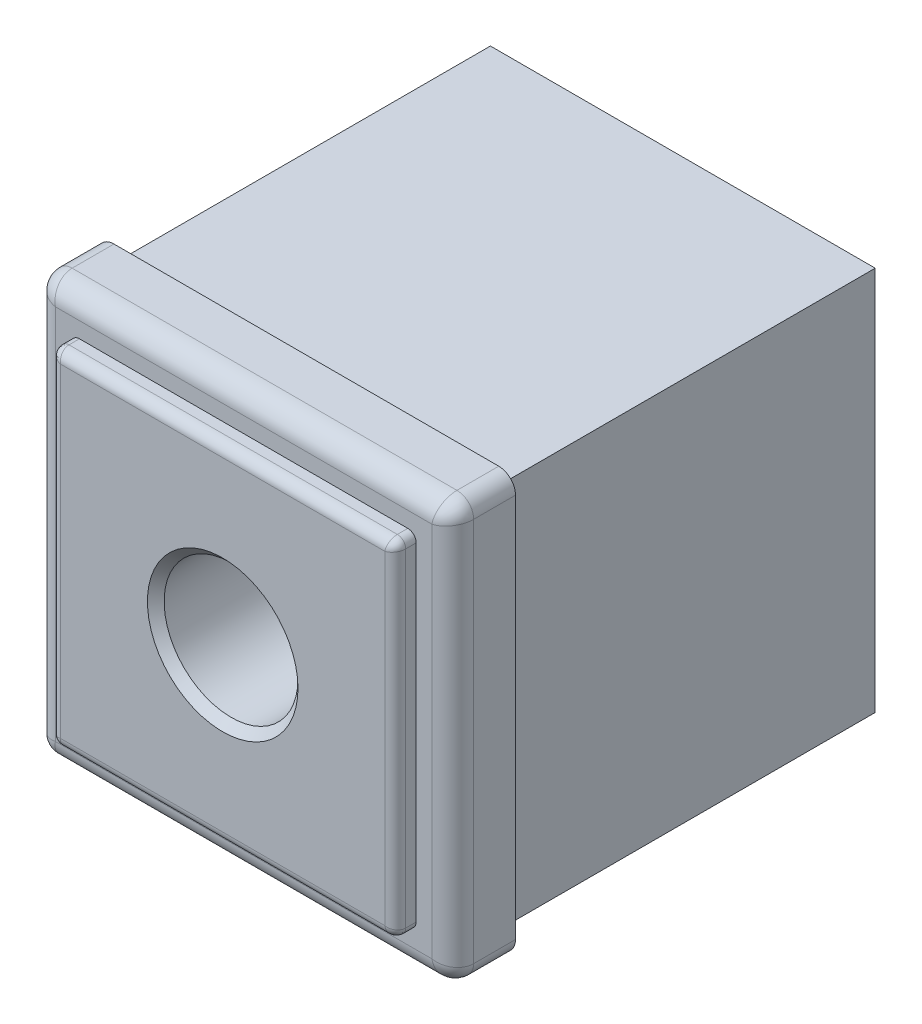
ISO-10303-21;
HEADER;
FILE_DESCRIPTION(('STEP AP214'),'2;1');
FILE_NAME('part.step','',(''),(''),'','','');
FILE_SCHEMA(('AUTOMOTIVE_DESIGN { 1 0 10303 214 1 1 1 1 }'));
ENDSEC;
DATA;
#1=APPLICATION_CONTEXT('core data for automotive mechanical design processes');
#2=APPLICATION_PROTOCOL_DEFINITION('international standard','automotive_design',2000,#1);
#3=PRODUCT_CONTEXT('',#1,'mechanical');
#4=PRODUCT('Part','Part','',(#3));
#5=PRODUCT_RELATED_PRODUCT_CATEGORY('part','',(#4));
#6=PRODUCT_DEFINITION_FORMATION('','',#4);
#7=PRODUCT_DEFINITION_CONTEXT('part definition',#1,'design');
#8=PRODUCT_DEFINITION('design','',#6,#7);
#9=PRODUCT_DEFINITION_SHAPE('','',#8);
#10=(LENGTH_UNIT() NAMED_UNIT(*) SI_UNIT(.MILLI.,.METRE.));
#11=(NAMED_UNIT(*) PLANE_ANGLE_UNIT() SI_UNIT($,.RADIAN.));
#12=(NAMED_UNIT(*) SI_UNIT($,.STERADIAN.) SOLID_ANGLE_UNIT());
#13=UNCERTAINTY_MEASURE_WITH_UNIT(LENGTH_MEASURE(1.E-05),#10,'distance_accuracy_value','');
#14=(GEOMETRIC_REPRESENTATION_CONTEXT(3) GLOBAL_UNCERTAINTY_ASSIGNED_CONTEXT((#13)) GLOBAL_UNIT_ASSIGNED_CONTEXT((#10,
#11,#12)) REPRESENTATION_CONTEXT('',''));
#15=CARTESIAN_POINT('',(0.,0.,0.));
#16=DIRECTION('',(0.,0.,1.));
#17=DIRECTION('',(1.,0.,0.));
#18=AXIS2_PLACEMENT_3D('',#15,#16,#17);
#19=CARTESIAN_POINT('',(25.,25.,0.));
#20=DIRECTION('',(0.,0.,1.));
#21=DIRECTION('',(1.,0.,0.));
#22=AXIS2_PLACEMENT_3D('',#19,#20,#21);
#23=PLANE('',#22);
#24=DIRECTION('',(-1.,0.,0.));
#25=VECTOR('',#24,1.);
#26=CARTESIAN_POINT('',(-25.,25.,0.));
#27=LINE('',#26,#25);
#28=CARTESIAN_POINT('',(23.,25.,0.));
#29=VERTEX_POINT('',#28);
#30=CARTESIAN_POINT('',(-23.,25.,0.));
#31=VERTEX_POINT('',#30);
#32=EDGE_CURVE('E345',#29,#31,#27,.T.);
#33=ORIENTED_EDGE('',*,*,#32,.F.);
#34=CARTESIAN_POINT('',(23.,23.,0.));
#35=DIRECTION('',(0.,0.,1.));
#36=DIRECTION('',(1.,0.,0.));
#37=AXIS2_PLACEMENT_3D('',#34,#35,#36);
#38=CIRCLE('',#37,2.);
#39=CARTESIAN_POINT('',(25.,23.,0.));
#40=VERTEX_POINT('',#39);
#41=EDGE_CURVE('E365',#29,#40,#38,.F.);
#42=ORIENTED_EDGE('',*,*,#41,.T.);
#43=DIRECTION('',(0.,1.,0.));
#44=VECTOR('',#43,1.);
#45=CARTESIAN_POINT('',(25.,25.,0.));
#46=LINE('',#45,#44);
#47=CARTESIAN_POINT('',(25.,-23.,0.));
#48=VERTEX_POINT('',#47);
#49=EDGE_CURVE('E342',#48,#40,#46,.T.);
#50=ORIENTED_EDGE('',*,*,#49,.F.);
#51=CARTESIAN_POINT('',(23.,-23.,0.));
#52=DIRECTION('',(0.,0.,1.));
#53=DIRECTION('',(1.,0.,0.));
#54=AXIS2_PLACEMENT_3D('',#51,#52,#53);
#55=CIRCLE('',#54,2.);
#56=CARTESIAN_POINT('',(23.,-25.,0.));
#57=VERTEX_POINT('',#56);
#58=EDGE_CURVE('E361',#48,#57,#55,.F.);
#59=ORIENTED_EDGE('',*,*,#58,.T.);
#60=DIRECTION('',(1.,0.,0.));
#61=VECTOR('',#60,1.);
#62=CARTESIAN_POINT('',(-25.,-25.,0.));
#63=LINE('',#62,#61);
#64=CARTESIAN_POINT('',(-23.,-25.,0.));
#65=VERTEX_POINT('',#64);
#66=EDGE_CURVE('E351',#65,#57,#63,.T.);
#67=ORIENTED_EDGE('',*,*,#66,.F.);
#68=CARTESIAN_POINT('',(-23.,-23.,0.));
#69=DIRECTION('',(0.,0.,1.));
#70=DIRECTION('',(1.,0.,0.));
#71=AXIS2_PLACEMENT_3D('',#68,#69,#70);
#72=CIRCLE('',#71,2.);
#73=CARTESIAN_POINT('',(-25.,-23.,0.));
#74=VERTEX_POINT('',#73);
#75=EDGE_CURVE('E359',#65,#74,#72,.F.);
#76=ORIENTED_EDGE('',*,*,#75,.T.);
#77=DIRECTION('',(0.,-1.,0.));
#78=VECTOR('',#77,1.);
#79=CARTESIAN_POINT('',(-25.,25.,0.));
#80=LINE('',#79,#78);
#81=CARTESIAN_POINT('',(-25.,23.,0.));
#82=VERTEX_POINT('',#81);
#83=EDGE_CURVE('E348',#82,#74,#80,.T.);
#84=ORIENTED_EDGE('',*,*,#83,.F.);
#85=CARTESIAN_POINT('',(-23.,23.,0.));
#86=DIRECTION('',(0.,0.,1.));
#87=DIRECTION('',(1.,0.,0.));
#88=AXIS2_PLACEMENT_3D('',#85,#86,#87);
#89=CIRCLE('',#88,2.);
#90=EDGE_CURVE('E363',#82,#31,#89,.F.);
#91=ORIENTED_EDGE('',*,*,#90,.T.);
#92=EDGE_LOOP('',(#33,#42,#50,#59,#67,#76,#84,#91));
#93=FACE_BOUND('',#92,.T.);
#94=DIRECTION('',(-1.,0.,0.));
#95=VECTOR('',#94,1.);
#96=CARTESIAN_POINT('',(23.,-23.,0.));
#97=LINE('',#96,#95);
#98=CARTESIAN_POINT('',(23.,-23.,0.));
#99=VERTEX_POINT('',#98);
#100=CARTESIAN_POINT('',(-23.,-23.,0.));
#101=VERTEX_POINT('',#100);
#102=EDGE_CURVE('E184',#99,#101,#97,.T.);
#103=ORIENTED_EDGE('',*,*,#102,.F.);
#104=DIRECTION('',(0.,-1.,0.));
#105=VECTOR('',#104,1.);
#106=CARTESIAN_POINT('',(23.,23.,0.));
#107=LINE('',#106,#105);
#108=CARTESIAN_POINT('',(23.,23.,0.));
#109=VERTEX_POINT('',#108);
#110=EDGE_CURVE('E204',#109,#99,#107,.T.);
#111=ORIENTED_EDGE('',*,*,#110,.F.);
#112=DIRECTION('',(1.,0.,0.));
#113=VECTOR('',#112,1.);
#114=CARTESIAN_POINT('',(-23.,23.,0.));
#115=LINE('',#114,#113);
#116=CARTESIAN_POINT('',(-23.,23.,0.));
#117=VERTEX_POINT('',#116);
#118=EDGE_CURVE('E34',#117,#109,#115,.T.);
#119=ORIENTED_EDGE('',*,*,#118,.F.);
#120=DIRECTION('',(0.,1.,0.));
#121=VECTOR('',#120,1.);
#122=CARTESIAN_POINT('',(-23.,-23.,0.));
#123=LINE('',#122,#121);
#124=EDGE_CURVE('E29',#101,#117,#123,.T.);
#125=ORIENTED_EDGE('',*,*,#124,.F.);
#126=EDGE_LOOP('',(#103,#111,#119,#125));
#127=FACE_BOUND('',#126,.T.);
#128=ADVANCED_FACE('F14',(#93,#127),#23,.F.);
#129=CARTESIAN_POINT('',(-22.75,22.75,-45.));
#130=DIRECTION('',(0.,0.,1.));
#131=DIRECTION('',(1.,0.,0.));
#132=AXIS2_PLACEMENT_3D('',#129,#130,#131);
#133=PLANE('',#132);
#134=CARTESIAN_POINT('',(0.,0.,-45.));
#135=DIRECTION('',(0.,0.,1.));
#136=DIRECTION('',(1.,0.,0.));
#137=AXIS2_PLACEMENT_3D('',#134,#135,#136);
#138=CIRCLE('',#137,8.);
#139=CARTESIAN_POINT('',(8.,0.,-45.));
#140=VERTEX_POINT('',#139);
#141=EDGE_CURVE('E200',#140,#140,#138,.T.);
#142=ORIENTED_EDGE('',*,*,#141,.T.);
#143=EDGE_LOOP('',(#142));
#144=FACE_BOUND('',#143,.T.);
#145=DIRECTION('',(0.,-1.,0.));
#146=VECTOR('',#145,1.);
#147=CARTESIAN_POINT('',(-23.,-23.,-45.));
#148=LINE('',#147,#146);
#149=CARTESIAN_POINT('',(-23.,23.,-45.));
#150=VERTEX_POINT('',#149);
#151=CARTESIAN_POINT('',(-23.,-23.,-45.));
#152=VERTEX_POINT('',#151);
#153=EDGE_CURVE('E173',#150,#152,#148,.T.);
#154=ORIENTED_EDGE('',*,*,#153,.F.);
#155=DIRECTION('',(-1.,0.,0.));
#156=VECTOR('',#155,1.);
#157=CARTESIAN_POINT('',(-23.,23.,-45.));
#158=LINE('',#157,#156);
#159=CARTESIAN_POINT('',(23.,23.,-45.));
#160=VERTEX_POINT('',#159);
#161=EDGE_CURVE('E177',#160,#150,#158,.T.);
#162=ORIENTED_EDGE('',*,*,#161,.F.);
#163=DIRECTION('',(0.,1.,0.));
#164=VECTOR('',#163,1.);
#165=CARTESIAN_POINT('',(23.,23.,-45.));
#166=LINE('',#165,#164);
#167=CARTESIAN_POINT('',(23.,-23.,-45.));
#168=VERTEX_POINT('',#167);
#169=EDGE_CURVE('E198',#168,#160,#166,.T.);
#170=ORIENTED_EDGE('',*,*,#169,.F.);
#171=DIRECTION('',(1.,0.,0.));
#172=VECTOR('',#171,1.);
#173=CARTESIAN_POINT('',(23.,-23.,-45.));
#174=LINE('',#173,#172);
#175=EDGE_CURVE('E180',#152,#168,#174,.T.);
#176=ORIENTED_EDGE('',*,*,#175,.F.);
#177=EDGE_LOOP('',(#154,#162,#170,#176));
#178=FACE_BOUND('',#177,.T.);
#179=ADVANCED_FACE('F175',(#144,#178),#133,.F.);
#180=CARTESIAN_POINT('',(25.,25.,7.5));
#181=DIRECTION('',(0.,0.,1.));
#182=DIRECTION('',(1.,0.,0.));
#183=AXIS2_PLACEMENT_3D('',#180,#181,#182);
#184=PLANE('',#183);
#185=DIRECTION('',(0.,1.,0.));
#186=VECTOR('',#185,1.);
#187=CARTESIAN_POINT('',(22.5,23.,7.5));
#188=LINE('',#187,#186);
#189=CARTESIAN_POINT('',(22.5,-22.5,7.5));
#190=VERTEX_POINT('',#189);
#191=CARTESIAN_POINT('',(22.5,22.5,7.5));
#192=VERTEX_POINT('',#191);
#193=EDGE_CURVE('E412',#190,#192,#188,.T.);
#194=ORIENTED_EDGE('',*,*,#193,.T.);
#195=DIRECTION('',(-1.,0.,0.));
#196=VECTOR('',#195,1.);
#197=CARTESIAN_POINT('',(-23.,22.5,7.5));
#198=LINE('',#197,#196);
#199=CARTESIAN_POINT('',(-22.5,22.5,7.5));
#200=VERTEX_POINT('',#199);
#201=EDGE_CURVE('E416',#192,#200,#198,.T.);
#202=ORIENTED_EDGE('',*,*,#201,.T.);
#203=DIRECTION('',(0.,-1.,0.));
#204=VECTOR('',#203,1.);
#205=CARTESIAN_POINT('',(-22.5,-23.,7.5));
#206=LINE('',#205,#204);
#207=CARTESIAN_POINT('',(-22.5,-22.5,7.5));
#208=VERTEX_POINT('',#207);
#209=EDGE_CURVE('E414',#200,#208,#206,.T.);
#210=ORIENTED_EDGE('',*,*,#209,.T.);
#211=DIRECTION('',(1.,0.,0.));
#212=VECTOR('',#211,1.);
#213=CARTESIAN_POINT('',(23.,-22.5,7.5));
#214=LINE('',#213,#212);
#215=EDGE_CURVE('E410',#208,#190,#214,.T.);
#216=ORIENTED_EDGE('',*,*,#215,.T.);
#217=EDGE_LOOP('',(#194,#202,#210,#216));
#218=FACE_BOUND('',#217,.T.);
#219=DIRECTION('',(1.,0.,0.));
#220=VECTOR('',#219,1.);
#221=CARTESIAN_POINT('',(-20.625,-20.625,7.5));
#222=LINE('',#221,#220);
#223=CARTESIAN_POINT('',(-19.625,-20.625,7.5));
#224=VERTEX_POINT('',#223);
#225=CARTESIAN_POINT('',(19.625,-20.625,7.5));
#226=VERTEX_POINT('',#225);
#227=EDGE_CURVE('E333',#224,#226,#222,.T.);
#228=ORIENTED_EDGE('',*,*,#227,.F.);
#229=CARTESIAN_POINT('',(-19.625,-19.625,7.5));
#230=DIRECTION('',(0.,0.,1.));
#231=DIRECTION('',(1.,0.,0.));
#232=AXIS2_PLACEMENT_3D('',#229,#230,#231);
#233=CIRCLE('',#232,1.);
#234=CARTESIAN_POINT('',(-20.625,-19.625,7.5));
#235=VERTEX_POINT('',#234);
#236=EDGE_CURVE('E406',#224,#235,#233,.F.);
#237=ORIENTED_EDGE('',*,*,#236,.T.);
#238=DIRECTION('',(0.,-1.,0.));
#239=VECTOR('',#238,1.);
#240=CARTESIAN_POINT('',(-20.625,20.625,7.5));
#241=LINE('',#240,#239);
#242=CARTESIAN_POINT('',(-20.625,19.625,7.5));
#243=VERTEX_POINT('',#242);
#244=EDGE_CURVE('E330',#243,#235,#241,.T.);
#245=ORIENTED_EDGE('',*,*,#244,.F.);
#246=CARTESIAN_POINT('',(-19.625,19.625,7.5));
#247=DIRECTION('',(0.,0.,1.));
#248=DIRECTION('',(1.,0.,0.));
#249=AXIS2_PLACEMENT_3D('',#246,#247,#248);
#250=CIRCLE('',#249,1.);
#251=CARTESIAN_POINT('',(-19.625,20.625,7.5));
#252=VERTEX_POINT('',#251);
#253=EDGE_CURVE('E402',#243,#252,#250,.F.);
#254=ORIENTED_EDGE('',*,*,#253,.T.);
#255=DIRECTION('',(-1.,0.,0.));
#256=VECTOR('',#255,1.);
#257=CARTESIAN_POINT('',(-20.625,20.625,7.5));
#258=LINE('',#257,#256);
#259=CARTESIAN_POINT('',(19.625,20.625,7.5));
#260=VERTEX_POINT('',#259);
#261=EDGE_CURVE('E339',#260,#252,#258,.T.);
#262=ORIENTED_EDGE('',*,*,#261,.F.);
#263=CARTESIAN_POINT('',(19.625,19.625,7.5));
#264=DIRECTION('',(0.,0.,1.));
#265=DIRECTION('',(1.,0.,0.));
#266=AXIS2_PLACEMENT_3D('',#263,#264,#265);
#267=CIRCLE('',#266,1.);
#268=CARTESIAN_POINT('',(20.625,19.625,7.5));
#269=VERTEX_POINT('',#268);
#270=EDGE_CURVE('E404',#260,#269,#267,.F.);
#271=ORIENTED_EDGE('',*,*,#270,.T.);
#272=DIRECTION('',(0.,1.,0.));
#273=VECTOR('',#272,1.);
#274=CARTESIAN_POINT('',(20.625,20.625,7.5));
#275=LINE('',#274,#273);
#276=CARTESIAN_POINT('',(20.625,-19.625,7.5));
#277=VERTEX_POINT('',#276);
#278=EDGE_CURVE('E336',#277,#269,#275,.T.);
#279=ORIENTED_EDGE('',*,*,#278,.F.);
#280=CARTESIAN_POINT('',(19.625,-19.625,7.5));
#281=DIRECTION('',(0.,0.,1.));
#282=DIRECTION('',(1.,0.,0.));
#283=AXIS2_PLACEMENT_3D('',#280,#281,#282);
#284=CIRCLE('',#283,1.);
#285=EDGE_CURVE('E408',#277,#226,#284,.F.);
#286=ORIENTED_EDGE('',*,*,#285,.T.);
#287=EDGE_LOOP('',(#228,#237,#245,#254,#262,#271,#279,#286));
#288=FACE_BOUND('',#287,.T.);
#289=ADVANCED_FACE('F486',(#218,#288),#184,.T.);
#290=CARTESIAN_POINT('',(25.,25.,7.5));
#291=DIRECTION('',(-1.,0.,0.));
#292=DIRECTION('',(0.,-1.,0.));
#293=AXIS2_PLACEMENT_3D('',#290,#291,#292);
#294=PLANE('',#293);
#295=DIRECTION('',(0.,0.,-1.));
#296=VECTOR('',#295,1.);
#297=CARTESIAN_POINT('',(25.,23.,7.5));
#298=LINE('',#297,#296);
#299=CARTESIAN_POINT('',(25.,23.,5.));
#300=VERTEX_POINT('',#299);
#301=EDGE_CURVE('E369',#40,#300,#298,.F.);
#302=ORIENTED_EDGE('',*,*,#301,.T.);
#303=DIRECTION('',(0.,1.,0.));
#304=VECTOR('',#303,1.);
#305=CARTESIAN_POINT('',(25.,-23.,5.));
#306=LINE('',#305,#304);
#307=CARTESIAN_POINT('',(25.,-23.,5.));
#308=VERTEX_POINT('',#307);
#309=EDGE_CURVE('E428',#300,#308,#306,.F.);
#310=ORIENTED_EDGE('',*,*,#309,.T.);
#311=DIRECTION('',(0.,0.,-1.));
#312=VECTOR('',#311,1.);
#313=CARTESIAN_POINT('',(25.,-23.,7.5));
#314=LINE('',#313,#312);
#315=EDGE_CURVE('E367',#308,#48,#314,.T.);
#316=ORIENTED_EDGE('',*,*,#315,.T.);
#317=ORIENTED_EDGE('',*,*,#49,.T.);
#318=EDGE_LOOP('',(#302,#310,#316,#317));
#319=FACE_BOUND('',#318,.T.);
#320=ADVANCED_FACE('F495',(#319),#294,.F.);
#321=CARTESIAN_POINT('',(-25.,25.,7.5));
#322=DIRECTION('',(0.,-1.,0.));
#323=DIRECTION('',(0.,0.,-1.));
#324=AXIS2_PLACEMENT_3D('',#321,#322,#323);
#325=PLANE('',#324);
#326=DIRECTION('',(0.,0.,-1.));
#327=VECTOR('',#326,1.);
#328=CARTESIAN_POINT('',(-23.,25.,7.5));
#329=LINE('',#328,#327);
#330=CARTESIAN_POINT('',(-23.,25.,5.));
#331=VERTEX_POINT('',#330);
#332=EDGE_CURVE('E354',#31,#331,#329,.F.);
#333=ORIENTED_EDGE('',*,*,#332,.T.);
#334=DIRECTION('',(-1.,0.,0.));
#335=VECTOR('',#334,1.);
#336=CARTESIAN_POINT('',(23.,25.,5.));
#337=LINE('',#336,#335);
#338=CARTESIAN_POINT('',(23.,25.,5.));
#339=VERTEX_POINT('',#338);
#340=EDGE_CURVE('E419',#331,#339,#337,.F.);
#341=ORIENTED_EDGE('',*,*,#340,.T.);
#342=DIRECTION('',(0.,0.,-1.));
#343=VECTOR('',#342,1.);
#344=CARTESIAN_POINT('',(23.,25.,7.5));
#345=LINE('',#344,#343);
#346=EDGE_CURVE('E357',#339,#29,#345,.T.);
#347=ORIENTED_EDGE('',*,*,#346,.T.);
#348=ORIENTED_EDGE('',*,*,#32,.T.);
#349=EDGE_LOOP('',(#333,#341,#347,#348));
#350=FACE_BOUND('',#349,.T.);
#351=ADVANCED_FACE('F504',(#350),#325,.F.);
#352=CARTESIAN_POINT('',(-25.,25.,7.5));
#353=DIRECTION('',(1.,0.,0.));
#354=DIRECTION('',(0.,1.,0.));
#355=AXIS2_PLACEMENT_3D('',#352,#353,#354);
#356=PLANE('',#355);
#357=DIRECTION('',(0.,0.,-1.));
#358=VECTOR('',#357,1.);
#359=CARTESIAN_POINT('',(-25.,-23.,7.5));
#360=LINE('',#359,#358);
#361=CARTESIAN_POINT('',(-25.,-23.,5.));
#362=VERTEX_POINT('',#361);
#363=EDGE_CURVE('E372',#74,#362,#360,.F.);
#364=ORIENTED_EDGE('',*,*,#363,.T.);
#365=DIRECTION('',(0.,-1.,0.));
#366=VECTOR('',#365,1.);
#367=CARTESIAN_POINT('',(-25.,23.,5.));
#368=LINE('',#367,#366);
#369=CARTESIAN_POINT('',(-25.,23.,5.));
#370=VERTEX_POINT('',#369);
#371=EDGE_CURVE('E426',#362,#370,#368,.F.);
#372=ORIENTED_EDGE('',*,*,#371,.T.);
#373=DIRECTION('',(0.,0.,-1.));
#374=VECTOR('',#373,1.);
#375=CARTESIAN_POINT('',(-25.,23.,7.5));
#376=LINE('',#375,#374);
#377=EDGE_CURVE('E375',#370,#82,#376,.T.);
#378=ORIENTED_EDGE('',*,*,#377,.T.);
#379=ORIENTED_EDGE('',*,*,#83,.T.);
#380=EDGE_LOOP('',(#364,#372,#378,#379));
#381=FACE_BOUND('',#380,.T.);
#382=ADVANCED_FACE('F500',(#381),#356,.F.);
#383=CARTESIAN_POINT('',(-25.,-25.,7.5));
#384=DIRECTION('',(0.,1.,0.));
#385=DIRECTION('',(-1.,0.,0.));
#386=AXIS2_PLACEMENT_3D('',#383,#384,#385);
#387=PLANE('',#386);
#388=DIRECTION('',(0.,0.,-1.));
#389=VECTOR('',#388,1.);
#390=CARTESIAN_POINT('',(23.,-25.,7.5));
#391=LINE('',#390,#389);
#392=CARTESIAN_POINT('',(23.,-25.,5.));
#393=VERTEX_POINT('',#392);
#394=EDGE_CURVE('E379',#57,#393,#391,.F.);
#395=ORIENTED_EDGE('',*,*,#394,.T.);
#396=DIRECTION('',(1.,0.,0.));
#397=VECTOR('',#396,1.);
#398=CARTESIAN_POINT('',(-23.,-25.,5.));
#399=LINE('',#398,#397);
#400=CARTESIAN_POINT('',(-23.,-25.,5.));
#401=VERTEX_POINT('',#400);
#402=EDGE_CURVE('E434',#393,#401,#399,.F.);
#403=ORIENTED_EDGE('',*,*,#402,.T.);
#404=DIRECTION('',(0.,0.,-1.));
#405=VECTOR('',#404,1.);
#406=CARTESIAN_POINT('',(-23.,-25.,7.5));
#407=LINE('',#406,#405);
#408=EDGE_CURVE('E377',#401,#65,#407,.T.);
#409=ORIENTED_EDGE('',*,*,#408,.T.);
#410=ORIENTED_EDGE('',*,*,#66,.T.);
#411=EDGE_LOOP('',(#395,#403,#409,#410));
#412=FACE_BOUND('',#411,.T.);
#413=ADVANCED_FACE('F497',(#412),#387,.F.);
#414=CARTESIAN_POINT('',(-20.625,20.625,10.));
#415=DIRECTION('',(1.,0.,0.));
#416=DIRECTION('',(0.,0.,-1.));
#417=AXIS2_PLACEMENT_3D('',#414,#415,#416);
#418=PLANE('',#417);
#419=DIRECTION('',(0.,0.,-1.));
#420=VECTOR('',#419,1.);
#421=CARTESIAN_POINT('',(-20.625,-19.625,10.));
#422=LINE('',#421,#420);
#423=CARTESIAN_POINT('',(-20.625,-19.625,8.75));
#424=VERTEX_POINT('',#423);
#425=EDGE_CURVE('E382',#235,#424,#422,.F.);
#426=ORIENTED_EDGE('',*,*,#425,.T.);
#427=DIRECTION('',(0.,-1.,0.));
#428=VECTOR('',#427,1.);
#429=CARTESIAN_POINT('',(-20.625,19.625,8.75));
#430=LINE('',#429,#428);
#431=CARTESIAN_POINT('',(-20.625,19.625,8.75));
#432=VERTEX_POINT('',#431);
#433=EDGE_CURVE('E445',#424,#432,#430,.F.);
#434=ORIENTED_EDGE('',*,*,#433,.T.);
#435=DIRECTION('',(0.,0.,-1.));
#436=VECTOR('',#435,1.);
#437=CARTESIAN_POINT('',(-20.625,19.625,10.));
#438=LINE('',#437,#436);
#439=EDGE_CURVE('E385',#432,#243,#438,.T.);
#440=ORIENTED_EDGE('',*,*,#439,.T.);
#441=ORIENTED_EDGE('',*,*,#244,.T.);
#442=EDGE_LOOP('',(#426,#434,#440,#441));
#443=FACE_BOUND('',#442,.T.);
#444=ADVANCED_FACE('F491',(#443),#418,.F.);
#445=CARTESIAN_POINT('',(-20.625,-20.625,10.));
#446=DIRECTION('',(0.,1.,0.));
#447=DIRECTION('',(-1.,0.,0.));
#448=AXIS2_PLACEMENT_3D('',#445,#446,#447);
#449=PLANE('',#448);
#450=DIRECTION('',(0.,0.,-1.));
#451=VECTOR('',#450,1.);
#452=CARTESIAN_POINT('',(19.625,-20.625,10.));
#453=LINE('',#452,#451);
#454=CARTESIAN_POINT('',(19.625,-20.625,8.75));
#455=VERTEX_POINT('',#454);
#456=EDGE_CURVE('E397',#226,#455,#453,.F.);
#457=ORIENTED_EDGE('',*,*,#456,.T.);
#458=DIRECTION('',(1.,0.,0.));
#459=VECTOR('',#458,1.);
#460=CARTESIAN_POINT('',(-19.625,-20.625,8.75));
#461=LINE('',#460,#459);
#462=CARTESIAN_POINT('',(-19.625,-20.625,8.75));
#463=VERTEX_POINT('',#462);
#464=EDGE_CURVE('E452',#455,#463,#461,.F.);
#465=ORIENTED_EDGE('',*,*,#464,.T.);
#466=DIRECTION('',(0.,0.,-1.));
#467=VECTOR('',#466,1.);
#468=CARTESIAN_POINT('',(-19.625,-20.625,10.));
#469=LINE('',#468,#467);
#470=EDGE_CURVE('E400',#463,#224,#469,.T.);
#471=ORIENTED_EDGE('',*,*,#470,.T.);
#472=ORIENTED_EDGE('',*,*,#227,.T.);
#473=EDGE_LOOP('',(#457,#465,#471,#472));
#474=FACE_BOUND('',#473,.T.);
#475=ADVANCED_FACE('F592',(#474),#449,.F.);
#476=CARTESIAN_POINT('',(20.625,20.625,10.));
#477=DIRECTION('',(-1.,0.,0.));
#478=DIRECTION('',(0.,-1.,0.));
#479=AXIS2_PLACEMENT_3D('',#476,#477,#478);
#480=PLANE('',#479);
#481=DIRECTION('',(0.,0.,-1.));
#482=VECTOR('',#481,1.);
#483=CARTESIAN_POINT('',(20.625,19.625,10.));
#484=LINE('',#483,#482);
#485=CARTESIAN_POINT('',(20.625,19.625,8.75));
#486=VERTEX_POINT('',#485);
#487=EDGE_CURVE('E394',#269,#486,#484,.F.);
#488=ORIENTED_EDGE('',*,*,#487,.T.);
#489=DIRECTION('',(0.,1.,0.));
#490=VECTOR('',#489,1.);
#491=CARTESIAN_POINT('',(20.625,-19.625,8.75));
#492=LINE('',#491,#490);
#493=CARTESIAN_POINT('',(20.625,-19.625,8.75));
#494=VERTEX_POINT('',#493);
#495=EDGE_CURVE('E460',#486,#494,#492,.F.);
#496=ORIENTED_EDGE('',*,*,#495,.T.);
#497=DIRECTION('',(0.,0.,-1.));
#498=VECTOR('',#497,1.);
#499=CARTESIAN_POINT('',(20.625,-19.625,10.));
#500=LINE('',#499,#498);
#501=EDGE_CURVE('E392',#494,#277,#500,.T.);
#502=ORIENTED_EDGE('',*,*,#501,.T.);
#503=ORIENTED_EDGE('',*,*,#278,.T.);
#504=EDGE_LOOP('',(#488,#496,#502,#503));
#505=FACE_BOUND('',#504,.T.);
#506=ADVANCED_FACE('F589',(#505),#480,.F.);
#507=CARTESIAN_POINT('',(-20.625,20.625,10.));
#508=DIRECTION('',(0.,-1.,0.));
#509=DIRECTION('',(1.,0.,0.));
#510=AXIS2_PLACEMENT_3D('',#507,#508,#509);
#511=PLANE('',#510);
#512=DIRECTION('',(0.,0.,-1.));
#513=VECTOR('',#512,1.);
#514=CARTESIAN_POINT('',(-19.625,20.625,10.));
#515=LINE('',#514,#513);
#516=CARTESIAN_POINT('',(-19.625,20.625,8.75));
#517=VERTEX_POINT('',#516);
#518=EDGE_CURVE('E389',#252,#517,#515,.F.);
#519=ORIENTED_EDGE('',*,*,#518,.T.);
#520=DIRECTION('',(-1.,0.,0.));
#521=VECTOR('',#520,1.);
#522=CARTESIAN_POINT('',(19.625,20.625,8.75));
#523=LINE('',#522,#521);
#524=CARTESIAN_POINT('',(19.625,20.625,8.75));
#525=VERTEX_POINT('',#524);
#526=EDGE_CURVE('E454',#517,#525,#523,.F.);
#527=ORIENTED_EDGE('',*,*,#526,.T.);
#528=DIRECTION('',(0.,0.,-1.));
#529=VECTOR('',#528,1.);
#530=CARTESIAN_POINT('',(19.625,20.625,10.));
#531=LINE('',#530,#529);
#532=EDGE_CURVE('E387',#525,#260,#531,.T.);
#533=ORIENTED_EDGE('',*,*,#532,.T.);
#534=ORIENTED_EDGE('',*,*,#261,.T.);
#535=EDGE_LOOP('',(#519,#527,#533,#534));
#536=FACE_BOUND('',#535,.T.);
#537=ADVANCED_FACE('F585',(#536),#511,.F.);
#538=CARTESIAN_POINT('',(-20.625,-20.625,10.));
#539=DIRECTION('',(0.,0.,1.));
#540=DIRECTION('',(1.,0.,0.));
#541=AXIS2_PLACEMENT_3D('',#538,#539,#540);
#542=PLANE('',#541);
#543=CARTESIAN_POINT('',(0.,0.,10.));
#544=DIRECTION('',(0.,0.,1.));
#545=DIRECTION('',(1.,0.,0.));
#546=AXIS2_PLACEMENT_3D('',#543,#544,#545);
#547=CIRCLE('',#546,9.);
#548=CARTESIAN_POINT('',(9.,0.,10.));
#549=VERTEX_POINT('',#548);
#550=EDGE_CURVE('E9',#549,#549,#547,.F.);
#551=ORIENTED_EDGE('',*,*,#550,.T.);
#552=EDGE_LOOP('',(#551));
#553=FACE_BOUND('',#552,.T.);
#554=DIRECTION('',(-1.,0.,0.));
#555=VECTOR('',#554,1.);
#556=CARTESIAN_POINT('',(-19.625,19.375,10.));
#557=LINE('',#556,#555);
#558=CARTESIAN_POINT('',(19.375,19.375,10.));
#559=VERTEX_POINT('',#558);
#560=CARTESIAN_POINT('',(-19.375,19.375,10.));
#561=VERTEX_POINT('',#560);
#562=EDGE_CURVE('E438',#559,#561,#557,.T.);
#563=ORIENTED_EDGE('',*,*,#562,.T.);
#564=DIRECTION('',(0.,-1.,0.));
#565=VECTOR('',#564,1.);
#566=CARTESIAN_POINT('',(-19.375,-19.625,10.));
#567=LINE('',#566,#565);
#568=CARTESIAN_POINT('',(-19.375,-19.375,10.));
#569=VERTEX_POINT('',#568);
#570=EDGE_CURVE('E442',#561,#569,#567,.T.);
#571=ORIENTED_EDGE('',*,*,#570,.T.);
#572=DIRECTION('',(1.,0.,0.));
#573=VECTOR('',#572,1.);
#574=CARTESIAN_POINT('',(19.625,-19.375,10.));
#575=LINE('',#574,#573);
#576=CARTESIAN_POINT('',(19.375,-19.375,10.));
#577=VERTEX_POINT('',#576);
#578=EDGE_CURVE('E440',#569,#577,#575,.T.);
#579=ORIENTED_EDGE('',*,*,#578,.T.);
#580=DIRECTION('',(0.,1.,0.));
#581=VECTOR('',#580,1.);
#582=CARTESIAN_POINT('',(19.375,19.625,10.));
#583=LINE('',#582,#581);
#584=EDGE_CURVE('E436',#577,#559,#583,.T.);
#585=ORIENTED_EDGE('',*,*,#584,.T.);
#586=EDGE_LOOP('',(#563,#571,#579,#585));
#587=FACE_BOUND('',#586,.T.);
#588=ADVANCED_FACE('F582',(#553,#587),#542,.T.);
#589=CARTESIAN_POINT('',(23.,23.,7.5));
#590=DIRECTION('',(0.,0.,-1.));
#591=DIRECTION('',(-1.,0.,0.));
#592=AXIS2_PLACEMENT_3D('',#589,#590,#591);
#593=CYLINDRICAL_SURFACE('',#592,2.);
#594=ORIENTED_EDGE('',*,*,#346,.F.);
#595=CARTESIAN_POINT('',(23.,23.,5.));
#596=DIRECTION('',(0.,0.,-1.));
#597=DIRECTION('',(-1.,0.,0.));
#598=AXIS2_PLACEMENT_3D('',#595,#596,#597);
#599=CIRCLE('',#598,2.);
#600=EDGE_CURVE('E424',#339,#300,#599,.T.);
#601=ORIENTED_EDGE('',*,*,#600,.T.);
#602=ORIENTED_EDGE('',*,*,#301,.F.);
#603=ORIENTED_EDGE('',*,*,#41,.F.);
#604=EDGE_LOOP('',(#594,#601,#602,#603));
#605=FACE_BOUND('',#604,.T.);
#606=ADVANCED_FACE('F576',(#605),#593,.T.);
#607=CARTESIAN_POINT('',(-23.,23.,7.5));
#608=DIRECTION('',(0.,0.,-1.));
#609=DIRECTION('',(-1.,0.,0.));
#610=AXIS2_PLACEMENT_3D('',#607,#608,#609);
#611=CYLINDRICAL_SURFACE('',#610,2.);
#612=ORIENTED_EDGE('',*,*,#377,.F.);
#613=CARTESIAN_POINT('',(-23.,23.,5.));
#614=DIRECTION('',(0.,0.,-1.));
#615=DIRECTION('',(-1.,0.,0.));
#616=AXIS2_PLACEMENT_3D('',#613,#614,#615);
#617=CIRCLE('',#616,2.);
#618=EDGE_CURVE('E422',#370,#331,#617,.T.);
#619=ORIENTED_EDGE('',*,*,#618,.T.);
#620=ORIENTED_EDGE('',*,*,#332,.F.);
#621=ORIENTED_EDGE('',*,*,#90,.F.);
#622=EDGE_LOOP('',(#612,#619,#620,#621));
#623=FACE_BOUND('',#622,.T.);
#624=ADVANCED_FACE('F542',(#623),#611,.T.);
#625=CARTESIAN_POINT('',(23.,-23.,7.5));
#626=DIRECTION('',(0.,0.,-1.));
#627=DIRECTION('',(-1.,0.,0.));
#628=AXIS2_PLACEMENT_3D('',#625,#626,#627);
#629=CYLINDRICAL_SURFACE('',#628,2.);
#630=ORIENTED_EDGE('',*,*,#315,.F.);
#631=CARTESIAN_POINT('',(23.,-23.,5.));
#632=DIRECTION('',(0.,0.,-1.));
#633=DIRECTION('',(-1.,0.,0.));
#634=AXIS2_PLACEMENT_3D('',#631,#632,#633);
#635=CIRCLE('',#634,2.);
#636=EDGE_CURVE('E432',#308,#393,#635,.T.);
#637=ORIENTED_EDGE('',*,*,#636,.T.);
#638=ORIENTED_EDGE('',*,*,#394,.F.);
#639=ORIENTED_EDGE('',*,*,#58,.F.);
#640=EDGE_LOOP('',(#630,#637,#638,#639));
#641=FACE_BOUND('',#640,.T.);
#642=ADVANCED_FACE('F565',(#641),#629,.T.);
#643=CARTESIAN_POINT('',(-23.,-23.,7.5));
#644=DIRECTION('',(0.,0.,-1.));
#645=DIRECTION('',(-1.,0.,0.));
#646=AXIS2_PLACEMENT_3D('',#643,#644,#645);
#647=CYLINDRICAL_SURFACE('',#646,2.);
#648=ORIENTED_EDGE('',*,*,#408,.F.);
#649=CARTESIAN_POINT('',(-23.,-23.,5.));
#650=DIRECTION('',(0.,0.,-1.));
#651=DIRECTION('',(-1.,0.,0.));
#652=AXIS2_PLACEMENT_3D('',#649,#650,#651);
#653=CIRCLE('',#652,2.);
#654=EDGE_CURVE('E430',#401,#362,#653,.T.);
#655=ORIENTED_EDGE('',*,*,#654,.T.);
#656=ORIENTED_EDGE('',*,*,#363,.F.);
#657=ORIENTED_EDGE('',*,*,#75,.F.);
#658=EDGE_LOOP('',(#648,#655,#656,#657));
#659=FACE_BOUND('',#658,.T.);
#660=ADVANCED_FACE('F552',(#659),#647,.T.);
#661=CARTESIAN_POINT('',(-19.625,19.625,10.));
#662=DIRECTION('',(0.,0.,-1.));
#663=DIRECTION('',(-1.,0.,0.));
#664=AXIS2_PLACEMENT_3D('',#661,#662,#663);
#665=CYLINDRICAL_SURFACE('',#664,1.);
#666=ORIENTED_EDGE('',*,*,#439,.F.);
#667=CARTESIAN_POINT('',(-19.625,19.625,8.75));
#668=DIRECTION('',(0.,0.,-1.));
#669=DIRECTION('',(-1.,0.,0.));
#670=AXIS2_PLACEMENT_3D('',#667,#668,#669);
#671=CIRCLE('',#670,1.);
#672=EDGE_CURVE('E450',#432,#517,#671,.T.);
#673=ORIENTED_EDGE('',*,*,#672,.T.);
#674=ORIENTED_EDGE('',*,*,#518,.F.);
#675=ORIENTED_EDGE('',*,*,#253,.F.);
#676=EDGE_LOOP('',(#666,#673,#674,#675));
#677=FACE_BOUND('',#676,.T.);
#678=ADVANCED_FACE('F574',(#677),#665,.T.);
#679=CARTESIAN_POINT('',(19.625,19.625,10.));
#680=DIRECTION('',(0.,0.,-1.));
#681=DIRECTION('',(-1.,0.,0.));
#682=AXIS2_PLACEMENT_3D('',#679,#680,#681);
#683=CYLINDRICAL_SURFACE('',#682,1.);
#684=ORIENTED_EDGE('',*,*,#532,.F.);
#685=CARTESIAN_POINT('',(19.625,19.625,8.75));
#686=DIRECTION('',(0.,0.,-1.));
#687=DIRECTION('',(-1.,0.,0.));
#688=AXIS2_PLACEMENT_3D('',#685,#686,#687);
#689=CIRCLE('',#688,1.);
#690=EDGE_CURVE('E458',#525,#486,#689,.T.);
#691=ORIENTED_EDGE('',*,*,#690,.T.);
#692=ORIENTED_EDGE('',*,*,#487,.F.);
#693=ORIENTED_EDGE('',*,*,#270,.F.);
#694=EDGE_LOOP('',(#684,#691,#692,#693));
#695=FACE_BOUND('',#694,.T.);
#696=ADVANCED_FACE('F648',(#695),#683,.T.);
#697=CARTESIAN_POINT('',(-19.625,-19.625,10.));
#698=DIRECTION('',(0.,0.,-1.));
#699=DIRECTION('',(-1.,0.,0.));
#700=AXIS2_PLACEMENT_3D('',#697,#698,#699);
#701=CYLINDRICAL_SURFACE('',#700,1.);
#702=ORIENTED_EDGE('',*,*,#470,.F.);
#703=CARTESIAN_POINT('',(-19.625,-19.625,8.75));
#704=DIRECTION('',(0.,0.,-1.));
#705=DIRECTION('',(-1.,0.,0.));
#706=AXIS2_PLACEMENT_3D('',#703,#704,#705);
#707=CIRCLE('',#706,1.);
#708=EDGE_CURVE('E448',#463,#424,#707,.T.);
#709=ORIENTED_EDGE('',*,*,#708,.T.);
#710=ORIENTED_EDGE('',*,*,#425,.F.);
#711=ORIENTED_EDGE('',*,*,#236,.F.);
#712=EDGE_LOOP('',(#702,#709,#710,#711));
#713=FACE_BOUND('',#712,.T.);
#714=ADVANCED_FACE('F621',(#713),#701,.T.);
#715=CARTESIAN_POINT('',(19.625,-19.625,10.));
#716=DIRECTION('',(0.,0.,-1.));
#717=DIRECTION('',(-1.,0.,0.));
#718=AXIS2_PLACEMENT_3D('',#715,#716,#717);
#719=CYLINDRICAL_SURFACE('',#718,1.);
#720=ORIENTED_EDGE('',*,*,#501,.F.);
#721=CARTESIAN_POINT('',(19.625,-19.625,8.75));
#722=DIRECTION('',(0.,0.,-1.));
#723=DIRECTION('',(-1.,0.,0.));
#724=AXIS2_PLACEMENT_3D('',#721,#722,#723);
#725=CIRCLE('',#724,1.);
#726=EDGE_CURVE('E456',#494,#455,#725,.T.);
#727=ORIENTED_EDGE('',*,*,#726,.T.);
#728=ORIENTED_EDGE('',*,*,#456,.F.);
#729=ORIENTED_EDGE('',*,*,#285,.F.);
#730=EDGE_LOOP('',(#720,#727,#728,#729));
#731=FACE_BOUND('',#730,.T.);
#732=ADVANCED_FACE('F319',(#731),#719,.T.);
#733=CARTESIAN_POINT('',(25.,-22.5,5.));
#734=DIRECTION('',(-1.,0.,0.));
#735=DIRECTION('',(0.,-1.,0.));
#736=AXIS2_PLACEMENT_3D('',#733,#734,#735);
#737=CYLINDRICAL_SURFACE('',#736,2.5);
#738=CARTESIAN_POINT('',(-22.5,-22.5,5.));
#739=DIRECTION('',(0.98058067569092,-0.196116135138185,0.));
#740=DIRECTION('',(-0.196116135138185,-0.98058067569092,0.));
#741=AXIS2_PLACEMENT_3D('',#738,#739,#740);
#742=ELLIPSE('',#741,2.54950975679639,2.5);
#743=EDGE_CURVE('E301',#401,#208,#742,.F.);
#744=ORIENTED_EDGE('',*,*,#743,.F.);
#745=ORIENTED_EDGE('',*,*,#402,.F.);
#746=CARTESIAN_POINT('',(22.5,-22.5,5.));
#747=DIRECTION('',(0.98058067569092,0.196116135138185,0.));
#748=DIRECTION('',(0.196116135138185,-0.98058067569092,0.));
#749=AXIS2_PLACEMENT_3D('',#746,#747,#748);
#750=ELLIPSE('',#749,2.54950975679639,2.5);
#751=EDGE_CURVE('E304',#190,#393,#750,.T.);
#752=ORIENTED_EDGE('',*,*,#751,.F.);
#753=ORIENTED_EDGE('',*,*,#215,.F.);
#754=EDGE_LOOP('',(#744,#745,#752,#753));
#755=FACE_BOUND('',#754,.T.);
#756=ADVANCED_FACE('F315',(#755),#737,.T.);
#757=CARTESIAN_POINT('',(22.5,-22.5,2.5));
#758=CARTESIAN_POINT('',(22.5,-22.5,2.5));
#759=CARTESIAN_POINT('',(22.5,-22.5,2.5));
#760=CARTESIAN_POINT('',(22.6089118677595,-22.5217823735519,2.50004381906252));
#761=CARTESIAN_POINT('',(22.5653589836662,-22.5653589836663,2.50009789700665));
#762=CARTESIAN_POINT('',(22.5217823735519,-22.6089118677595,2.50004381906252));
#763=CARTESIAN_POINT('',(22.717851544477,-22.5435703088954,2.50712060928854));
#764=CARTESIAN_POINT('',(22.6308997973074,-22.6308997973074,2.50143180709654));
#765=CARTESIAN_POINT('',(22.5435703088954,-22.7178515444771,2.50712060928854));
#766=CARTESIAN_POINT('',(22.9338574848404,-22.5867714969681,2.53553381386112));
#767=CARTESIAN_POINT('',(22.7627340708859,-22.7627340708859,2.50726267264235));
#768=CARTESIAN_POINT('',(22.5867714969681,-22.9338574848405,2.53553381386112));
#769=CARTESIAN_POINT('',(23.0409318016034,-22.6081863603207,2.55674851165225));
#770=CARTESIAN_POINT('',(22.8293982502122,-22.8293982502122,2.51176712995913));
#771=CARTESIAN_POINT('',(22.6081863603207,-23.0409318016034,2.55674851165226));
#772=CARTESIAN_POINT('',(23.2513835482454,-22.6502767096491,2.61314538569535));
#773=CARTESIAN_POINT('',(22.9646156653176,-22.9646156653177,2.52467318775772));
#774=CARTESIAN_POINT('',(22.6502767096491,-23.2513835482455,2.61314538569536));
#775=CARTESIAN_POINT('',(23.354792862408,-22.6709585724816,2.64808731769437));
#776=CARTESIAN_POINT('',(23.0335347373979,-23.033534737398,2.5330888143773));
#777=CARTESIAN_POINT('',(22.6709585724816,-23.3547928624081,2.64808731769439));
#778=CARTESIAN_POINT('',(23.5561136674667,-22.7112227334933,2.73147510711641));
#779=CARTESIAN_POINT('',(23.1744002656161,-23.1744002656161,2.55544293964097));
#780=CARTESIAN_POINT('',(22.7112227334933,-23.5561136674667,2.73147510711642));
#781=CARTESIAN_POINT('',(23.6540978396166,-22.7308195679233,2.77956709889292));
#782=CARTESIAN_POINT('',(23.2466992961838,-23.2466992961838,2.56939573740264));
#783=CARTESIAN_POINT('',(22.7308195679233,-23.6540978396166,2.77956709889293));
#784=CARTESIAN_POINT('',(23.8428495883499,-22.76856991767,2.88854347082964));
#785=CARTESIAN_POINT('',(23.3953567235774,-23.3953567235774,2.60541149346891));
#786=CARTESIAN_POINT('',(22.76856991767,-23.8428495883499,2.88854347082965));
#787=CARTESIAN_POINT('',(23.9337475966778,-22.7867495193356,2.94897194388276));
#788=CARTESIAN_POINT('',(23.4720420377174,-23.4720420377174,2.62747756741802));
#789=CARTESIAN_POINT('',(22.7867495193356,-23.9337475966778,2.94897194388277));
#790=CARTESIAN_POINT('',(24.1067101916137,-22.8213420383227,3.08169129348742));
#791=CARTESIAN_POINT('',(23.6301349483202,-23.6301349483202,2.68363737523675));
#792=CARTESIAN_POINT('',(22.8213420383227,-24.1067101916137,3.08169129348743));
#793=CARTESIAN_POINT('',(24.1889791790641,-22.8377958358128,3.15344424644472));
#794=CARTESIAN_POINT('',(23.7118230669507,-23.7118230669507,2.71769890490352));
#795=CARTESIAN_POINT('',(22.8377958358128,-24.1889791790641,3.15344424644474));
#796=CARTESIAN_POINT('',(24.3431982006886,-22.8686396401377,3.30766527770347));
#797=CARTESIAN_POINT('',(23.8796879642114,-23.8796879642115,2.80333888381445));
#798=CARTESIAN_POINT('',(22.8686396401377,-24.3431982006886,3.30766527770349));
#799=CARTESIAN_POINT('',(24.41543853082,-22.883087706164,3.38954664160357));
#800=CARTESIAN_POINT('',(23.9660687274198,-23.9660687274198,2.85480415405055));
#801=CARTESIAN_POINT('',(22.883087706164,-24.41543853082,3.38954664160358));
#802=CARTESIAN_POINT('',(24.548274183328,-22.9096548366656,3.56266607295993));
#803=CARTESIAN_POINT('',(24.1413114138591,-24.1413114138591,2.98218397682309));
#804=CARTESIAN_POINT('',(22.9096548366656,-24.548274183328,3.56266607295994));
#805=CARTESIAN_POINT('',(24.6092469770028,-22.9218493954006,3.65331814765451));
#806=CARTESIAN_POINT('',(24.2302635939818,-24.2302635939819,3.05782406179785));
#807=CARTESIAN_POINT('',(22.9218493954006,-24.6092469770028,3.65331814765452));
#808=CARTESIAN_POINT('',(24.7184149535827,-22.9436829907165,3.84241198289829));
#809=CARTESIAN_POINT('',(24.4057337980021,-24.4057337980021,3.24081055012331));
#810=CARTESIAN_POINT('',(22.9436829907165,-24.7184149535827,3.8424119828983));
#811=CARTESIAN_POINT('',(24.7670555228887,-22.9534111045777,3.94033290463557));
#812=CARTESIAN_POINT('',(24.4921967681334,-24.4921967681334,3.34759613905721));
#813=CARTESIAN_POINT('',(22.9534111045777,-24.7670555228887,3.94033290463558));
#814=CARTESIAN_POINT('',(24.8506631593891,-22.9701326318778,4.14219618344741));
#815=CARTESIAN_POINT('',(24.6540665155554,-24.6540665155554,3.59766980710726));
#816=CARTESIAN_POINT('',(22.9701326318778,-24.8506631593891,4.14219618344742));
#817=CARTESIAN_POINT('',(24.8860931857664,-22.9772186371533,4.24574966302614));
#818=CARTESIAN_POINT('',(24.7292756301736,-24.7292756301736,3.73995381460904));
#819=CARTESIAN_POINT('',(22.9772186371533,-24.8860931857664,4.24574966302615));
#820=CARTESIAN_POINT('',(24.9426735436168,-22.9885347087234,4.45693619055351));
#821=CARTESIAN_POINT('',(24.8571439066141,-24.8571439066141,4.05907125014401));
#822=CARTESIAN_POINT('',(22.9885347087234,-24.9426735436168,4.45693619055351));
#823=CARTESIAN_POINT('',(24.9642207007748,-22.992844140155,4.56435338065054));
#824=CARTESIAN_POINT('',(24.9095354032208,-24.9095354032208,4.2343386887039));
#825=CARTESIAN_POINT('',(22.992844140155,-24.9642207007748,4.56435338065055));
#826=CARTESIAN_POINT('',(24.9927674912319,-22.9985534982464,4.78122190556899));
#827=CARTESIAN_POINT('',(24.9810617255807,-24.9810617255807,4.60740763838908));
#828=CARTESIAN_POINT('',(22.9985534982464,-24.9927674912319,4.78122190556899));
#829=CARTESIAN_POINT('',(25.,-23.,4.8906109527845));
#830=CARTESIAN_POINT('',(25.,-25.,4.80313100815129));
#831=CARTESIAN_POINT('',(23.,-25.,4.8906109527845));
#832=CARTESIAN_POINT('',(25.,-23.,5.1093890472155));
#833=CARTESIAN_POINT('',(25.,-25.,5.19686899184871));
#834=CARTESIAN_POINT('',(23.,-25.,5.1093890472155));
#835=CARTESIAN_POINT('',(24.9927674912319,-22.9985534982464,5.21877809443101));
#836=CARTESIAN_POINT('',(24.9810617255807,-24.9810617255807,5.39259236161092));
#837=CARTESIAN_POINT('',(22.9985534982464,-24.9927674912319,5.21877809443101));
#838=CARTESIAN_POINT('',(24.9642207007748,-22.992844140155,5.43564661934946));
#839=CARTESIAN_POINT('',(24.9095354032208,-24.9095354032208,5.7656613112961));
#840=CARTESIAN_POINT('',(22.992844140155,-24.9642207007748,5.43564661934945));
#841=CARTESIAN_POINT('',(24.9426735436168,-22.9885347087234,5.54306380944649));
#842=CARTESIAN_POINT('',(24.8571439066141,-24.8571439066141,5.94092874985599));
#843=CARTESIAN_POINT('',(22.9885347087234,-24.9426735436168,5.54306380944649));
#844=CARTESIAN_POINT('',(24.8860931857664,-22.9772186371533,5.75425033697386));
#845=CARTESIAN_POINT('',(24.7292756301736,-24.7292756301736,6.26004618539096));
#846=CARTESIAN_POINT('',(22.9772186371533,-24.8860931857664,5.75425033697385));
#847=CARTESIAN_POINT('',(24.8506631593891,-22.9701326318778,5.85780381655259));
#848=CARTESIAN_POINT('',(24.6540665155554,-24.6540665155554,6.40233019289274));
#849=CARTESIAN_POINT('',(22.9701326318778,-24.8506631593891,5.85780381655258));
#850=CARTESIAN_POINT('',(24.7670555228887,-22.9534111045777,6.05966709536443));
#851=CARTESIAN_POINT('',(24.4921967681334,-24.4921967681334,6.65240386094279));
#852=CARTESIAN_POINT('',(22.9534111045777,-24.7670555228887,6.05966709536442));
#853=CARTESIAN_POINT('',(24.7184149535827,-22.9436829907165,6.15758801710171));
#854=CARTESIAN_POINT('',(24.4057337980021,-24.4057337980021,6.75918944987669));
#855=CARTESIAN_POINT('',(22.9436829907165,-24.7184149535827,6.1575880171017));
#856=CARTESIAN_POINT('',(24.6092469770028,-22.9218493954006,6.34668185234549));
#857=CARTESIAN_POINT('',(24.2302635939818,-24.2302635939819,6.94217593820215));
#858=CARTESIAN_POINT('',(22.9218493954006,-24.6092469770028,6.34668185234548));
#859=CARTESIAN_POINT('',(24.548274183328,-22.9096548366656,6.43733392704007));
#860=CARTESIAN_POINT('',(24.1413114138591,-24.1413114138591,7.01781602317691));
#861=CARTESIAN_POINT('',(22.9096548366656,-24.548274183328,6.43733392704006));
#862=CARTESIAN_POINT('',(24.41543853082,-22.883087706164,6.61045335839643));
#863=CARTESIAN_POINT('',(23.9660687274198,-23.9660687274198,7.14519584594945));
#864=CARTESIAN_POINT('',(22.883087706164,-24.41543853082,6.61045335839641));
#865=CARTESIAN_POINT('',(24.3431982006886,-22.8686396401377,6.69233472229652));
#866=CARTESIAN_POINT('',(23.8796879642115,-23.8796879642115,7.19666111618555));
#867=CARTESIAN_POINT('',(22.8686396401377,-24.3431982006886,6.69233472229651));
#868=CARTESIAN_POINT('',(24.1889791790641,-22.8377958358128,6.84655575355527));
#869=CARTESIAN_POINT('',(23.7118230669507,-23.7118230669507,7.28230109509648));
#870=CARTESIAN_POINT('',(22.8377958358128,-24.1889791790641,6.84655575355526));
#871=CARTESIAN_POINT('',(24.1067101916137,-22.8213420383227,6.91830870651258));
#872=CARTESIAN_POINT('',(23.6301349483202,-23.6301349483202,7.31636262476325));
#873=CARTESIAN_POINT('',(22.8213420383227,-24.1067101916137,6.91830870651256));
#874=CARTESIAN_POINT('',(23.9337475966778,-22.7867495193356,7.05102805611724));
#875=CARTESIAN_POINT('',(23.4720420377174,-23.4720420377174,7.37252243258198));
#876=CARTESIAN_POINT('',(22.7867495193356,-23.9337475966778,7.05102805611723));
#877=CARTESIAN_POINT('',(23.8428495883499,-22.76856991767,7.11145652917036));
#878=CARTESIAN_POINT('',(23.3953567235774,-23.3953567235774,7.39458850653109));
#879=CARTESIAN_POINT('',(22.76856991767,-23.8428495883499,7.11145652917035));
#880=CARTESIAN_POINT('',(23.6540978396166,-22.7308195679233,7.22043290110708));
#881=CARTESIAN_POINT('',(23.2466992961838,-23.2466992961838,7.43060426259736));
#882=CARTESIAN_POINT('',(22.7308195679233,-23.6540978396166,7.22043290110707));
#883=CARTESIAN_POINT('',(23.5561136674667,-22.7112227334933,7.26852489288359));
#884=CARTESIAN_POINT('',(23.1744002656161,-23.1744002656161,7.44455706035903));
#885=CARTESIAN_POINT('',(22.7112227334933,-23.5561136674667,7.26852489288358));
#886=CARTESIAN_POINT('',(23.354792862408,-22.6709585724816,7.35191268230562));
#887=CARTESIAN_POINT('',(23.0335347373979,-23.033534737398,7.4669111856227));
#888=CARTESIAN_POINT('',(22.6709585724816,-23.3547928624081,7.35191268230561));
#889=CARTESIAN_POINT('',(23.2513835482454,-22.6502767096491,7.38685461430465));
#890=CARTESIAN_POINT('',(22.9646156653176,-22.9646156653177,7.47532681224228));
#891=CARTESIAN_POINT('',(22.6502767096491,-23.2513835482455,7.38685461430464));
#892=CARTESIAN_POINT('',(23.0409318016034,-22.6081863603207,7.44325148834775));
#893=CARTESIAN_POINT('',(22.8293982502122,-22.8293982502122,7.48823287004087));
#894=CARTESIAN_POINT('',(22.6081863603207,-23.0409318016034,7.44325148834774));
#895=CARTESIAN_POINT('',(22.9338574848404,-22.5867714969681,7.46446618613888));
#896=CARTESIAN_POINT('',(22.7627340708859,-22.7627340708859,7.49273732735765));
#897=CARTESIAN_POINT('',(22.5867714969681,-22.9338574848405,7.46446618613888));
#898=CARTESIAN_POINT('',(22.717851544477,-22.5435703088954,7.49287939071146));
#899=CARTESIAN_POINT('',(22.6308997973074,-22.6308997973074,7.49856819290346));
#900=CARTESIAN_POINT('',(22.5435703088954,-22.7178515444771,7.49287939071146));
#901=CARTESIAN_POINT('',(22.6089118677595,-22.5217823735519,7.49995618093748));
#902=CARTESIAN_POINT('',(22.5653589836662,-22.5653589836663,7.49990210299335));
#903=CARTESIAN_POINT('',(22.5217823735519,-22.6089118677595,7.49995618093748));
#904=CARTESIAN_POINT('',(22.5,-22.5,7.5));
#905=CARTESIAN_POINT('',(22.5,-22.5,7.5));
#906=CARTESIAN_POINT('',(22.5,-22.5,7.5));
#907=(BOUNDED_SURFACE() B_SPLINE_SURFACE(3,2,((#757,#758,#759),(#760,#761,#762),(#763,#764,
#765),(#766,#767,#768),(#769,#770,#771),(#772,#773,#774),(#775,#776,#777),(#778,#779,#780),
(#781,#782,#783),(#784,#785,#786),(#787,#788,#789),(#790,#791,#792),(#793,#794,#795),(#796,#797,
#798),(#799,#800,#801),(#802,#803,#804),(#805,#806,#807),(#808,#809,#810),(#811,#812,#813),
(#814,#815,#816),(#817,#818,#819),(#820,#821,#822),(#823,#824,#825),(#826,#827,#828),(#829,#830,
#831),(#832,#833,#834),(#835,#836,#837),(#838,#839,#840),(#841,#842,#843),(#844,#845,#846),
(#847,#848,#849),(#850,#851,#852),(#853,#854,#855),(#856,#857,#858),(#859,#860,#861),(#862,#863,
#864),(#865,#866,#867),(#868,#869,#870),(#871,#872,#873),(#874,#875,#876),(#877,#878,#879),
(#880,#881,#882),(#883,#884,#885),(#886,#887,#888),(#889,#890,#891),(#892,#893,#894),(#895,#896,
#897),(#898,#899,#900),(#901,#902,#903),(#904,#905,#906)),.UNSPECIFIED.,.F.,.F.,
.F.) B_SPLINE_SURFACE_WITH_KNOTS((4,2,2,2,2,2,2,2,2,2,2,2,2,2,2,2,2,2,2,2,2,2,2,2,4),(3,3),(0.,
0.0923950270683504,0.18400470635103,0.274077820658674,0.361932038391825,0.446989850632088,
0.528816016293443,0.607156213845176,0.68197517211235,0.753489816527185,0.822188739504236,
0.888824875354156,0.954367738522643,1.01991060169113,1.08654673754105,1.1552456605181,
1.22676030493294,1.30157926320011,1.37991946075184,1.4617456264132,1.54680343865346,
1.63465765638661,1.72473077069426,1.81634044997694,1.90873547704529),(0.,1.),
.UNSPECIFIED.) GEOMETRIC_REPRESENTATION_ITEM() RATIONAL_B_SPLINE_SURFACE(((1.,1.,1.),(1.,
1.00000566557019,1.),(1.,0.998576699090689,1.),(1.,0.992910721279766,1.),(1.,0.988697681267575,
1.),(1.,0.977617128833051,1.),(1.,0.970795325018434,1.),(1.,0.954789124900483,1.),(1.,
0.945667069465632,1.),(1.,0.925487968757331,1.),(1.,0.914501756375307,1.),(1.,0.891169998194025,
1.),(1.,0.878891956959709,1.),(1.,0.85370699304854,1.),(1.,0.840849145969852,1.),(1.,
0.815387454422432,1.),(1.,0.802798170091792,1.),(1.,0.77888073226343,1.),(1.,0.767521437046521,
1.),(1.,0.747118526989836,1.),(1.,0.738001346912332,1.),(1.,0.723039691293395,1.),(1.,
0.717105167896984,1.),(1.,0.709170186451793,1.),(1.,0.707106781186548,1.),(1.,0.707106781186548,
1.),(1.,0.709170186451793,1.),(1.,0.717105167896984,1.),(1.,0.723039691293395,1.),(1.,
0.738001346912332,1.),(1.,0.747118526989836,1.),(1.,0.767521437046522,1.),(1.,0.77888073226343,
1.),(1.,0.802798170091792,1.),(1.,0.815387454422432,1.),(1.,0.840849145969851,1.),(1.,
0.853706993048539,1.),(1.,0.878891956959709,1.),(1.,0.891169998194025,1.),(1.,0.914501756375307,
1.),(1.,0.925487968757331,1.),(1.,0.945667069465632,1.),(1.,0.954789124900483,1.),(1.,
0.970795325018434,1.),(1.,0.977617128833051,1.),(1.,0.988697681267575,1.),(1.,0.992910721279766,
1.),(1.,0.998576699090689,1.),(1.,1.00000566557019,1.),(1.,1.,1.))) REPRESENTATION_ITEM('') SURFACE());
#908=ORIENTED_EDGE('',*,*,#751,.T.);
#909=ORIENTED_EDGE('',*,*,#636,.F.);
#910=CARTESIAN_POINT('',(22.5,-22.5,5.));
#911=DIRECTION('',(0.196116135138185,0.98058067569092,0.));
#912=DIRECTION('',(0.98058067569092,-0.196116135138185,0.));
#913=AXIS2_PLACEMENT_3D('',#910,#911,#912);
#914=ELLIPSE('',#913,2.54950975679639,2.5);
#915=EDGE_CURVE('E298',#190,#308,#914,.T.);
#916=ORIENTED_EDGE('',*,*,#915,.F.);
#917=EDGE_LOOP('',(#908,#909,#916));
#918=FACE_BOUND('',#917,.T.);
#919=ADVANCED_FACE('F313',(#918),#907,.T.);
#920=CARTESIAN_POINT('',(-22.5,-22.5,2.5));
#921=CARTESIAN_POINT('',(-22.5,-22.5,2.5));
#922=CARTESIAN_POINT('',(-22.5,-22.5,2.5));
#923=CARTESIAN_POINT('',(-22.5217823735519,-22.6089118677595,2.50004381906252));
#924=CARTESIAN_POINT('',(-22.5653589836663,-22.5653589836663,2.50009789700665));
#925=CARTESIAN_POINT('',(-22.6089118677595,-22.5217823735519,2.50004381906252));
#926=CARTESIAN_POINT('',(-22.5435703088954,-22.7178515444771,2.50712060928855));
#927=CARTESIAN_POINT('',(-22.6308997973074,-22.6308997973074,2.50143180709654));
#928=CARTESIAN_POINT('',(-22.7178515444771,-22.5435703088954,2.50712060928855));
#929=CARTESIAN_POINT('',(-22.5867714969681,-22.9338574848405,2.53553381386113));
#930=CARTESIAN_POINT('',(-22.7627340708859,-22.7627340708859,2.50726267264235));
#931=CARTESIAN_POINT('',(-22.9338574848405,-22.5867714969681,2.53553381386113));
#932=CARTESIAN_POINT('',(-22.6081863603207,-23.0409318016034,2.55674851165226));
#933=CARTESIAN_POINT('',(-22.8293982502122,-22.8293982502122,2.51176712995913));
#934=CARTESIAN_POINT('',(-23.0409318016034,-22.6081863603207,2.55674851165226));
#935=CARTESIAN_POINT('',(-22.6502767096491,-23.2513835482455,2.61314538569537));
#936=CARTESIAN_POINT('',(-22.9646156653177,-22.9646156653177,2.52467318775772));
#937=CARTESIAN_POINT('',(-23.2513835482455,-22.6502767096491,2.61314538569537));
#938=CARTESIAN_POINT('',(-22.6709585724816,-23.3547928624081,2.64808731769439));
#939=CARTESIAN_POINT('',(-23.033534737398,-23.033534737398,2.5330888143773));
#940=CARTESIAN_POINT('',(-23.3547928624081,-22.6709585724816,2.64808731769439));
#941=CARTESIAN_POINT('',(-22.7112227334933,-23.5561136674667,2.73147510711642));
#942=CARTESIAN_POINT('',(-23.1744002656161,-23.1744002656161,2.55544293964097));
#943=CARTESIAN_POINT('',(-23.5561136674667,-22.7112227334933,2.73147510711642));
#944=CARTESIAN_POINT('',(-22.7308195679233,-23.6540978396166,2.77956709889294));
#945=CARTESIAN_POINT('',(-23.2466992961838,-23.2466992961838,2.56939573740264));
#946=CARTESIAN_POINT('',(-23.6540978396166,-22.7308195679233,2.77956709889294));
#947=CARTESIAN_POINT('',(-22.76856991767,-23.8428495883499,2.88854347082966));
#948=CARTESIAN_POINT('',(-23.3953567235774,-23.3953567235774,2.60541149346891));
#949=CARTESIAN_POINT('',(-23.8428495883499,-22.76856991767,2.88854347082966));
#950=CARTESIAN_POINT('',(-22.7867495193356,-23.9337475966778,2.94897194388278));
#951=CARTESIAN_POINT('',(-23.4720420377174,-23.4720420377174,2.62747756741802));
#952=CARTESIAN_POINT('',(-23.9337475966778,-22.7867495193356,2.94897194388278));
#953=CARTESIAN_POINT('',(-22.8213420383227,-24.1067101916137,3.08169129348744));
#954=CARTESIAN_POINT('',(-23.6301349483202,-23.6301349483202,2.68363737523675));
#955=CARTESIAN_POINT('',(-24.1067101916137,-22.8213420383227,3.08169129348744));
#956=CARTESIAN_POINT('',(-22.8377958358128,-24.1889791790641,3.15344424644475));
#957=CARTESIAN_POINT('',(-23.7118230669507,-23.7118230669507,2.71769890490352));
#958=CARTESIAN_POINT('',(-24.1889791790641,-22.8377958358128,3.15344424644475));
#959=CARTESIAN_POINT('',(-22.8686396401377,-24.3431982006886,3.3076652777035));
#960=CARTESIAN_POINT('',(-23.8796879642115,-23.8796879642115,2.80333888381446));
#961=CARTESIAN_POINT('',(-24.3431982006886,-22.8686396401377,3.3076652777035));
#962=CARTESIAN_POINT('',(-22.883087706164,-24.41543853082,3.38954664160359));
#963=CARTESIAN_POINT('',(-23.9660687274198,-23.9660687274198,2.85480415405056));
#964=CARTESIAN_POINT('',(-24.41543853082,-22.883087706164,3.38954664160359));
#965=CARTESIAN_POINT('',(-22.9096548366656,-24.548274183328,3.56266607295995));
#966=CARTESIAN_POINT('',(-24.1413114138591,-24.1413114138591,2.9821839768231));
#967=CARTESIAN_POINT('',(-24.548274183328,-22.9096548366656,3.56266607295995));
#968=CARTESIAN_POINT('',(-22.9218493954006,-24.6092469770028,3.65331814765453));
#969=CARTESIAN_POINT('',(-24.2302635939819,-24.2302635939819,3.05782406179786));
#970=CARTESIAN_POINT('',(-24.6092469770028,-22.9218493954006,3.65331814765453));
#971=CARTESIAN_POINT('',(-22.9436829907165,-24.7184149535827,3.84241198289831));
#972=CARTESIAN_POINT('',(-24.4057337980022,-24.4057337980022,3.24081055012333));
#973=CARTESIAN_POINT('',(-24.7184149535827,-22.9436829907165,3.84241198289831));
#974=CARTESIAN_POINT('',(-22.9534111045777,-24.7670555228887,3.94033290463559));
#975=CARTESIAN_POINT('',(-24.4921967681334,-24.4921967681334,3.34759613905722));
#976=CARTESIAN_POINT('',(-24.7670555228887,-22.9534111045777,3.94033290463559));
#977=CARTESIAN_POINT('',(-22.9701326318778,-24.8506631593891,4.14219618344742));
#978=CARTESIAN_POINT('',(-24.6540665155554,-24.6540665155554,3.59766980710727));
#979=CARTESIAN_POINT('',(-24.8506631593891,-22.9701326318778,4.14219618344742));
#980=CARTESIAN_POINT('',(-22.9772186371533,-24.8860931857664,4.24574966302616));
#981=CARTESIAN_POINT('',(-24.7292756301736,-24.7292756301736,3.73995381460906));
#982=CARTESIAN_POINT('',(-24.8860931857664,-22.9772186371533,4.24574966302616));
#983=CARTESIAN_POINT('',(-22.9885347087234,-24.9426735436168,4.45693619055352));
#984=CARTESIAN_POINT('',(-24.8571439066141,-24.8571439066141,4.05907125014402));
#985=CARTESIAN_POINT('',(-24.9426735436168,-22.9885347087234,4.45693619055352));
#986=CARTESIAN_POINT('',(-22.992844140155,-24.9642207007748,4.56435338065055));
#987=CARTESIAN_POINT('',(-24.9095354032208,-24.9095354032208,4.23433868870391));
#988=CARTESIAN_POINT('',(-24.9642207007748,-22.992844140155,4.56435338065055));
#989=CARTESIAN_POINT('',(-22.9985534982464,-24.9927674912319,4.781221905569));
#990=CARTESIAN_POINT('',(-24.9810617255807,-24.9810617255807,4.60740763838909));
#991=CARTESIAN_POINT('',(-24.9927674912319,-22.9985534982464,4.781221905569));
#992=CARTESIAN_POINT('',(-23.,-25.,4.8906109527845));
#993=CARTESIAN_POINT('',(-25.,-25.,4.80313100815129));
#994=CARTESIAN_POINT('',(-25.,-23.,4.8906109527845));
#995=CARTESIAN_POINT('',(-23.,-25.,5.1093890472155));
#996=CARTESIAN_POINT('',(-25.,-25.,5.19686899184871));
#997=CARTESIAN_POINT('',(-25.,-23.,5.1093890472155));
#998=CARTESIAN_POINT('',(-22.9985534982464,-24.9927674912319,5.218778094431));
#999=CARTESIAN_POINT('',(-24.9810617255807,-24.9810617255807,5.39259236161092));
#1000=CARTESIAN_POINT('',(-24.9927674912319,-22.9985534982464,5.218778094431));
#1001=CARTESIAN_POINT('',(-22.992844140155,-24.9642207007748,5.43564661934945));
#1002=CARTESIAN_POINT('',(-24.9095354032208,-24.9095354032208,5.76566131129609));
#1003=CARTESIAN_POINT('',(-24.9642207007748,-22.992844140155,5.43564661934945));
#1004=CARTESIAN_POINT('',(-22.9885347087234,-24.9426735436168,5.54306380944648));
#1005=CARTESIAN_POINT('',(-24.8571439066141,-24.8571439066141,5.94092874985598));
#1006=CARTESIAN_POINT('',(-24.9426735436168,-22.9885347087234,5.54306380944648));
#1007=CARTESIAN_POINT('',(-22.9772186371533,-24.8860931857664,5.75425033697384));
#1008=CARTESIAN_POINT('',(-24.7292756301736,-24.7292756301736,6.26004618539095));
#1009=CARTESIAN_POINT('',(-24.8860931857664,-22.9772186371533,5.75425033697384));
#1010=CARTESIAN_POINT('',(-22.9701326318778,-24.8506631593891,5.85780381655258));
#1011=CARTESIAN_POINT('',(-24.6540665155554,-24.6540665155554,6.40233019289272));
#1012=CARTESIAN_POINT('',(-24.8506631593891,-22.9701326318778,5.85780381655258));
#1013=CARTESIAN_POINT('',(-22.9534111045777,-24.7670555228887,6.05966709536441));
#1014=CARTESIAN_POINT('',(-24.4921967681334,-24.4921967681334,6.65240386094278));
#1015=CARTESIAN_POINT('',(-24.7670555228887,-22.9534111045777,6.05966709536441));
#1016=CARTESIAN_POINT('',(-22.9436829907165,-24.7184149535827,6.15758801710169));
#1017=CARTESIAN_POINT('',(-24.4057337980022,-24.4057337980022,6.75918944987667));
#1018=CARTESIAN_POINT('',(-24.7184149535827,-22.9436829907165,6.15758801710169));
#1019=CARTESIAN_POINT('',(-22.9218493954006,-24.6092469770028,6.34668185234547));
#1020=CARTESIAN_POINT('',(-24.2302635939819,-24.2302635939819,6.94217593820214));
#1021=CARTESIAN_POINT('',(-24.6092469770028,-22.9218493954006,6.34668185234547));
#1022=CARTESIAN_POINT('',(-22.9096548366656,-24.548274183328,6.43733392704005));
#1023=CARTESIAN_POINT('',(-24.1413114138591,-24.1413114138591,7.0178160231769));
#1024=CARTESIAN_POINT('',(-24.548274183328,-22.9096548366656,6.43733392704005));
#1025=CARTESIAN_POINT('',(-22.883087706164,-24.41543853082,6.61045335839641));
#1026=CARTESIAN_POINT('',(-23.9660687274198,-23.9660687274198,7.14519584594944));
#1027=CARTESIAN_POINT('',(-24.41543853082,-22.883087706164,6.61045335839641));
#1028=CARTESIAN_POINT('',(-22.8686396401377,-24.3431982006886,6.6923347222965));
#1029=CARTESIAN_POINT('',(-23.8796879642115,-23.8796879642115,7.19666111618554));
#1030=CARTESIAN_POINT('',(-24.3431982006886,-22.8686396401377,6.6923347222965));
#1031=CARTESIAN_POINT('',(-22.8377958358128,-24.1889791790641,6.84655575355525));
#1032=CARTESIAN_POINT('',(-23.7118230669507,-23.7118230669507,7.28230109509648));
#1033=CARTESIAN_POINT('',(-24.1889791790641,-22.8377958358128,6.84655575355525));
#1034=CARTESIAN_POINT('',(-22.8213420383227,-24.1067101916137,6.91830870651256));
#1035=CARTESIAN_POINT('',(-23.6301349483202,-23.6301349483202,7.31636262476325));
#1036=CARTESIAN_POINT('',(-24.1067101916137,-22.8213420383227,6.91830870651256));
#1037=CARTESIAN_POINT('',(-22.7867495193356,-23.9337475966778,7.05102805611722));
#1038=CARTESIAN_POINT('',(-23.4720420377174,-23.4720420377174,7.37252243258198));
#1039=CARTESIAN_POINT('',(-23.9337475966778,-22.7867495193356,7.05102805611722));
#1040=CARTESIAN_POINT('',(-22.76856991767,-23.8428495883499,7.11145652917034));
#1041=CARTESIAN_POINT('',(-23.3953567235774,-23.3953567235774,7.39458850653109));
#1042=CARTESIAN_POINT('',(-23.8428495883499,-22.76856991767,7.11145652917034));
#1043=CARTESIAN_POINT('',(-22.7308195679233,-23.6540978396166,7.22043290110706));
#1044=CARTESIAN_POINT('',(-23.2466992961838,-23.2466992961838,7.43060426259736));
#1045=CARTESIAN_POINT('',(-23.6540978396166,-22.7308195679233,7.22043290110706));
#1046=CARTESIAN_POINT('',(-22.7112227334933,-23.5561136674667,7.26852489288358));
#1047=CARTESIAN_POINT('',(-23.1744002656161,-23.1744002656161,7.44455706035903));
#1048=CARTESIAN_POINT('',(-23.5561136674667,-22.7112227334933,7.26852489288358));
#1049=CARTESIAN_POINT('',(-22.6709585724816,-23.3547928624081,7.35191268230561));
#1050=CARTESIAN_POINT('',(-23.033534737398,-23.033534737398,7.4669111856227));
#1051=CARTESIAN_POINT('',(-23.3547928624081,-22.6709585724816,7.35191268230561));
#1052=CARTESIAN_POINT('',(-22.6502767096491,-23.2513835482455,7.38685461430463));
#1053=CARTESIAN_POINT('',(-22.9646156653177,-22.9646156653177,7.47532681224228));
#1054=CARTESIAN_POINT('',(-23.2513835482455,-22.6502767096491,7.38685461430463));
#1055=CARTESIAN_POINT('',(-22.6081863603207,-23.0409318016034,7.44325148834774));
#1056=CARTESIAN_POINT('',(-22.8293982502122,-22.8293982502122,7.48823287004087));
#1057=CARTESIAN_POINT('',(-23.0409318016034,-22.6081863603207,7.44325148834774));
#1058=CARTESIAN_POINT('',(-22.5867714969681,-22.9338574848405,7.46446618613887));
#1059=CARTESIAN_POINT('',(-22.7627340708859,-22.7627340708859,7.49273732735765));
#1060=CARTESIAN_POINT('',(-22.9338574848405,-22.5867714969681,7.46446618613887));
#1061=CARTESIAN_POINT('',(-22.5435703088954,-22.7178515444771,7.49287939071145));
#1062=CARTESIAN_POINT('',(-22.6308997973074,-22.6308997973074,7.49856819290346));
#1063=CARTESIAN_POINT('',(-22.7178515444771,-22.5435703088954,7.49287939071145));
#1064=CARTESIAN_POINT('',(-22.5217823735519,-22.6089118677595,7.49995618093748));
#1065=CARTESIAN_POINT('',(-22.5653589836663,-22.5653589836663,7.49990210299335));
#1066=CARTESIAN_POINT('',(-22.6089118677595,-22.5217823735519,7.49995618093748));
#1067=CARTESIAN_POINT('',(-22.5,-22.5,7.5));
#1068=CARTESIAN_POINT('',(-22.5,-22.5,7.5));
#1069=CARTESIAN_POINT('',(-22.5,-22.5,7.5));
#1070=(BOUNDED_SURFACE() B_SPLINE_SURFACE(3,2,((#920,#921,#922),(#923,#924,#925),(#926,#927,
#928),(#929,#930,#931),(#932,#933,#934),(#935,#936,#937),(#938,#939,#940),(#941,#942,#943),
(#944,#945,#946),(#947,#948,#949),(#950,#951,#952),(#953,#954,#955),(#956,#957,#958),(#959,#960,
#961),(#962,#963,#964),(#965,#966,#967),(#968,#969,#970),(#971,#972,#973),(#974,#975,#976),
(#977,#978,#979),(#980,#981,#982),(#983,#984,#985),(#986,#987,#988),(#989,#990,#991),(#992,#993,
#994),(#995,#996,#997),(#998,#999,#1000),(#1001,#1002,#1003),(#1004,#1005,#1006),(#1007,#1008,
#1009),(#1010,#1011,#1012),(#1013,#1014,#1015),(#1016,#1017,#1018),(#1019,#1020,#1021),(#1022,
#1023,#1024),(#1025,#1026,#1027),(#1028,#1029,#1030),(#1031,#1032,#1033),(#1034,#1035,#1036),
(#1037,#1038,#1039),(#1040,#1041,#1042),(#1043,#1044,#1045),(#1046,#1047,#1048),(#1049,#1050,
#1051),(#1052,#1053,#1054),(#1055,#1056,#1057),(#1058,#1059,#1060),(#1061,#1062,#1063),(#1064,
#1065,#1066),(#1067,#1068,#1069)),.UNSPECIFIED.,.F.,.F.,.F.) B_SPLINE_SURFACE_WITH_KNOTS((4,2,2,
2,2,2,2,2,2,2,2,2,2,2,2,2,2,2,2,2,2,2,2,2,4),(3,3),(0.,0.0923950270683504,0.18400470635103,
0.274077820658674,0.361932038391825,0.446989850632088,0.528816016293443,0.607156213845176,
0.68197517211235,0.753489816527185,0.822188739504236,0.888824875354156,0.954367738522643,
1.01991060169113,1.08654673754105,1.1552456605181,1.22676030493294,1.30157926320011,
1.37991946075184,1.4617456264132,1.54680343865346,1.63465765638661,1.72473077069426,
1.81634044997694,1.90873547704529),(0.,1.),
.UNSPECIFIED.) GEOMETRIC_REPRESENTATION_ITEM() RATIONAL_B_SPLINE_SURFACE(((1.,1.,1.),(1.,
1.00000566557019,1.),(1.,0.998576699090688,1.),(1.,0.992910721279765,1.),(1.,0.988697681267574,
1.),(1.,0.977617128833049,1.),(1.,0.970795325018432,1.),(1.,0.954789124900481,1.),(1.,
0.945667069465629,1.),(1.,0.925487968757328,1.),(1.,0.914501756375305,1.),(1.,0.891169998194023,
1.),(1.,0.878891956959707,1.),(1.,0.853706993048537,1.),(1.,0.840849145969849,1.),(1.,
0.81538745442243,1.),(1.,0.80279817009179,1.),(1.,0.778880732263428,1.),(1.,0.76752143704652,
1.),(1.,0.747118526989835,1.),(1.,0.738001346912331,1.),(1.,0.723039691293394,1.),(1.,
0.717105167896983,1.),(1.,0.709170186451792,1.),(1.,0.707106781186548,1.),(1.,0.707106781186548,
1.),(1.,0.709170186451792,1.),(1.,0.717105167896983,1.),(1.,0.723039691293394,1.),(1.,
0.738001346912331,1.),(1.,0.747118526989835,1.),(1.,0.76752143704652,1.),(1.,0.778880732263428,
1.),(1.,0.80279817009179,1.),(1.,0.815387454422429,1.),(1.,0.840849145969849,1.),(1.,
0.853706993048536,1.),(1.,0.878891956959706,1.),(1.,0.891169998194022,1.),(1.,0.914501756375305,
1.),(1.,0.925487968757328,1.),(1.,0.945667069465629,1.),(1.,0.954789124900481,1.),(1.,
0.970795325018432,1.),(1.,0.977617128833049,1.),(1.,0.988697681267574,1.),(1.,0.992910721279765,
1.),(1.,0.998576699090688,1.),(1.,1.00000566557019,1.),(1.,1.,1.))) REPRESENTATION_ITEM('') SURFACE());
#1071=ORIENTED_EDGE('',*,*,#654,.F.);
#1072=ORIENTED_EDGE('',*,*,#743,.T.);
#1073=CARTESIAN_POINT('',(-22.5,-22.5,5.));
#1074=DIRECTION('',(0.196116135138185,-0.98058067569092,0.));
#1075=DIRECTION('',(-0.98058067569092,-0.196116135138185,0.));
#1076=AXIS2_PLACEMENT_3D('',#1073,#1074,#1075);
#1077=ELLIPSE('',#1076,2.54950975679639,2.5);
#1078=EDGE_CURVE('E295',#362,#208,#1077,.F.);
#1079=ORIENTED_EDGE('',*,*,#1078,.F.);
#1080=EDGE_LOOP('',(#1071,#1072,#1079));
#1081=FACE_BOUND('',#1080,.T.);
#1082=ADVANCED_FACE('F308',(#1081),#1070,.T.);
#1083=CARTESIAN_POINT('',(22.5,25.,5.));
#1084=DIRECTION('',(0.,-1.,0.));
#1085=DIRECTION('',(1.,0.,0.));
#1086=AXIS2_PLACEMENT_3D('',#1083,#1084,#1085);
#1087=CYLINDRICAL_SURFACE('',#1086,2.5);
#1088=ORIENTED_EDGE('',*,*,#915,.T.);
#1089=ORIENTED_EDGE('',*,*,#309,.F.);
#1090=CARTESIAN_POINT('',(22.5,22.5,5.));
#1091=DIRECTION('',(-0.196116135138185,0.98058067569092,0.));
#1092=DIRECTION('',(0.98058067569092,0.196116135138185,0.));
#1093=AXIS2_PLACEMENT_3D('',#1090,#1091,#1092);
#1094=ELLIPSE('',#1093,2.54950975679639,2.5);
#1095=EDGE_CURVE('E294',#192,#300,#1094,.T.);
#1096=ORIENTED_EDGE('',*,*,#1095,.F.);
#1097=ORIENTED_EDGE('',*,*,#193,.F.);
#1098=EDGE_LOOP('',(#1088,#1089,#1096,#1097));
#1099=FACE_BOUND('',#1098,.T.);
#1100=ADVANCED_FACE('F288',(#1099),#1087,.T.);
#1101=CARTESIAN_POINT('',(-22.5,25.,5.));
#1102=DIRECTION('',(0.,1.,0.));
#1103=DIRECTION('',(-1.,0.,0.));
#1104=AXIS2_PLACEMENT_3D('',#1101,#1102,#1103);
#1105=CYLINDRICAL_SURFACE('',#1104,2.5);
#1106=ORIENTED_EDGE('',*,*,#1078,.T.);
#1107=ORIENTED_EDGE('',*,*,#209,.F.);
#1108=CARTESIAN_POINT('',(-22.5,22.5,5.));
#1109=DIRECTION('',(-0.196116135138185,-0.98058067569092,0.));
#1110=DIRECTION('',(-0.98058067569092,0.196116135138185,0.));
#1111=AXIS2_PLACEMENT_3D('',#1108,#1109,#1110);
#1112=ELLIPSE('',#1111,2.54950975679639,2.5);
#1113=EDGE_CURVE('E529',#370,#200,#1112,.F.);
#1114=ORIENTED_EDGE('',*,*,#1113,.F.);
#1115=ORIENTED_EDGE('',*,*,#371,.F.);
#1116=EDGE_LOOP('',(#1106,#1107,#1114,#1115));
#1117=FACE_BOUND('',#1116,.T.);
#1118=ADVANCED_FACE('F285',(#1117),#1105,.T.);
#1119=CARTESIAN_POINT('',(22.5,22.5,2.5));
#1120=CARTESIAN_POINT('',(22.5,22.5,2.5));
#1121=CARTESIAN_POINT('',(22.5,22.5,2.5));
#1122=CARTESIAN_POINT('',(22.5217823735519,22.6089118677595,2.50004381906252));
#1123=CARTESIAN_POINT('',(22.5653589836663,22.5653589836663,2.50009789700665));
#1124=CARTESIAN_POINT('',(22.6089118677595,22.5217823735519,2.50004381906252));
#1125=CARTESIAN_POINT('',(22.5435703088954,22.7178515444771,2.50712060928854));
#1126=CARTESIAN_POINT('',(22.6308997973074,22.6308997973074,2.50143180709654));
#1127=CARTESIAN_POINT('',(22.7178515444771,22.5435703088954,2.50712060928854));
#1128=CARTESIAN_POINT('',(22.5867714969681,22.9338574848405,2.53553381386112));
#1129=CARTESIAN_POINT('',(22.7627340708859,22.7627340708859,2.50726267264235));
#1130=CARTESIAN_POINT('',(22.9338574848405,22.5867714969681,2.53553381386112));
#1131=CARTESIAN_POINT('',(22.6081863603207,23.0409318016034,2.55674851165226));
#1132=CARTESIAN_POINT('',(22.8293982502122,22.8293982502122,2.51176712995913));
#1133=CARTESIAN_POINT('',(23.0409318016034,22.6081863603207,2.55674851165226));
#1134=CARTESIAN_POINT('',(22.6502767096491,23.2513835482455,2.61314538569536));
#1135=CARTESIAN_POINT('',(22.9646156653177,22.9646156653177,2.52467318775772));
#1136=CARTESIAN_POINT('',(23.2513835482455,22.6502767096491,2.61314538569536));
#1137=CARTESIAN_POINT('',(22.6709585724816,23.3547928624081,2.64808731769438));
#1138=CARTESIAN_POINT('',(23.033534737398,23.033534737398,2.5330888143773));
#1139=CARTESIAN_POINT('',(23.3547928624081,22.6709585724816,2.64808731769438));
#1140=CARTESIAN_POINT('',(22.7112227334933,23.5561136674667,2.73147510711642));
#1141=CARTESIAN_POINT('',(23.1744002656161,23.1744002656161,2.55544293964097));
#1142=CARTESIAN_POINT('',(23.5561136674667,22.7112227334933,2.73147510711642));
#1143=CARTESIAN_POINT('',(22.7308195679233,23.6540978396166,2.77956709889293));
#1144=CARTESIAN_POINT('',(23.2466992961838,23.2466992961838,2.56939573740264));
#1145=CARTESIAN_POINT('',(23.6540978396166,22.7308195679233,2.77956709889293));
#1146=CARTESIAN_POINT('',(22.76856991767,23.8428495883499,2.88854347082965));
#1147=CARTESIAN_POINT('',(23.3953567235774,23.3953567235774,2.60541149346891));
#1148=CARTESIAN_POINT('',(23.8428495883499,22.76856991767,2.88854347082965));
#1149=CARTESIAN_POINT('',(22.7867495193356,23.9337475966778,2.94897194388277));
#1150=CARTESIAN_POINT('',(23.4720420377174,23.4720420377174,2.62747756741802));
#1151=CARTESIAN_POINT('',(23.9337475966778,22.7867495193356,2.94897194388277));
#1152=CARTESIAN_POINT('',(22.8213420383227,24.1067101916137,3.08169129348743));
#1153=CARTESIAN_POINT('',(23.6301349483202,23.6301349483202,2.68363737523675));
#1154=CARTESIAN_POINT('',(24.1067101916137,22.8213420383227,3.08169129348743));
#1155=CARTESIAN_POINT('',(22.8377958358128,24.1889791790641,3.15344424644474));
#1156=CARTESIAN_POINT('',(23.7118230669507,23.7118230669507,2.71769890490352));
#1157=CARTESIAN_POINT('',(24.1889791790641,22.8377958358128,3.15344424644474));
#1158=CARTESIAN_POINT('',(22.8686396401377,24.3431982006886,3.30766527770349));
#1159=CARTESIAN_POINT('',(23.8796879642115,23.8796879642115,2.80333888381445));
#1160=CARTESIAN_POINT('',(24.3431982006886,22.8686396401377,3.30766527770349));
#1161=CARTESIAN_POINT('',(22.883087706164,24.41543853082,3.38954664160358));
#1162=CARTESIAN_POINT('',(23.9660687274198,23.9660687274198,2.85480415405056));
#1163=CARTESIAN_POINT('',(24.41543853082,22.883087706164,3.38954664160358));
#1164=CARTESIAN_POINT('',(22.9096548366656,24.548274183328,3.56266607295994));
#1165=CARTESIAN_POINT('',(24.1413114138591,24.1413114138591,2.98218397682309));
#1166=CARTESIAN_POINT('',(24.548274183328,22.9096548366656,3.56266607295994));
#1167=CARTESIAN_POINT('',(22.9218493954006,24.6092469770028,3.65331814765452));
#1168=CARTESIAN_POINT('',(24.2302635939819,24.2302635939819,3.05782406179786));
#1169=CARTESIAN_POINT('',(24.6092469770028,22.9218493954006,3.65331814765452));
#1170=CARTESIAN_POINT('',(22.9436829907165,24.7184149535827,3.8424119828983));
#1171=CARTESIAN_POINT('',(24.4057337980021,24.4057337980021,3.24081055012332));
#1172=CARTESIAN_POINT('',(24.7184149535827,22.9436829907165,3.8424119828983));
#1173=CARTESIAN_POINT('',(22.9534111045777,24.7670555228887,3.94033290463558));
#1174=CARTESIAN_POINT('',(24.4921967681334,24.4921967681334,3.34759613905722));
#1175=CARTESIAN_POINT('',(24.7670555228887,22.9534111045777,3.94033290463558));
#1176=CARTESIAN_POINT('',(22.9701326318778,24.8506631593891,4.14219618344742));
#1177=CARTESIAN_POINT('',(24.6540665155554,24.6540665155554,3.59766980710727));
#1178=CARTESIAN_POINT('',(24.8506631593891,22.9701326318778,4.14219618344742));
#1179=CARTESIAN_POINT('',(22.9772186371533,24.8860931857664,4.24574966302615));
#1180=CARTESIAN_POINT('',(24.7292756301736,24.7292756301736,3.73995381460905));
#1181=CARTESIAN_POINT('',(24.8860931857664,22.9772186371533,4.24574966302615));
#1182=CARTESIAN_POINT('',(22.9885347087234,24.9426735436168,4.45693619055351));
#1183=CARTESIAN_POINT('',(24.8571439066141,24.8571439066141,4.05907125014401));
#1184=CARTESIAN_POINT('',(24.9426735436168,22.9885347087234,4.45693619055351));
#1185=CARTESIAN_POINT('',(22.992844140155,24.9642207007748,4.56435338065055));
#1186=CARTESIAN_POINT('',(24.9095354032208,24.9095354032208,4.2343386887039));
#1187=CARTESIAN_POINT('',(24.9642207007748,22.992844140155,4.56435338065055));
#1188=CARTESIAN_POINT('',(22.9985534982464,24.9927674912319,4.78122190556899));
#1189=CARTESIAN_POINT('',(24.9810617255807,24.9810617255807,4.60740763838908));
#1190=CARTESIAN_POINT('',(24.9927674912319,22.9985534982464,4.78122190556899));
#1191=CARTESIAN_POINT('',(23.,25.,4.8906109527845));
#1192=CARTESIAN_POINT('',(25.,25.,4.80313100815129));
#1193=CARTESIAN_POINT('',(25.,23.,4.8906109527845));
#1194=CARTESIAN_POINT('',(23.,25.,5.1093890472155));
#1195=CARTESIAN_POINT('',(25.,25.,5.19686899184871));
#1196=CARTESIAN_POINT('',(25.,23.,5.1093890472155));
#1197=CARTESIAN_POINT('',(22.9985534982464,24.9927674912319,5.21877809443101));
#1198=CARTESIAN_POINT('',(24.9810617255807,24.9810617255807,5.39259236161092));
#1199=CARTESIAN_POINT('',(24.9927674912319,22.9985534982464,5.21877809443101));
#1200=CARTESIAN_POINT('',(22.992844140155,24.9642207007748,5.43564661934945));
#1201=CARTESIAN_POINT('',(24.9095354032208,24.9095354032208,5.7656613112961));
#1202=CARTESIAN_POINT('',(24.9642207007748,22.992844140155,5.43564661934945));
#1203=CARTESIAN_POINT('',(22.9885347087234,24.9426735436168,5.54306380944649));
#1204=CARTESIAN_POINT('',(24.8571439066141,24.8571439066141,5.94092874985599));
#1205=CARTESIAN_POINT('',(24.9426735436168,22.9885347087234,5.54306380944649));
#1206=CARTESIAN_POINT('',(22.9772186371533,24.8860931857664,5.75425033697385));
#1207=CARTESIAN_POINT('',(24.7292756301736,24.7292756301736,6.26004618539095));
#1208=CARTESIAN_POINT('',(24.8860931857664,22.9772186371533,5.75425033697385));
#1209=CARTESIAN_POINT('',(22.9701326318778,24.8506631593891,5.85780381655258));
#1210=CARTESIAN_POINT('',(24.6540665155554,24.6540665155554,6.40233019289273));
#1211=CARTESIAN_POINT('',(24.8506631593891,22.9701326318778,5.85780381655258));
#1212=CARTESIAN_POINT('',(22.9534111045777,24.7670555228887,6.05966709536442));
#1213=CARTESIAN_POINT('',(24.4921967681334,24.4921967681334,6.65240386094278));
#1214=CARTESIAN_POINT('',(24.7670555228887,22.9534111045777,6.05966709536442));
#1215=CARTESIAN_POINT('',(22.9436829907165,24.7184149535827,6.1575880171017));
#1216=CARTESIAN_POINT('',(24.4057337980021,24.4057337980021,6.75918944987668));
#1217=CARTESIAN_POINT('',(24.7184149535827,22.9436829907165,6.1575880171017));
#1218=CARTESIAN_POINT('',(22.9218493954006,24.6092469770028,6.34668185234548));
#1219=CARTESIAN_POINT('',(24.2302635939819,24.2302635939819,6.94217593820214));
#1220=CARTESIAN_POINT('',(24.6092469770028,22.9218493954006,6.34668185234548));
#1221=CARTESIAN_POINT('',(22.9096548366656,24.548274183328,6.43733392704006));
#1222=CARTESIAN_POINT('',(24.1413114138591,24.1413114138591,7.01781602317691));
#1223=CARTESIAN_POINT('',(24.548274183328,22.9096548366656,6.43733392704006));
#1224=CARTESIAN_POINT('',(22.883087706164,24.41543853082,6.61045335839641));
#1225=CARTESIAN_POINT('',(23.9660687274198,23.9660687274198,7.14519584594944));
#1226=CARTESIAN_POINT('',(24.41543853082,22.883087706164,6.61045335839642));
#1227=CARTESIAN_POINT('',(22.8686396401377,24.3431982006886,6.69233472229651));
#1228=CARTESIAN_POINT('',(23.8796879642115,23.8796879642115,7.19666111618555));
#1229=CARTESIAN_POINT('',(24.3431982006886,22.8686396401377,6.69233472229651));
#1230=CARTESIAN_POINT('',(22.8377958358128,24.1889791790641,6.84655575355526));
#1231=CARTESIAN_POINT('',(23.7118230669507,23.7118230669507,7.28230109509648));
#1232=CARTESIAN_POINT('',(24.1889791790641,22.8377958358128,6.84655575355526));
#1233=CARTESIAN_POINT('',(22.8213420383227,24.1067101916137,6.91830870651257));
#1234=CARTESIAN_POINT('',(23.6301349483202,23.6301349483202,7.31636262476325));
#1235=CARTESIAN_POINT('',(24.1067101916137,22.8213420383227,6.91830870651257));
#1236=CARTESIAN_POINT('',(22.7867495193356,23.9337475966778,7.05102805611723));
#1237=CARTESIAN_POINT('',(23.4720420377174,23.4720420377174,7.37252243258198));
#1238=CARTESIAN_POINT('',(23.9337475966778,22.7867495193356,7.05102805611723));
#1239=CARTESIAN_POINT('',(22.76856991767,23.8428495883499,7.11145652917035));
#1240=CARTESIAN_POINT('',(23.3953567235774,23.3953567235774,7.39458850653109));
#1241=CARTESIAN_POINT('',(23.8428495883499,22.76856991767,7.11145652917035));
#1242=CARTESIAN_POINT('',(22.7308195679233,23.6540978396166,7.22043290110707));
#1243=CARTESIAN_POINT('',(23.2466992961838,23.2466992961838,7.43060426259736));
#1244=CARTESIAN_POINT('',(23.6540978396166,22.7308195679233,7.22043290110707));
#1245=CARTESIAN_POINT('',(22.7112227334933,23.5561136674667,7.26852489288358));
#1246=CARTESIAN_POINT('',(23.1744002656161,23.1744002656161,7.44455706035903));
#1247=CARTESIAN_POINT('',(23.5561136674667,22.7112227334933,7.26852489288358));
#1248=CARTESIAN_POINT('',(22.6709585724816,23.3547928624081,7.35191268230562));
#1249=CARTESIAN_POINT('',(23.033534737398,23.033534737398,7.4669111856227));
#1250=CARTESIAN_POINT('',(23.3547928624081,22.6709585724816,7.35191268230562));
#1251=CARTESIAN_POINT('',(22.6502767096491,23.2513835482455,7.38685461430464));
#1252=CARTESIAN_POINT('',(22.9646156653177,22.9646156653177,7.47532681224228));
#1253=CARTESIAN_POINT('',(23.2513835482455,22.6502767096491,7.38685461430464));
#1254=CARTESIAN_POINT('',(22.6081863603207,23.0409318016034,7.44325148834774));
#1255=CARTESIAN_POINT('',(22.8293982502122,22.8293982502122,7.48823287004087));
#1256=CARTESIAN_POINT('',(23.0409318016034,22.6081863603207,7.44325148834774));
#1257=CARTESIAN_POINT('',(22.5867714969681,22.9338574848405,7.46446618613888));
#1258=CARTESIAN_POINT('',(22.7627340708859,22.7627340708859,7.49273732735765));
#1259=CARTESIAN_POINT('',(22.9338574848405,22.5867714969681,7.46446618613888));
#1260=CARTESIAN_POINT('',(22.5435703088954,22.7178515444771,7.49287939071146));
#1261=CARTESIAN_POINT('',(22.6308997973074,22.6308997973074,7.49856819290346));
#1262=CARTESIAN_POINT('',(22.7178515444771,22.5435703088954,7.49287939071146));
#1263=CARTESIAN_POINT('',(22.5217823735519,22.6089118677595,7.49995618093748));
#1264=CARTESIAN_POINT('',(22.5653589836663,22.5653589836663,7.49990210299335));
#1265=CARTESIAN_POINT('',(22.6089118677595,22.5217823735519,7.49995618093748));
#1266=CARTESIAN_POINT('',(22.5,22.5,7.5));
#1267=CARTESIAN_POINT('',(22.5,22.5,7.5));
#1268=CARTESIAN_POINT('',(22.5,22.5,7.5));
#1269=(BOUNDED_SURFACE() B_SPLINE_SURFACE(3,2,((#1119,#1120,#1121),(#1122,#1123,#1124),(#1125,
#1126,#1127),(#1128,#1129,#1130),(#1131,#1132,#1133),(#1134,#1135,#1136),(#1137,#1138,#1139),
(#1140,#1141,#1142),(#1143,#1144,#1145),(#1146,#1147,#1148),(#1149,#1150,#1151),(#1152,#1153,
#1154),(#1155,#1156,#1157),(#1158,#1159,#1160),(#1161,#1162,#1163),(#1164,#1165,#1166),(#1167,
#1168,#1169),(#1170,#1171,#1172),(#1173,#1174,#1175),(#1176,#1177,#1178),(#1179,#1180,#1181),
(#1182,#1183,#1184),(#1185,#1186,#1187),(#1188,#1189,#1190),(#1191,#1192,#1193),(#1194,#1195,
#1196),(#1197,#1198,#1199),(#1200,#1201,#1202),(#1203,#1204,#1205),(#1206,#1207,#1208),(#1209,
#1210,#1211),(#1212,#1213,#1214),(#1215,#1216,#1217),(#1218,#1219,#1220),(#1221,#1222,#1223),
(#1224,#1225,#1226),(#1227,#1228,#1229),(#1230,#1231,#1232),(#1233,#1234,#1235),(#1236,#1237,
#1238),(#1239,#1240,#1241),(#1242,#1243,#1244),(#1245,#1246,#1247),(#1248,#1249,#1250),(#1251,
#1252,#1253),(#1254,#1255,#1256),(#1257,#1258,#1259),(#1260,#1261,#1262),(#1263,#1264,#1265),
(#1266,#1267,#1268)),.UNSPECIFIED.,.F.,.F.,.F.) B_SPLINE_SURFACE_WITH_KNOTS((4,2,2,2,2,2,2,2,2,
2,2,2,2,2,2,2,2,2,2,2,2,2,2,2,4),(3,3),(0.,0.0923950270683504,0.18400470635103,
0.274077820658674,0.361932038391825,0.446989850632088,0.528816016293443,0.607156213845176,
0.68197517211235,0.753489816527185,0.822188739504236,0.888824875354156,0.954367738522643,
1.01991060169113,1.08654673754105,1.1552456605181,1.22676030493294,1.30157926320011,
1.37991946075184,1.4617456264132,1.54680343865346,1.63465765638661,1.72473077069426,
1.81634044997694,1.90873547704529),(0.,1.),
.UNSPECIFIED.) GEOMETRIC_REPRESENTATION_ITEM() RATIONAL_B_SPLINE_SURFACE(((1.,1.,1.),(1.,
1.00000566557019,1.),(1.,0.998576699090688,1.),(1.,0.992910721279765,1.),(1.,0.988697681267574,
1.),(1.,0.97761712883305,1.),(1.,0.970795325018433,1.),(1.,0.954789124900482,1.),(1.,
0.945667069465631,1.),(1.,0.925487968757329,1.),(1.,0.914501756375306,1.),(1.,0.891169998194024,
1.),(1.,0.878891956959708,1.),(1.,0.853706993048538,1.),(1.,0.840849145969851,1.),(1.,
0.815387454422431,1.),(1.,0.802798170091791,1.),(1.,0.778880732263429,1.),(1.,0.767521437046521,
1.),(1.,0.747118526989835,1.),(1.,0.738001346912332,1.),(1.,0.723039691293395,1.),(1.,
0.717105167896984,1.),(1.,0.709170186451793,1.),(1.,0.707106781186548,1.),(1.,0.707106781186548,
1.),(1.,0.709170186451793,1.),(1.,0.717105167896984,1.),(1.,0.723039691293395,1.),(1.,
0.738001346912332,1.),(1.,0.747118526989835,1.),(1.,0.767521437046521,1.),(1.,0.778880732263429,
1.),(1.,0.802798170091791,1.),(1.,0.815387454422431,1.),(1.,0.84084914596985,1.),(1.,
0.853706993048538,1.),(1.,0.878891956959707,1.),(1.,0.891169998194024,1.),(1.,0.914501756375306,
1.),(1.,0.925487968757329,1.),(1.,0.945667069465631,1.),(1.,0.954789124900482,1.),(1.,
0.970795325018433,1.),(1.,0.97761712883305,1.),(1.,0.988697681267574,1.),(1.,0.992910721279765,
1.),(1.,0.998576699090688,1.),(1.,1.00000566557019,1.),(1.,1.,1.))) REPRESENTATION_ITEM('') SURFACE());
#1270=ORIENTED_EDGE('',*,*,#1095,.T.);
#1271=ORIENTED_EDGE('',*,*,#600,.F.);
#1272=CARTESIAN_POINT('',(22.5,22.5,5.));
#1273=DIRECTION('',(-0.98058067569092,0.196116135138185,0.));
#1274=DIRECTION('',(0.196116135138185,0.98058067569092,0.));
#1275=AXIS2_PLACEMENT_3D('',#1272,#1273,#1274);
#1276=ELLIPSE('',#1275,2.54950975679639,2.5);
#1277=EDGE_CURVE('E527',#192,#339,#1276,.T.);
#1278=ORIENTED_EDGE('',*,*,#1277,.F.);
#1279=EDGE_LOOP('',(#1270,#1271,#1278));
#1280=FACE_BOUND('',#1279,.T.);
#1281=ADVANCED_FACE('F279',(#1280),#1269,.T.);
#1282=CARTESIAN_POINT('',(-22.5,22.5,2.5));
#1283=CARTESIAN_POINT('',(-22.5,22.5,2.5));
#1284=CARTESIAN_POINT('',(-22.5,22.5,2.5));
#1285=CARTESIAN_POINT('',(-22.6089118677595,22.5217823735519,2.50004381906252));
#1286=CARTESIAN_POINT('',(-22.5653589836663,22.5653589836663,2.50009789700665));
#1287=CARTESIAN_POINT('',(-22.5217823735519,22.6089118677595,2.50004381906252));
#1288=CARTESIAN_POINT('',(-22.7178515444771,22.5435703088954,2.50712060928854));
#1289=CARTESIAN_POINT('',(-22.6308997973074,22.6308997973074,2.50143180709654));
#1290=CARTESIAN_POINT('',(-22.5435703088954,22.7178515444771,2.50712060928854));
#1291=CARTESIAN_POINT('',(-22.9338574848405,22.5867714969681,2.53553381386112));
#1292=CARTESIAN_POINT('',(-22.7627340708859,22.7627340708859,2.50726267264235));
#1293=CARTESIAN_POINT('',(-22.5867714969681,22.9338574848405,2.53553381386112));
#1294=CARTESIAN_POINT('',(-23.0409318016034,22.6081863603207,2.55674851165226));
#1295=CARTESIAN_POINT('',(-22.8293982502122,22.8293982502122,2.51176712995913));
#1296=CARTESIAN_POINT('',(-22.6081863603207,23.0409318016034,2.55674851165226));
#1297=CARTESIAN_POINT('',(-23.2513835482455,22.6502767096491,2.61314538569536));
#1298=CARTESIAN_POINT('',(-22.9646156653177,22.9646156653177,2.52467318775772));
#1299=CARTESIAN_POINT('',(-22.6502767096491,23.2513835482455,2.61314538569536));
#1300=CARTESIAN_POINT('',(-23.3547928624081,22.6709585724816,2.64808731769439));
#1301=CARTESIAN_POINT('',(-23.033534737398,23.033534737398,2.5330888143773));
#1302=CARTESIAN_POINT('',(-22.6709585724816,23.3547928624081,2.64808731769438));
#1303=CARTESIAN_POINT('',(-23.5561136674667,22.7112227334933,2.73147510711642));
#1304=CARTESIAN_POINT('',(-23.1744002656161,23.1744002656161,2.55544293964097));
#1305=CARTESIAN_POINT('',(-22.7112227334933,23.5561136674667,2.73147510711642));
#1306=CARTESIAN_POINT('',(-23.6540978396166,22.7308195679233,2.77956709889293));
#1307=CARTESIAN_POINT('',(-23.2466992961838,23.2466992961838,2.56939573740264));
#1308=CARTESIAN_POINT('',(-22.7308195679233,23.6540978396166,2.77956709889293));
#1309=CARTESIAN_POINT('',(-23.8428495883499,22.76856991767,2.88854347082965));
#1310=CARTESIAN_POINT('',(-23.3953567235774,23.3953567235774,2.60541149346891));
#1311=CARTESIAN_POINT('',(-22.76856991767,23.8428495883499,2.88854347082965));
#1312=CARTESIAN_POINT('',(-23.9337475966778,22.7867495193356,2.94897194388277));
#1313=CARTESIAN_POINT('',(-23.4720420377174,23.4720420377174,2.62747756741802));
#1314=CARTESIAN_POINT('',(-22.7867495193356,23.9337475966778,2.94897194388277));
#1315=CARTESIAN_POINT('',(-24.1067101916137,22.8213420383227,3.08169129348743));
#1316=CARTESIAN_POINT('',(-23.6301349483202,23.6301349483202,2.68363737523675));
#1317=CARTESIAN_POINT('',(-22.8213420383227,24.1067101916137,3.08169129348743));
#1318=CARTESIAN_POINT('',(-24.1889791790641,22.8377958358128,3.15344424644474));
#1319=CARTESIAN_POINT('',(-23.7118230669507,23.7118230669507,2.71769890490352));
#1320=CARTESIAN_POINT('',(-22.8377958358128,24.1889791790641,3.15344424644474));
#1321=CARTESIAN_POINT('',(-24.3431982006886,22.8686396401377,3.30766527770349));
#1322=CARTESIAN_POINT('',(-23.8796879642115,23.8796879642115,2.80333888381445));
#1323=CARTESIAN_POINT('',(-22.8686396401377,24.3431982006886,3.30766527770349));
#1324=CARTESIAN_POINT('',(-24.41543853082,22.883087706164,3.38954664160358));
#1325=CARTESIAN_POINT('',(-23.9660687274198,23.9660687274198,2.85480415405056));
#1326=CARTESIAN_POINT('',(-22.883087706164,24.41543853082,3.38954664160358));
#1327=CARTESIAN_POINT('',(-24.548274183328,22.9096548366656,3.56266607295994));
#1328=CARTESIAN_POINT('',(-24.1413114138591,24.1413114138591,2.98218397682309));
#1329=CARTESIAN_POINT('',(-22.9096548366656,24.548274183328,3.56266607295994));
#1330=CARTESIAN_POINT('',(-24.6092469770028,22.9218493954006,3.65331814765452));
#1331=CARTESIAN_POINT('',(-24.2302635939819,24.2302635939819,3.05782406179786));
#1332=CARTESIAN_POINT('',(-22.9218493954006,24.6092469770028,3.65331814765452));
#1333=CARTESIAN_POINT('',(-24.7184149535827,22.9436829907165,3.8424119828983));
#1334=CARTESIAN_POINT('',(-24.4057337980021,24.4057337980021,3.24081055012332));
#1335=CARTESIAN_POINT('',(-22.9436829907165,24.7184149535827,3.8424119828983));
#1336=CARTESIAN_POINT('',(-24.7670555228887,22.9534111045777,3.94033290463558));
#1337=CARTESIAN_POINT('',(-24.4921967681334,24.4921967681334,3.34759613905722));
#1338=CARTESIAN_POINT('',(-22.9534111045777,24.7670555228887,3.94033290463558));
#1339=CARTESIAN_POINT('',(-24.8506631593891,22.9701326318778,4.14219618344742));
#1340=CARTESIAN_POINT('',(-24.6540665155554,24.6540665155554,3.59766980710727));
#1341=CARTESIAN_POINT('',(-22.9701326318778,24.8506631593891,4.14219618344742));
#1342=CARTESIAN_POINT('',(-24.8860931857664,22.9772186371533,4.24574966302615));
#1343=CARTESIAN_POINT('',(-24.7292756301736,24.7292756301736,3.73995381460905));
#1344=CARTESIAN_POINT('',(-22.9772186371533,24.8860931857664,4.24574966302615));
#1345=CARTESIAN_POINT('',(-24.9426735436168,22.9885347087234,4.45693619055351));
#1346=CARTESIAN_POINT('',(-24.8571439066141,24.8571439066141,4.05907125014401));
#1347=CARTESIAN_POINT('',(-22.9885347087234,24.9426735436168,4.45693619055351));
#1348=CARTESIAN_POINT('',(-24.9642207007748,22.992844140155,4.56435338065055));
#1349=CARTESIAN_POINT('',(-24.9095354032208,24.9095354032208,4.2343386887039));
#1350=CARTESIAN_POINT('',(-22.992844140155,24.9642207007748,4.56435338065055));
#1351=CARTESIAN_POINT('',(-24.9927674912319,22.9985534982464,4.78122190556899));
#1352=CARTESIAN_POINT('',(-24.9810617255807,24.9810617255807,4.60740763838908));
#1353=CARTESIAN_POINT('',(-22.9985534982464,24.9927674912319,4.78122190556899));
#1354=CARTESIAN_POINT('',(-25.,23.,4.8906109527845));
#1355=CARTESIAN_POINT('',(-25.,25.,4.80313100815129));
#1356=CARTESIAN_POINT('',(-23.,25.,4.8906109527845));
#1357=CARTESIAN_POINT('',(-25.,23.,5.1093890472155));
#1358=CARTESIAN_POINT('',(-25.,25.,5.19686899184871));
#1359=CARTESIAN_POINT('',(-23.,25.,5.1093890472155));
#1360=CARTESIAN_POINT('',(-24.9927674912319,22.9985534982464,5.21877809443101));
#1361=CARTESIAN_POINT('',(-24.9810617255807,24.9810617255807,5.39259236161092));
#1362=CARTESIAN_POINT('',(-22.9985534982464,24.9927674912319,5.21877809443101));
#1363=CARTESIAN_POINT('',(-24.9642207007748,22.992844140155,5.43564661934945));
#1364=CARTESIAN_POINT('',(-24.9095354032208,24.9095354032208,5.7656613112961));
#1365=CARTESIAN_POINT('',(-22.992844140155,24.9642207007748,5.43564661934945));
#1366=CARTESIAN_POINT('',(-24.9426735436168,22.9885347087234,5.54306380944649));
#1367=CARTESIAN_POINT('',(-24.8571439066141,24.8571439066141,5.94092874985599));
#1368=CARTESIAN_POINT('',(-22.9885347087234,24.9426735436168,5.54306380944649));
#1369=CARTESIAN_POINT('',(-24.8860931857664,22.9772186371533,5.75425033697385));
#1370=CARTESIAN_POINT('',(-24.7292756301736,24.7292756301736,6.26004618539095));
#1371=CARTESIAN_POINT('',(-22.9772186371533,24.8860931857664,5.75425033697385));
#1372=CARTESIAN_POINT('',(-24.8506631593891,22.9701326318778,5.85780381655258));
#1373=CARTESIAN_POINT('',(-24.6540665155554,24.6540665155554,6.40233019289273));
#1374=CARTESIAN_POINT('',(-22.9701326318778,24.8506631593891,5.85780381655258));
#1375=CARTESIAN_POINT('',(-24.7670555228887,22.9534111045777,6.05966709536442));
#1376=CARTESIAN_POINT('',(-24.4921967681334,24.4921967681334,6.65240386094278));
#1377=CARTESIAN_POINT('',(-22.9534111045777,24.7670555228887,6.05966709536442));
#1378=CARTESIAN_POINT('',(-24.7184149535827,22.9436829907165,6.1575880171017));
#1379=CARTESIAN_POINT('',(-24.4057337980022,24.4057337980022,6.75918944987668));
#1380=CARTESIAN_POINT('',(-22.9436829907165,24.7184149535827,6.1575880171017));
#1381=CARTESIAN_POINT('',(-24.6092469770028,22.9218493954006,6.34668185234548));
#1382=CARTESIAN_POINT('',(-24.2302635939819,24.2302635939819,6.94217593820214));
#1383=CARTESIAN_POINT('',(-22.9218493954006,24.6092469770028,6.34668185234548));
#1384=CARTESIAN_POINT('',(-24.548274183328,22.9096548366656,6.43733392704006));
#1385=CARTESIAN_POINT('',(-24.1413114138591,24.1413114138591,7.01781602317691));
#1386=CARTESIAN_POINT('',(-22.9096548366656,24.548274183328,6.43733392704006));
#1387=CARTESIAN_POINT('',(-24.41543853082,22.883087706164,6.61045335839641));
#1388=CARTESIAN_POINT('',(-23.9660687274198,23.9660687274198,7.14519584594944));
#1389=CARTESIAN_POINT('',(-22.883087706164,24.41543853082,6.61045335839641));
#1390=CARTESIAN_POINT('',(-24.3431982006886,22.8686396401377,6.69233472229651));
#1391=CARTESIAN_POINT('',(-23.8796879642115,23.8796879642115,7.19666111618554));
#1392=CARTESIAN_POINT('',(-22.8686396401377,24.3431982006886,6.69233472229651));
#1393=CARTESIAN_POINT('',(-24.1889791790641,22.8377958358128,6.84655575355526));
#1394=CARTESIAN_POINT('',(-23.7118230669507,23.7118230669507,7.28230109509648));
#1395=CARTESIAN_POINT('',(-22.8377958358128,24.1889791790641,6.84655575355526));
#1396=CARTESIAN_POINT('',(-24.1067101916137,22.8213420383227,6.91830870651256));
#1397=CARTESIAN_POINT('',(-23.6301349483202,23.6301349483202,7.31636262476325));
#1398=CARTESIAN_POINT('',(-22.8213420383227,24.1067101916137,6.91830870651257));
#1399=CARTESIAN_POINT('',(-23.9337475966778,22.7867495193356,7.05102805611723));
#1400=CARTESIAN_POINT('',(-23.4720420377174,23.4720420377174,7.37252243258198));
#1401=CARTESIAN_POINT('',(-22.7867495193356,23.9337475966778,7.05102805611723));
#1402=CARTESIAN_POINT('',(-23.8428495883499,22.76856991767,7.11145652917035));
#1403=CARTESIAN_POINT('',(-23.3953567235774,23.3953567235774,7.39458850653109));
#1404=CARTESIAN_POINT('',(-22.76856991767,23.8428495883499,7.11145652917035));
#1405=CARTESIAN_POINT('',(-23.6540978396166,22.7308195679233,7.22043290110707));
#1406=CARTESIAN_POINT('',(-23.2466992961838,23.2466992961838,7.43060426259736));
#1407=CARTESIAN_POINT('',(-22.7308195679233,23.6540978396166,7.22043290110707));
#1408=CARTESIAN_POINT('',(-23.5561136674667,22.7112227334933,7.26852489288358));
#1409=CARTESIAN_POINT('',(-23.1744002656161,23.1744002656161,7.44455706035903));
#1410=CARTESIAN_POINT('',(-22.7112227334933,23.5561136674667,7.26852489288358));
#1411=CARTESIAN_POINT('',(-23.3547928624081,22.6709585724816,7.35191268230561));
#1412=CARTESIAN_POINT('',(-23.033534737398,23.033534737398,7.4669111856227));
#1413=CARTESIAN_POINT('',(-22.6709585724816,23.3547928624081,7.35191268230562));
#1414=CARTESIAN_POINT('',(-23.2513835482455,22.6502767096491,7.38685461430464));
#1415=CARTESIAN_POINT('',(-22.9646156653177,22.9646156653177,7.47532681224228));
#1416=CARTESIAN_POINT('',(-22.6502767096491,23.2513835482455,7.38685461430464));
#1417=CARTESIAN_POINT('',(-23.0409318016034,22.6081863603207,7.44325148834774));
#1418=CARTESIAN_POINT('',(-22.8293982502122,22.8293982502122,7.48823287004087));
#1419=CARTESIAN_POINT('',(-22.6081863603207,23.0409318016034,7.44325148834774));
#1420=CARTESIAN_POINT('',(-22.9338574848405,22.5867714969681,7.46446618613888));
#1421=CARTESIAN_POINT('',(-22.7627340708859,22.7627340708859,7.49273732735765));
#1422=CARTESIAN_POINT('',(-22.5867714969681,22.9338574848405,7.46446618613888));
#1423=CARTESIAN_POINT('',(-22.7178515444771,22.5435703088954,7.49287939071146));
#1424=CARTESIAN_POINT('',(-22.6308997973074,22.6308997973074,7.49856819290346));
#1425=CARTESIAN_POINT('',(-22.5435703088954,22.7178515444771,7.49287939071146));
#1426=CARTESIAN_POINT('',(-22.6089118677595,22.5217823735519,7.49995618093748));
#1427=CARTESIAN_POINT('',(-22.5653589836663,22.5653589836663,7.49990210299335));
#1428=CARTESIAN_POINT('',(-22.5217823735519,22.6089118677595,7.49995618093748));
#1429=CARTESIAN_POINT('',(-22.5,22.5,7.5));
#1430=CARTESIAN_POINT('',(-22.5,22.5,7.5));
#1431=CARTESIAN_POINT('',(-22.5,22.5,7.5));
#1432=(BOUNDED_SURFACE() B_SPLINE_SURFACE(3,2,((#1282,#1283,#1284),(#1285,#1286,#1287),(#1288,
#1289,#1290),(#1291,#1292,#1293),(#1294,#1295,#1296),(#1297,#1298,#1299),(#1300,#1301,#1302),
(#1303,#1304,#1305),(#1306,#1307,#1308),(#1309,#1310,#1311),(#1312,#1313,#1314),(#1315,#1316,
#1317),(#1318,#1319,#1320),(#1321,#1322,#1323),(#1324,#1325,#1326),(#1327,#1328,#1329),(#1330,
#1331,#1332),(#1333,#1334,#1335),(#1336,#1337,#1338),(#1339,#1340,#1341),(#1342,#1343,#1344),
(#1345,#1346,#1347),(#1348,#1349,#1350),(#1351,#1352,#1353),(#1354,#1355,#1356),(#1357,#1358,
#1359),(#1360,#1361,#1362),(#1363,#1364,#1365),(#1366,#1367,#1368),(#1369,#1370,#1371),(#1372,
#1373,#1374),(#1375,#1376,#1377),(#1378,#1379,#1380),(#1381,#1382,#1383),(#1384,#1385,#1386),
(#1387,#1388,#1389),(#1390,#1391,#1392),(#1393,#1394,#1395),(#1396,#1397,#1398),(#1399,#1400,
#1401),(#1402,#1403,#1404),(#1405,#1406,#1407),(#1408,#1409,#1410),(#1411,#1412,#1413),(#1414,
#1415,#1416),(#1417,#1418,#1419),(#1420,#1421,#1422),(#1423,#1424,#1425),(#1426,#1427,#1428),
(#1429,#1430,#1431)),.UNSPECIFIED.,.F.,.F.,.F.) B_SPLINE_SURFACE_WITH_KNOTS((4,2,2,2,2,2,2,2,2,
2,2,2,2,2,2,2,2,2,2,2,2,2,2,2,4),(3,3),(0.,0.0923950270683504,0.18400470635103,
0.274077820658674,0.361932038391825,0.446989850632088,0.528816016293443,0.607156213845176,
0.68197517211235,0.753489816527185,0.822188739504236,0.888824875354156,0.954367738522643,
1.01991060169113,1.08654673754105,1.1552456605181,1.22676030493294,1.30157926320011,
1.37991946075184,1.4617456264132,1.54680343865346,1.63465765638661,1.72473077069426,
1.81634044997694,1.90873547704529),(0.,1.),
.UNSPECIFIED.) GEOMETRIC_REPRESENTATION_ITEM() RATIONAL_B_SPLINE_SURFACE(((1.,1.,1.),(1.,
1.00000566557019,1.),(1.,0.998576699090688,1.),(1.,0.992910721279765,1.),(1.,0.988697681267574,
1.),(1.,0.97761712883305,1.),(1.,0.970795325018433,1.),(1.,0.954789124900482,1.),(1.,
0.94566706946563,1.),(1.,0.925487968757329,1.),(1.,0.914501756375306,1.),(1.,0.891169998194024,
1.),(1.,0.878891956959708,1.),(1.,0.853706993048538,1.),(1.,0.84084914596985,1.),(1.,
0.815387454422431,1.),(1.,0.802798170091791,1.),(1.,0.778880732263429,1.),(1.,0.767521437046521,
1.),(1.,0.747118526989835,1.),(1.,0.738001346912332,1.),(1.,0.723039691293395,1.),(1.,
0.717105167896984,1.),(1.,0.709170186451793,1.),(1.,0.707106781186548,1.),(1.,0.707106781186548,
1.),(1.,0.709170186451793,1.),(1.,0.717105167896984,1.),(1.,0.723039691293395,1.),(1.,
0.738001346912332,1.),(1.,0.747118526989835,1.),(1.,0.767521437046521,1.),(1.,0.778880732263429,
1.),(1.,0.802798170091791,1.),(1.,0.815387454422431,1.),(1.,0.84084914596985,1.),(1.,
0.853706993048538,1.),(1.,0.878891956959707,1.),(1.,0.891169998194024,1.),(1.,0.914501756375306,
1.),(1.,0.925487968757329,1.),(1.,0.945667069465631,1.),(1.,0.954789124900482,1.),(1.,
0.970795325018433,1.),(1.,0.97761712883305,1.),(1.,0.988697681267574,1.),(1.,0.992910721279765,
1.),(1.,0.998576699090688,1.),(1.,1.00000566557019,1.),(1.,1.,1.))) REPRESENTATION_ITEM('') SURFACE());
#1433=ORIENTED_EDGE('',*,*,#618,.F.);
#1434=ORIENTED_EDGE('',*,*,#1113,.T.);
#1435=CARTESIAN_POINT('',(-22.5,22.5,5.));
#1436=DIRECTION('',(-0.98058067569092,-0.196116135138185,0.));
#1437=DIRECTION('',(-0.196116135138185,0.98058067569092,0.));
#1438=AXIS2_PLACEMENT_3D('',#1435,#1436,#1437);
#1439=ELLIPSE('',#1438,2.54950975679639,2.5);
#1440=EDGE_CURVE('E258',#331,#200,#1439,.F.);
#1441=ORIENTED_EDGE('',*,*,#1440,.F.);
#1442=EDGE_LOOP('',(#1433,#1434,#1441));
#1443=FACE_BOUND('',#1442,.T.);
#1444=ADVANCED_FACE('F271',(#1443),#1432,.T.);
#1445=CARTESIAN_POINT('',(25.,22.5,5.));
#1446=DIRECTION('',(1.,0.,0.));
#1447=DIRECTION('',(0.,0.,-1.));
#1448=AXIS2_PLACEMENT_3D('',#1445,#1446,#1447);
#1449=CYLINDRICAL_SURFACE('',#1448,2.5);
#1450=ORIENTED_EDGE('',*,*,#1277,.T.);
#1451=ORIENTED_EDGE('',*,*,#340,.F.);
#1452=ORIENTED_EDGE('',*,*,#1440,.T.);
#1453=ORIENTED_EDGE('',*,*,#201,.F.);
#1454=EDGE_LOOP('',(#1450,#1451,#1452,#1453));
#1455=FACE_BOUND('',#1454,.T.);
#1456=ADVANCED_FACE('F267',(#1455),#1449,.T.);
#1457=CARTESIAN_POINT('',(19.375,-20.625,8.75));
#1458=DIRECTION('',(0.,-1.,0.));
#1459=DIRECTION('',(1.,0.,0.));
#1460=AXIS2_PLACEMENT_3D('',#1457,#1458,#1459);
#1461=CYLINDRICAL_SURFACE('',#1460,1.25);
#1462=CARTESIAN_POINT('',(19.375,-19.375,8.75));
#1463=DIRECTION('',(0.196116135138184,0.98058067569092,0.));
#1464=DIRECTION('',(0.98058067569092,-0.196116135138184,0.));
#1465=AXIS2_PLACEMENT_3D('',#1462,#1463,#1464);
#1466=ELLIPSE('',#1465,1.2747548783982,1.25);
#1467=EDGE_CURVE('E253',#494,#577,#1466,.F.);
#1468=ORIENTED_EDGE('',*,*,#1467,.F.);
#1469=ORIENTED_EDGE('',*,*,#495,.F.);
#1470=CARTESIAN_POINT('',(19.375,19.375,8.75));
#1471=DIRECTION('',(-0.196116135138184,0.98058067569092,0.));
#1472=DIRECTION('',(0.98058067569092,0.196116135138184,0.));
#1473=AXIS2_PLACEMENT_3D('',#1470,#1471,#1472);
#1474=ELLIPSE('',#1473,1.2747548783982,1.25);
#1475=EDGE_CURVE('E255',#559,#486,#1474,.T.);
#1476=ORIENTED_EDGE('',*,*,#1475,.F.);
#1477=ORIENTED_EDGE('',*,*,#584,.F.);
#1478=EDGE_LOOP('',(#1468,#1469,#1476,#1477));
#1479=FACE_BOUND('',#1478,.T.);
#1480=ADVANCED_FACE('F247',(#1479),#1461,.T.);
#1481=CARTESIAN_POINT('',(19.375,19.375,7.5));
#1482=CARTESIAN_POINT('',(19.375,19.375,7.5));
#1483=CARTESIAN_POINT('',(19.375,19.375,7.5));
#1484=CARTESIAN_POINT('',(19.3858911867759,19.4294559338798,7.50002190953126));
#1485=CARTESIAN_POINT('',(19.4076794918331,19.4076794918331,7.50004894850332));
#1486=CARTESIAN_POINT('',(19.4294559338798,19.3858911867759,7.50002190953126));
#1487=CARTESIAN_POINT('',(19.3967851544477,19.4839257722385,7.50356030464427));
#1488=CARTESIAN_POINT('',(19.4404498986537,19.4404498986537,7.50071590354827));
#1489=CARTESIAN_POINT('',(19.4839257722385,19.3967851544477,7.50356030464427));
#1490=CARTESIAN_POINT('',(19.418385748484,19.5919287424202,7.51776690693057));
#1491=CARTESIAN_POINT('',(19.506367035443,19.506367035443,7.50363133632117));
#1492=CARTESIAN_POINT('',(19.5919287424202,19.418385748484,7.51776690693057));
#1493=CARTESIAN_POINT('',(19.4290931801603,19.6454659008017,7.52837425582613));
#1494=CARTESIAN_POINT('',(19.5396991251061,19.5396991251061,7.50588356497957));
#1495=CARTESIAN_POINT('',(19.6454659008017,19.4290931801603,7.52837425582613));
#1496=CARTESIAN_POINT('',(19.4501383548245,19.7506917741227,7.55657269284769));
#1497=CARTESIAN_POINT('',(19.6073078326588,19.6073078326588,7.51233659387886));
#1498=CARTESIAN_POINT('',(19.7506917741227,19.4501383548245,7.55657269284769));
#1499=CARTESIAN_POINT('',(19.4604792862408,19.802396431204,7.5740436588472));
#1500=CARTESIAN_POINT('',(19.641767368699,19.641767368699,7.51654440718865));
#1501=CARTESIAN_POINT('',(19.802396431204,19.4604792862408,7.5740436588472));
#1502=CARTESIAN_POINT('',(19.4806113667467,19.9030568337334,7.61573755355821));
#1503=CARTESIAN_POINT('',(19.7122001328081,19.7122001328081,7.52772146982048));
#1504=CARTESIAN_POINT('',(19.9030568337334,19.4806113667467,7.61573755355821));
#1505=CARTESIAN_POINT('',(19.4904097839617,19.9520489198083,7.63978354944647));
#1506=CARTESIAN_POINT('',(19.7483496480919,19.7483496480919,7.53469786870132));
#1507=CARTESIAN_POINT('',(19.9520489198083,19.4904097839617,7.63978354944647));
#1508=CARTESIAN_POINT('',(19.509284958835,20.0464247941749,7.69427173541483));
#1509=CARTESIAN_POINT('',(19.8226783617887,19.8226783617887,7.55270574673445));
#1510=CARTESIAN_POINT('',(20.0464247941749,19.509284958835,7.69427173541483));
#1511=CARTESIAN_POINT('',(19.5183747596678,20.0918737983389,7.72448597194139));
#1512=CARTESIAN_POINT('',(19.8610210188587,19.8610210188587,7.56373878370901));
#1513=CARTESIAN_POINT('',(20.0918737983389,19.5183747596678,7.72448597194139));
#1514=CARTESIAN_POINT('',(19.5356710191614,20.1783550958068,7.79084564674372));
#1515=CARTESIAN_POINT('',(19.9400674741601,19.9400674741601,7.59181868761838));
#1516=CARTESIAN_POINT('',(20.1783550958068,19.5356710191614,7.79084564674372));
#1517=CARTESIAN_POINT('',(19.5438979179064,20.219489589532,7.82672212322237));
#1518=CARTESIAN_POINT('',(19.9809115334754,19.9809115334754,7.60884945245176));
#1519=CARTESIAN_POINT('',(20.219489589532,19.5438979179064,7.82672212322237));
#1520=CARTESIAN_POINT('',(19.5593198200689,20.2965991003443,7.90383263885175));
#1521=CARTESIAN_POINT('',(20.0648439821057,20.0648439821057,7.65166944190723));
#1522=CARTESIAN_POINT('',(20.2965991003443,19.5593198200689,7.90383263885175));
#1523=CARTESIAN_POINT('',(19.566543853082,20.33271926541,7.9447733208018));
#1524=CARTESIAN_POINT('',(20.1080343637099,20.1080343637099,7.67740207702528));
#1525=CARTESIAN_POINT('',(20.33271926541,19.566543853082,7.9447733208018));
#1526=CARTESIAN_POINT('',(19.5798274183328,20.399137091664,8.03133303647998));
#1527=CARTESIAN_POINT('',(20.1956557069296,20.1956557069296,7.74109198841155));
#1528=CARTESIAN_POINT('',(20.399137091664,19.5798274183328,8.03133303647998));
#1529=CARTESIAN_POINT('',(19.5859246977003,20.4296234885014,8.07665907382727));
#1530=CARTESIAN_POINT('',(20.2401317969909,20.2401317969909,7.77891203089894));
#1531=CARTESIAN_POINT('',(20.4296234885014,19.5859246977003,8.07665907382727));
#1532=CARTESIAN_POINT('',(19.5968414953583,20.4842074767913,8.17120599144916));
#1533=CARTESIAN_POINT('',(20.3278668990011,20.3278668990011,7.87040527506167));
#1534=CARTESIAN_POINT('',(20.4842074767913,19.5968414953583,8.17120599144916));
#1535=CARTESIAN_POINT('',(19.6017055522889,20.5085277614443,8.2201664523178));
#1536=CARTESIAN_POINT('',(20.3710983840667,20.3710983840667,7.92379806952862));
#1537=CARTESIAN_POINT('',(20.5085277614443,19.6017055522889,8.2201664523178));
#1538=CARTESIAN_POINT('',(19.6100663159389,20.5503315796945,8.32109809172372));
#1539=CARTESIAN_POINT('',(20.4520332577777,20.4520332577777,8.04883490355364));
#1540=CARTESIAN_POINT('',(20.5503315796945,19.6100663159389,8.32109809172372));
#1541=CARTESIAN_POINT('',(19.6136093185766,20.5680465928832,8.37287483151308));
#1542=CARTESIAN_POINT('',(20.4896378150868,20.4896378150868,8.11997690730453));
#1543=CARTESIAN_POINT('',(20.5680465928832,19.6136093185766,8.37287483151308));
#1544=CARTESIAN_POINT('',(19.6192673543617,20.5963367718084,8.47846809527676));
#1545=CARTESIAN_POINT('',(20.553571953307,20.553571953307,8.27953562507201));
#1546=CARTESIAN_POINT('',(20.5963367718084,19.6192673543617,8.47846809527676));
#1547=CARTESIAN_POINT('',(19.6214220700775,20.6071103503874,8.53217669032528));
#1548=CARTESIAN_POINT('',(20.5797677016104,20.5797677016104,8.36716934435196));
#1549=CARTESIAN_POINT('',(20.6071103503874,19.6214220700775,8.53217669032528));
#1550=CARTESIAN_POINT('',(19.6242767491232,20.621383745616,8.6406109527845));
#1551=CARTESIAN_POINT('',(20.6155308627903,20.6155308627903,8.55370381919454));
#1552=CARTESIAN_POINT('',(20.621383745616,19.6242767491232,8.6406109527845));
#1553=CARTESIAN_POINT('',(19.625,20.625,8.69530547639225));
#1554=CARTESIAN_POINT('',(20.625,20.625,8.65156550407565));
#1555=CARTESIAN_POINT('',(20.625,19.625,8.69530547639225));
#1556=CARTESIAN_POINT('',(19.625,20.625,8.80469452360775));
#1557=CARTESIAN_POINT('',(20.625,20.625,8.84843449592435));
#1558=CARTESIAN_POINT('',(20.625,19.625,8.80469452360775));
#1559=CARTESIAN_POINT('',(19.6242767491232,20.621383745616,8.8593890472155));
#1560=CARTESIAN_POINT('',(20.6155308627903,20.6155308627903,8.94629618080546));
#1561=CARTESIAN_POINT('',(20.621383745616,19.6242767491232,8.8593890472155));
#1562=CARTESIAN_POINT('',(19.6214220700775,20.6071103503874,8.96782330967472));
#1563=CARTESIAN_POINT('',(20.5797677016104,20.5797677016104,9.13283065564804));
#1564=CARTESIAN_POINT('',(20.6071103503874,19.6214220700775,8.96782330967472));
#1565=CARTESIAN_POINT('',(19.6192673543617,20.5963367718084,9.02153190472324));
#1566=CARTESIAN_POINT('',(20.553571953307,20.553571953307,9.22046437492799));
#1567=CARTESIAN_POINT('',(20.5963367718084,19.6192673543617,9.02153190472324));
#1568=CARTESIAN_POINT('',(19.6136093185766,20.5680465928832,9.12712516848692));
#1569=CARTESIAN_POINT('',(20.4896378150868,20.4896378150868,9.38002309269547));
#1570=CARTESIAN_POINT('',(20.5680465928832,19.6136093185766,9.12712516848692));
#1571=CARTESIAN_POINT('',(19.6100663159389,20.5503315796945,9.17890190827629));
#1572=CARTESIAN_POINT('',(20.4520332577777,20.4520332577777,9.45116509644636));
#1573=CARTESIAN_POINT('',(20.5503315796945,19.6100663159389,9.17890190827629));
#1574=CARTESIAN_POINT('',(19.6017055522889,20.5085277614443,9.27983354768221));
#1575=CARTESIAN_POINT('',(20.3710983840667,20.3710983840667,9.57620193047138));
#1576=CARTESIAN_POINT('',(20.5085277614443,19.6017055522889,9.27983354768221));
#1577=CARTESIAN_POINT('',(19.5968414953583,20.4842074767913,9.32879400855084));
#1578=CARTESIAN_POINT('',(20.3278668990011,20.3278668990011,9.62959472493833));
#1579=CARTESIAN_POINT('',(20.4842074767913,19.5968414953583,9.32879400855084));
#1580=CARTESIAN_POINT('',(19.5859246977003,20.4296234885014,9.42334092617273));
#1581=CARTESIAN_POINT('',(20.2401317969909,20.2401317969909,9.72108796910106));
#1582=CARTESIAN_POINT('',(20.4296234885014,19.5859246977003,9.42334092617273));
#1583=CARTESIAN_POINT('',(19.5798274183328,20.399137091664,9.46866696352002));
#1584=CARTESIAN_POINT('',(20.1956557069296,20.1956557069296,9.75890801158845));
#1585=CARTESIAN_POINT('',(20.399137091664,19.5798274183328,9.46866696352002));
#1586=CARTESIAN_POINT('',(19.566543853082,20.33271926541,9.5552266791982));
#1587=CARTESIAN_POINT('',(20.1080343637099,20.1080343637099,9.82259792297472));
#1588=CARTESIAN_POINT('',(20.33271926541,19.566543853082,9.5552266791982));
#1589=CARTESIAN_POINT('',(19.5593198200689,20.2965991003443,9.59616736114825));
#1590=CARTESIAN_POINT('',(20.0648439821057,20.0648439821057,9.84833055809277));
#1591=CARTESIAN_POINT('',(20.2965991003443,19.5593198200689,9.59616736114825));
#1592=CARTESIAN_POINT('',(19.5438979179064,20.219489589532,9.67327787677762));
#1593=CARTESIAN_POINT('',(19.9809115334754,19.9809115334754,9.89115054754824));
#1594=CARTESIAN_POINT('',(20.219489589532,19.5438979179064,9.67327787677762));
#1595=CARTESIAN_POINT('',(19.5356710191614,20.1783550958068,9.70915435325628));
#1596=CARTESIAN_POINT('',(19.9400674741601,19.9400674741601,9.90818131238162));
#1597=CARTESIAN_POINT('',(20.1783550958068,19.5356710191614,9.70915435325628));
#1598=CARTESIAN_POINT('',(19.5183747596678,20.0918737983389,9.77551402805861));
#1599=CARTESIAN_POINT('',(19.8610210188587,19.8610210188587,9.93626121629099));
#1600=CARTESIAN_POINT('',(20.0918737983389,19.5183747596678,9.77551402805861));
#1601=CARTESIAN_POINT('',(19.509284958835,20.0464247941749,9.80572826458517));
#1602=CARTESIAN_POINT('',(19.8226783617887,19.8226783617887,9.94729425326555));
#1603=CARTESIAN_POINT('',(20.0464247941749,19.509284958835,9.80572826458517));
#1604=CARTESIAN_POINT('',(19.4904097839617,19.9520489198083,9.86021645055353));
#1605=CARTESIAN_POINT('',(19.7483496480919,19.7483496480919,9.96530213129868));
#1606=CARTESIAN_POINT('',(19.9520489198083,19.4904097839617,9.86021645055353));
#1607=CARTESIAN_POINT('',(19.4806113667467,19.9030568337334,9.88426244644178));
#1608=CARTESIAN_POINT('',(19.7122001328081,19.7122001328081,9.97227853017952));
#1609=CARTESIAN_POINT('',(19.9030568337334,19.4806113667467,9.88426244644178));
#1610=CARTESIAN_POINT('',(19.4604792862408,19.8023964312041,9.9259563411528));
#1611=CARTESIAN_POINT('',(19.641767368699,19.641767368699,9.98345559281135));
#1612=CARTESIAN_POINT('',(19.8023964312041,19.4604792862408,9.9259563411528));
#1613=CARTESIAN_POINT('',(19.4501383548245,19.7506917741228,9.94342730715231));
#1614=CARTESIAN_POINT('',(19.6073078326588,19.6073078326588,9.98766340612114));
#1615=CARTESIAN_POINT('',(19.7506917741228,19.4501383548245,9.94342730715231));
#1616=CARTESIAN_POINT('',(19.4290931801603,19.6454659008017,9.97162574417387));
#1617=CARTESIAN_POINT('',(19.5396991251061,19.5396991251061,9.99411643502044));
#1618=CARTESIAN_POINT('',(19.6454659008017,19.4290931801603,9.97162574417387));
#1619=CARTESIAN_POINT('',(19.418385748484,19.5919287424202,9.98223309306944));
#1620=CARTESIAN_POINT('',(19.506367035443,19.506367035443,9.99636866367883));
#1621=CARTESIAN_POINT('',(19.5919287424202,19.418385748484,9.98223309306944));
#1622=CARTESIAN_POINT('',(19.3967851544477,19.4839257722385,9.99643969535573));
#1623=CARTESIAN_POINT('',(19.4404498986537,19.4404498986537,9.99928409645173));
#1624=CARTESIAN_POINT('',(19.4839257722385,19.3967851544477,9.99643969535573));
#1625=CARTESIAN_POINT('',(19.3858911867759,19.4294559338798,9.99997809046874));
#1626=CARTESIAN_POINT('',(19.4076794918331,19.4076794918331,9.99995105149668));
#1627=CARTESIAN_POINT('',(19.4294559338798,19.3858911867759,9.99997809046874));
#1628=CARTESIAN_POINT('',(19.375,19.375,10.));
#1629=CARTESIAN_POINT('',(19.375,19.375,10.));
#1630=CARTESIAN_POINT('',(19.375,19.375,10.));
#1631=(BOUNDED_SURFACE() B_SPLINE_SURFACE(3,2,((#1481,#1482,#1483),(#1484,#1485,#1486),(#1487,
#1488,#1489),(#1490,#1491,#1492),(#1493,#1494,#1495),(#1496,#1497,#1498),(#1499,#1500,#1501),
(#1502,#1503,#1504),(#1505,#1506,#1507),(#1508,#1509,#1510),(#1511,#1512,#1513),(#1514,#1515,
#1516),(#1517,#1518,#1519),(#1520,#1521,#1522),(#1523,#1524,#1525),(#1526,#1527,#1528),(#1529,
#1530,#1531),(#1532,#1533,#1534),(#1535,#1536,#1537),(#1538,#1539,#1540),(#1541,#1542,#1543),
(#1544,#1545,#1546),(#1547,#1548,#1549),(#1550,#1551,#1552),(#1553,#1554,#1555),(#1556,#1557,
#1558),(#1559,#1560,#1561),(#1562,#1563,#1564),(#1565,#1566,#1567),(#1568,#1569,#1570),(#1571,
#1572,#1573),(#1574,#1575,#1576),(#1577,#1578,#1579),(#1580,#1581,#1582),(#1583,#1584,#1585),
(#1586,#1587,#1588),(#1589,#1590,#1591),(#1592,#1593,#1594),(#1595,#1596,#1597),(#1598,#1599,
#1600),(#1601,#1602,#1603),(#1604,#1605,#1606),(#1607,#1608,#1609),(#1610,#1611,#1612),(#1613,
#1614,#1615),(#1616,#1617,#1618),(#1619,#1620,#1621),(#1622,#1623,#1624),(#1625,#1626,#1627),
(#1628,#1629,#1630)),.UNSPECIFIED.,.F.,.F.,.F.) B_SPLINE_SURFACE_WITH_KNOTS((4,2,2,2,2,2,2,2,2,
2,2,2,2,2,2,2,2,2,2,2,2,2,2,2,4),(3,3),(0.,0.0461975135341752,0.0920023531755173,
0.137038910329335,0.180966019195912,0.223494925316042,0.264408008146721,0.303578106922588,
0.340987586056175,0.376744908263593,0.411094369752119,0.444412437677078,0.477183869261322,
0.509955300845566,0.543273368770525,0.577622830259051,0.613380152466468,0.650789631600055,
0.689959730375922,0.730872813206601,0.773401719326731,0.817328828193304,0.862365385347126,
0.908170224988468,0.954367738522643),(0.,1.),
.UNSPECIFIED.) GEOMETRIC_REPRESENTATION_ITEM() RATIONAL_B_SPLINE_SURFACE(((1.,1.,1.),(1.,
1.00000566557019,1.),(1.,0.998576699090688,1.),(1.,0.992910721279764,1.),(1.,0.988697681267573,
1.),(1.,0.977617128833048,1.),(1.,0.970795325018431,1.),(1.,0.954789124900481,1.),(1.,
0.945667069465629,1.),(1.,0.925487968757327,1.),(1.,0.914501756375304,1.),(1.,0.891169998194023,
1.),(1.,0.878891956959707,1.),(1.,0.853706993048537,1.),(1.,0.840849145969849,1.),(1.,
0.815387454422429,1.),(1.,0.80279817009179,1.),(1.,0.778880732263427,1.),(1.,0.767521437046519,
1.),(1.,0.747118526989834,1.),(1.,0.738001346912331,1.),(1.,0.723039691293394,1.),(1.,
0.717105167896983,1.),(1.,0.709170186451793,1.),(1.,0.707106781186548,1.),(1.,0.707106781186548,
1.),(1.,0.709170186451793,1.),(1.,0.717105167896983,1.),(1.,0.723039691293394,1.),(1.,
0.738001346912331,1.),(1.,0.747118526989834,1.),(1.,0.767521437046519,1.),(1.,0.778880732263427,
1.),(1.,0.80279817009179,1.),(1.,0.815387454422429,1.),(1.,0.840849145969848,1.),(1.,
0.853706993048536,1.),(1.,0.878891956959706,1.),(1.,0.891169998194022,1.),(1.,0.914501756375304,
1.),(1.,0.925487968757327,1.),(1.,0.945667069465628,1.),(1.,0.954789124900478,1.),(1.,
0.970795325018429,1.),(1.,0.977617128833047,1.),(1.,0.988697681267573,1.),(1.,0.992910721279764,
1.),(1.,0.998576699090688,1.),(1.,1.00000566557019,1.),(1.,1.,1.))) REPRESENTATION_ITEM('') SURFACE());
#1632=ORIENTED_EDGE('',*,*,#1475,.T.);
#1633=ORIENTED_EDGE('',*,*,#690,.F.);
#1634=CARTESIAN_POINT('',(19.375,19.375,8.75));
#1635=DIRECTION('',(-0.98058067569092,0.196116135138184,0.));
#1636=DIRECTION('',(0.196116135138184,0.98058067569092,0.));
#1637=AXIS2_PLACEMENT_3D('',#1634,#1635,#1636);
#1638=ELLIPSE('',#1637,1.2747548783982,1.25);
#1639=EDGE_CURVE('E614',#559,#525,#1638,.T.);
#1640=ORIENTED_EDGE('',*,*,#1639,.F.);
#1641=EDGE_LOOP('',(#1632,#1633,#1640));
#1642=FACE_BOUND('',#1641,.T.);
#1643=ADVANCED_FACE('F244',(#1642),#1631,.T.);
#1644=CARTESIAN_POINT('',(19.375,-19.375,7.5));
#1645=CARTESIAN_POINT('',(19.375,-19.375,7.5));
#1646=CARTESIAN_POINT('',(19.375,-19.375,7.5));
#1647=CARTESIAN_POINT('',(19.4294559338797,-19.3858911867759,7.50002190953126));
#1648=CARTESIAN_POINT('',(19.4076794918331,-19.4076794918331,7.50004894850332));
#1649=CARTESIAN_POINT('',(19.3858911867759,-19.4294559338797,7.50002190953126));
#1650=CARTESIAN_POINT('',(19.4839257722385,-19.3967851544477,7.50356030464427));
#1651=CARTESIAN_POINT('',(19.4404498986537,-19.4404498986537,7.50071590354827));
#1652=CARTESIAN_POINT('',(19.3967851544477,-19.4839257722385,7.50356030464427));
#1653=CARTESIAN_POINT('',(19.5919287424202,-19.418385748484,7.51776690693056));
#1654=CARTESIAN_POINT('',(19.506367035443,-19.506367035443,7.50363133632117));
#1655=CARTESIAN_POINT('',(19.418385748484,-19.5919287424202,7.51776690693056));
#1656=CARTESIAN_POINT('',(19.6454659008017,-19.4290931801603,7.52837425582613));
#1657=CARTESIAN_POINT('',(19.5396991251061,-19.5396991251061,7.50588356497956));
#1658=CARTESIAN_POINT('',(19.4290931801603,-19.6454659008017,7.52837425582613));
#1659=CARTESIAN_POINT('',(19.7506917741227,-19.4501383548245,7.55657269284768));
#1660=CARTESIAN_POINT('',(19.6073078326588,-19.6073078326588,7.51233659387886));
#1661=CARTESIAN_POINT('',(19.4501383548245,-19.7506917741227,7.55657269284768));
#1662=CARTESIAN_POINT('',(19.802396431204,-19.4604792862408,7.57404365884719));
#1663=CARTESIAN_POINT('',(19.641767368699,-19.641767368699,7.51654440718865));
#1664=CARTESIAN_POINT('',(19.4604792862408,-19.802396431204,7.57404365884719));
#1665=CARTESIAN_POINT('',(19.9030568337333,-19.4806113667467,7.61573755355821));
#1666=CARTESIAN_POINT('',(19.712200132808,-19.712200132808,7.52772146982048));
#1667=CARTESIAN_POINT('',(19.4806113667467,-19.9030568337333,7.6157375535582));
#1668=CARTESIAN_POINT('',(19.9520489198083,-19.4904097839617,7.63978354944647));
#1669=CARTESIAN_POINT('',(19.7483496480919,-19.7483496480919,7.53469786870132));
#1670=CARTESIAN_POINT('',(19.4904097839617,-19.9520489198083,7.63978354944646));
#1671=CARTESIAN_POINT('',(20.0464247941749,-19.509284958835,7.69427173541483));
#1672=CARTESIAN_POINT('',(19.8226783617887,-19.8226783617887,7.55270574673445));
#1673=CARTESIAN_POINT('',(19.509284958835,-20.0464247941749,7.69427173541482));
#1674=CARTESIAN_POINT('',(20.0918737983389,-19.5183747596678,7.72448597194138));
#1675=CARTESIAN_POINT('',(19.8610210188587,-19.8610210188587,7.56373878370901));
#1676=CARTESIAN_POINT('',(19.5183747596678,-20.0918737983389,7.72448597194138));
#1677=CARTESIAN_POINT('',(20.1783550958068,-19.5356710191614,7.79084564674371));
#1678=CARTESIAN_POINT('',(19.9400674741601,-19.9400674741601,7.59181868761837));
#1679=CARTESIAN_POINT('',(19.5356710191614,-20.1783550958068,7.79084564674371));
#1680=CARTESIAN_POINT('',(20.219489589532,-19.5438979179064,7.82672212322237));
#1681=CARTESIAN_POINT('',(19.9809115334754,-19.9809115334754,7.60884945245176));
#1682=CARTESIAN_POINT('',(19.5438979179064,-20.219489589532,7.82672212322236));
#1683=CARTESIAN_POINT('',(20.2965991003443,-19.5593198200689,7.90383263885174));
#1684=CARTESIAN_POINT('',(20.0648439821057,-20.0648439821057,7.65166944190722));
#1685=CARTESIAN_POINT('',(19.5593198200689,-20.2965991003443,7.90383263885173));
#1686=CARTESIAN_POINT('',(20.33271926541,-19.566543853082,7.94477332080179));
#1687=CARTESIAN_POINT('',(20.1080343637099,-20.1080343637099,7.67740207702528));
#1688=CARTESIAN_POINT('',(19.566543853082,-20.33271926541,7.94477332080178));
#1689=CARTESIAN_POINT('',(20.399137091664,-19.5798274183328,8.03133303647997));
#1690=CARTESIAN_POINT('',(20.1956557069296,-20.1956557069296,7.74109198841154));
#1691=CARTESIAN_POINT('',(19.5798274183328,-20.399137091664,8.03133303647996));
#1692=CARTESIAN_POINT('',(20.4296234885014,-19.5859246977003,8.07665907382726));
#1693=CARTESIAN_POINT('',(20.2401317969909,-20.2401317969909,7.77891203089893));
#1694=CARTESIAN_POINT('',(19.5859246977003,-20.4296234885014,8.07665907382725));
#1695=CARTESIAN_POINT('',(20.4842074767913,-19.5968414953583,8.17120599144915));
#1696=CARTESIAN_POINT('',(20.3278668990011,-20.3278668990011,7.87040527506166));
#1697=CARTESIAN_POINT('',(19.5968414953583,-20.4842074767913,8.17120599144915));
#1698=CARTESIAN_POINT('',(20.5085277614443,-19.6017055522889,8.22016645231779));
#1699=CARTESIAN_POINT('',(20.3710983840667,-20.3710983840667,7.92379806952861));
#1700=CARTESIAN_POINT('',(19.6017055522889,-20.5085277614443,8.22016645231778));
#1701=CARTESIAN_POINT('',(20.5503315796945,-19.6100663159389,8.32109809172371));
#1702=CARTESIAN_POINT('',(20.4520332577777,-20.4520332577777,8.04883490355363));
#1703=CARTESIAN_POINT('',(19.6100663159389,-20.5503315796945,8.32109809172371));
#1704=CARTESIAN_POINT('',(20.5680465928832,-19.6136093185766,8.37287483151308));
#1705=CARTESIAN_POINT('',(20.4896378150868,-20.4896378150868,8.11997690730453));
#1706=CARTESIAN_POINT('',(19.6136093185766,-20.5680465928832,8.37287483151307));
#1707=CARTESIAN_POINT('',(20.5963367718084,-19.6192673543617,8.47846809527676));
#1708=CARTESIAN_POINT('',(20.553571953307,-20.553571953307,8.27953562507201));
#1709=CARTESIAN_POINT('',(19.6192673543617,-20.5963367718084,8.47846809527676));
#1710=CARTESIAN_POINT('',(20.6071103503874,-19.6214220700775,8.53217669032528));
#1711=CARTESIAN_POINT('',(20.5797677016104,-20.5797677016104,8.36716934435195));
#1712=CARTESIAN_POINT('',(19.6214220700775,-20.6071103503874,8.53217669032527));
#1713=CARTESIAN_POINT('',(20.621383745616,-19.6242767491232,8.6406109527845));
#1714=CARTESIAN_POINT('',(20.6155308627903,-20.6155308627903,8.55370381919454));
#1715=CARTESIAN_POINT('',(19.6242767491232,-20.621383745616,8.6406109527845));
#1716=CARTESIAN_POINT('',(20.625,-19.625,8.69530547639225));
#1717=CARTESIAN_POINT('',(20.625,-20.625,8.65156550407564));
#1718=CARTESIAN_POINT('',(19.625,-20.625,8.69530547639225));
#1719=CARTESIAN_POINT('',(20.625,-19.625,8.80469452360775));
#1720=CARTESIAN_POINT('',(20.625,-20.625,8.84843449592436));
#1721=CARTESIAN_POINT('',(19.625,-20.625,8.80469452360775));
#1722=CARTESIAN_POINT('',(20.621383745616,-19.6242767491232,8.8593890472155));
#1723=CARTESIAN_POINT('',(20.6155308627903,-20.6155308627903,8.94629618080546));
#1724=CARTESIAN_POINT('',(19.6242767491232,-20.621383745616,8.8593890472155));
#1725=CARTESIAN_POINT('',(20.6071103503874,-19.6214220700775,8.96782330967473));
#1726=CARTESIAN_POINT('',(20.5797677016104,-20.5797677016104,9.13283065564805));
#1727=CARTESIAN_POINT('',(19.6214220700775,-20.6071103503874,8.96782330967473));
#1728=CARTESIAN_POINT('',(20.5963367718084,-19.6192673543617,9.02153190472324));
#1729=CARTESIAN_POINT('',(20.553571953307,-20.553571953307,9.22046437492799));
#1730=CARTESIAN_POINT('',(19.6192673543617,-20.5963367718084,9.02153190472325));
#1731=CARTESIAN_POINT('',(20.5680465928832,-19.6136093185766,9.12712516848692));
#1732=CARTESIAN_POINT('',(20.4896378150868,-20.4896378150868,9.38002309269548));
#1733=CARTESIAN_POINT('',(19.6136093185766,-20.5680465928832,9.12712516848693));
#1734=CARTESIAN_POINT('',(20.5503315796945,-19.6100663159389,9.17890190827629));
#1735=CARTESIAN_POINT('',(20.4520332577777,-20.4520332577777,9.45116509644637));
#1736=CARTESIAN_POINT('',(19.6100663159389,-20.5503315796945,9.17890190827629));
#1737=CARTESIAN_POINT('',(20.5085277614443,-19.6017055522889,9.27983354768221));
#1738=CARTESIAN_POINT('',(20.3710983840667,-20.3710983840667,9.5762019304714));
#1739=CARTESIAN_POINT('',(19.6017055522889,-20.5085277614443,9.27983354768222));
#1740=CARTESIAN_POINT('',(20.4842074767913,-19.5968414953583,9.32879400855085));
#1741=CARTESIAN_POINT('',(20.3278668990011,-20.3278668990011,9.62959472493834));
#1742=CARTESIAN_POINT('',(19.5968414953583,-20.4842074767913,9.32879400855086));
#1743=CARTESIAN_POINT('',(20.4296234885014,-19.5859246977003,9.42334092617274));
#1744=CARTESIAN_POINT('',(20.2401317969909,-20.2401317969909,9.72108796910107));
#1745=CARTESIAN_POINT('',(19.5859246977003,-20.4296234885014,9.42334092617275));
#1746=CARTESIAN_POINT('',(20.399137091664,-19.5798274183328,9.46866696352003));
#1747=CARTESIAN_POINT('',(20.1956557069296,-20.1956557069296,9.75890801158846));
#1748=CARTESIAN_POINT('',(19.5798274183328,-20.399137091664,9.46866696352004));
#1749=CARTESIAN_POINT('',(20.33271926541,-19.566543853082,9.55522667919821));
#1750=CARTESIAN_POINT('',(20.1080343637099,-20.1080343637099,9.82259792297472));
#1751=CARTESIAN_POINT('',(19.566543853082,-20.33271926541,9.55522667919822));
#1752=CARTESIAN_POINT('',(20.2965991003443,-19.5593198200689,9.59616736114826));
#1753=CARTESIAN_POINT('',(20.0648439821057,-20.0648439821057,9.84833055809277));
#1754=CARTESIAN_POINT('',(19.5593198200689,-20.2965991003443,9.59616736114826));
#1755=CARTESIAN_POINT('',(20.219489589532,-19.5438979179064,9.67327787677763));
#1756=CARTESIAN_POINT('',(19.9809115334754,-19.9809115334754,9.89115054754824));
#1757=CARTESIAN_POINT('',(19.5438979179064,-20.219489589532,9.67327787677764));
#1758=CARTESIAN_POINT('',(20.1783550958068,-19.5356710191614,9.70915435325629));
#1759=CARTESIAN_POINT('',(19.9400674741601,-19.9400674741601,9.90818131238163));
#1760=CARTESIAN_POINT('',(19.5356710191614,-20.1783550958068,9.7091543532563));
#1761=CARTESIAN_POINT('',(20.0918737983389,-19.5183747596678,9.77551402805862));
#1762=CARTESIAN_POINT('',(19.8610210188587,-19.8610210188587,9.93626121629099));
#1763=CARTESIAN_POINT('',(19.5183747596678,-20.0918737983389,9.77551402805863));
#1764=CARTESIAN_POINT('',(20.0464247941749,-19.509284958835,9.80572826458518));
#1765=CARTESIAN_POINT('',(19.8226783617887,-19.8226783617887,9.94729425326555));
#1766=CARTESIAN_POINT('',(19.509284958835,-20.0464247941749,9.80572826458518));
#1767=CARTESIAN_POINT('',(19.9520489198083,-19.4904097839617,9.86021645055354));
#1768=CARTESIAN_POINT('',(19.7483496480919,-19.7483496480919,9.96530213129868));
#1769=CARTESIAN_POINT('',(19.4904097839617,-19.9520489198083,9.86021645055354));
#1770=CARTESIAN_POINT('',(19.9030568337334,-19.4806113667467,9.88426244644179));
#1771=CARTESIAN_POINT('',(19.712200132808,-19.712200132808,9.97227853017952));
#1772=CARTESIAN_POINT('',(19.4806113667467,-19.9030568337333,9.8842624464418));
#1773=CARTESIAN_POINT('',(19.802396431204,-19.4604792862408,9.92595634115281));
#1774=CARTESIAN_POINT('',(19.641767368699,-19.641767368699,9.98345559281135));
#1775=CARTESIAN_POINT('',(19.4604792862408,-19.802396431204,9.92595634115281));
#1776=CARTESIAN_POINT('',(19.7506917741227,-19.4501383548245,9.94342730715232));
#1777=CARTESIAN_POINT('',(19.6073078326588,-19.6073078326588,9.98766340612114));
#1778=CARTESIAN_POINT('',(19.4501383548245,-19.7506917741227,9.94342730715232));
#1779=CARTESIAN_POINT('',(19.6454659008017,-19.4290931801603,9.97162574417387));
#1780=CARTESIAN_POINT('',(19.5396991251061,-19.5396991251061,9.99411643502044));
#1781=CARTESIAN_POINT('',(19.4290931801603,-19.6454659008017,9.97162574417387));
#1782=CARTESIAN_POINT('',(19.5919287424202,-19.418385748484,9.98223309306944));
#1783=CARTESIAN_POINT('',(19.506367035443,-19.506367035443,9.99636866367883));
#1784=CARTESIAN_POINT('',(19.418385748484,-19.5919287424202,9.98223309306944));
#1785=CARTESIAN_POINT('',(19.4839257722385,-19.3967851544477,9.99643969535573));
#1786=CARTESIAN_POINT('',(19.4404498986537,-19.4404498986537,9.99928409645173));
#1787=CARTESIAN_POINT('',(19.3967851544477,-19.4839257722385,9.99643969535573));
#1788=CARTESIAN_POINT('',(19.4294559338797,-19.3858911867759,9.99997809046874));
#1789=CARTESIAN_POINT('',(19.4076794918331,-19.4076794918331,9.99995105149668));
#1790=CARTESIAN_POINT('',(19.3858911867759,-19.4294559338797,9.99997809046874));
#1791=CARTESIAN_POINT('',(19.375,-19.375,10.));
#1792=CARTESIAN_POINT('',(19.375,-19.375,10.));
#1793=CARTESIAN_POINT('',(19.375,-19.375,10.));
#1794=(BOUNDED_SURFACE() B_SPLINE_SURFACE(3,2,((#1644,#1645,#1646),(#1647,#1648,#1649),(#1650,
#1651,#1652),(#1653,#1654,#1655),(#1656,#1657,#1658),(#1659,#1660,#1661),(#1662,#1663,#1664),
(#1665,#1666,#1667),(#1668,#1669,#1670),(#1671,#1672,#1673),(#1674,#1675,#1676),(#1677,#1678,
#1679),(#1680,#1681,#1682),(#1683,#1684,#1685),(#1686,#1687,#1688),(#1689,#1690,#1691),(#1692,
#1693,#1694),(#1695,#1696,#1697),(#1698,#1699,#1700),(#1701,#1702,#1703),(#1704,#1705,#1706),
(#1707,#1708,#1709),(#1710,#1711,#1712),(#1713,#1714,#1715),(#1716,#1717,#1718),(#1719,#1720,
#1721),(#1722,#1723,#1724),(#1725,#1726,#1727),(#1728,#1729,#1730),(#1731,#1732,#1733),(#1734,
#1735,#1736),(#1737,#1738,#1739),(#1740,#1741,#1742),(#1743,#1744,#1745),(#1746,#1747,#1748),
(#1749,#1750,#1751),(#1752,#1753,#1754),(#1755,#1756,#1757),(#1758,#1759,#1760),(#1761,#1762,
#1763),(#1764,#1765,#1766),(#1767,#1768,#1769),(#1770,#1771,#1772),(#1773,#1774,#1775),(#1776,
#1777,#1778),(#1779,#1780,#1781),(#1782,#1783,#1784),(#1785,#1786,#1787),(#1788,#1789,#1790),
(#1791,#1792,#1793)),.UNSPECIFIED.,.F.,.F.,.F.) B_SPLINE_SURFACE_WITH_KNOTS((4,2,2,2,2,2,2,2,2,
2,2,2,2,2,2,2,2,2,2,2,2,2,2,2,4),(3,3),(0.,0.0461975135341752,0.0920023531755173,
0.137038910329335,0.180966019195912,0.223494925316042,0.264408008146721,0.303578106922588,
0.340987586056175,0.376744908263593,0.411094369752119,0.444412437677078,0.477183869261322,
0.509955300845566,0.543273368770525,0.577622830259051,0.613380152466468,0.650789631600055,
0.689959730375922,0.730872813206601,0.773401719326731,0.817328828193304,0.862365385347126,
0.908170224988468,0.954367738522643),(0.,1.),
.UNSPECIFIED.) GEOMETRIC_REPRESENTATION_ITEM() RATIONAL_B_SPLINE_SURFACE(((1.,1.,1.),(1.,
1.00000566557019,1.),(1.,0.998576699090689,1.),(1.,0.992910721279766,1.),(1.,0.988697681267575,
1.),(1.,0.97761712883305,1.),(1.,0.970795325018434,1.),(1.,0.954789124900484,1.),(1.,
0.945667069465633,1.),(1.,0.925487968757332,1.),(1.,0.914501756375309,1.),(1.,0.891169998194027,
1.),(1.,0.87889195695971,1.),(1.,0.85370699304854,1.),(1.,0.840849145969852,1.),(1.,
0.815387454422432,1.),(1.,0.802798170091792,1.),(1.,0.778880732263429,1.),(1.,0.767521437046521,
1.),(1.,0.747118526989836,1.),(1.,0.738001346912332,1.),(1.,0.723039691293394,1.),(1.,
0.717105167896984,1.),(1.,0.709170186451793,1.),(1.,0.707106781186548,1.),(1.,0.707106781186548,
1.),(1.,0.709170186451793,1.),(1.,0.717105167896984,1.),(1.,0.723039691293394,1.),(1.,
0.738001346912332,1.),(1.,0.747118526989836,1.),(1.,0.767521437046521,1.),(1.,0.778880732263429,
1.),(1.,0.802798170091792,1.),(1.,0.815387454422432,1.),(1.,0.840849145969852,1.),(1.,
0.85370699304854,1.),(1.,0.87889195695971,1.),(1.,0.891169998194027,1.),(1.,0.914501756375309,
1.),(1.,0.925487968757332,1.),(1.,0.945667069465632,1.),(1.,0.954789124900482,1.),(1.,
0.970795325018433,1.),(1.,0.97761712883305,1.),(1.,0.988697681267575,1.),(1.,0.992910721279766,
1.),(1.,0.998576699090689,1.),(1.,1.00000566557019,1.),(1.,1.,1.))) REPRESENTATION_ITEM('') SURFACE());
#1795=ORIENTED_EDGE('',*,*,#726,.F.);
#1796=ORIENTED_EDGE('',*,*,#1467,.T.);
#1797=CARTESIAN_POINT('',(19.375,-19.375,8.75));
#1798=DIRECTION('',(0.98058067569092,0.196116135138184,0.));
#1799=DIRECTION('',(0.196116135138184,-0.98058067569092,0.));
#1800=AXIS2_PLACEMENT_3D('',#1797,#1798,#1799);
#1801=ELLIPSE('',#1800,1.2747548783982,1.25);
#1802=EDGE_CURVE('E611',#455,#577,#1801,.F.);
#1803=ORIENTED_EDGE('',*,*,#1802,.F.);
#1804=EDGE_LOOP('',(#1795,#1796,#1803));
#1805=FACE_BOUND('',#1804,.T.);
#1806=ADVANCED_FACE('F238',(#1805),#1794,.T.);
#1807=CARTESIAN_POINT('',(-20.625,19.375,8.75));
#1808=DIRECTION('',(1.,0.,0.));
#1809=DIRECTION('',(0.,1.,0.));
#1810=AXIS2_PLACEMENT_3D('',#1807,#1808,#1809);
#1811=CYLINDRICAL_SURFACE('',#1810,1.25);
#1812=ORIENTED_EDGE('',*,*,#1639,.T.);
#1813=ORIENTED_EDGE('',*,*,#526,.F.);
#1814=CARTESIAN_POINT('',(-19.375,19.375,8.75));
#1815=DIRECTION('',(-0.98058067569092,-0.196116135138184,0.));
#1816=DIRECTION('',(-0.196116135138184,0.98058067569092,0.));
#1817=AXIS2_PLACEMENT_3D('',#1814,#1815,#1816);
#1818=ELLIPSE('',#1817,1.2747548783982,1.25);
#1819=EDGE_CURVE('E211',#561,#517,#1818,.T.);
#1820=ORIENTED_EDGE('',*,*,#1819,.F.);
#1821=ORIENTED_EDGE('',*,*,#562,.F.);
#1822=EDGE_LOOP('',(#1812,#1813,#1820,#1821));
#1823=FACE_BOUND('',#1822,.T.);
#1824=ADVANCED_FACE('F231',(#1823),#1811,.T.);
#1825=CARTESIAN_POINT('',(-20.625,-19.375,8.75));
#1826=DIRECTION('',(-1.,0.,0.));
#1827=DIRECTION('',(0.,-1.,0.));
#1828=AXIS2_PLACEMENT_3D('',#1825,#1826,#1827);
#1829=CYLINDRICAL_SURFACE('',#1828,1.25);
#1830=ORIENTED_EDGE('',*,*,#1802,.T.);
#1831=ORIENTED_EDGE('',*,*,#578,.F.);
#1832=CARTESIAN_POINT('',(-19.375,-19.375,8.75));
#1833=DIRECTION('',(0.98058067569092,-0.196116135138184,0.));
#1834=DIRECTION('',(-0.196116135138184,-0.98058067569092,0.));
#1835=AXIS2_PLACEMENT_3D('',#1832,#1833,#1834);
#1836=ELLIPSE('',#1835,1.2747548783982,1.25);
#1837=EDGE_CURVE('E208',#463,#569,#1836,.F.);
#1838=ORIENTED_EDGE('',*,*,#1837,.F.);
#1839=ORIENTED_EDGE('',*,*,#464,.F.);
#1840=EDGE_LOOP('',(#1830,#1831,#1838,#1839));
#1841=FACE_BOUND('',#1840,.T.);
#1842=ADVANCED_FACE('F227',(#1841),#1829,.T.);
#1843=CARTESIAN_POINT('',(-19.375,19.375,7.5));
#1844=CARTESIAN_POINT('',(-19.375,19.375,7.5));
#1845=CARTESIAN_POINT('',(-19.375,19.375,7.5));
#1846=CARTESIAN_POINT('',(-19.4294559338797,19.3858911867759,7.50002190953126));
#1847=CARTESIAN_POINT('',(-19.4076794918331,19.4076794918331,7.50004894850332));
#1848=CARTESIAN_POINT('',(-19.3858911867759,19.4294559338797,7.50002190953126));
#1849=CARTESIAN_POINT('',(-19.4839257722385,19.3967851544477,7.50356030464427));
#1850=CARTESIAN_POINT('',(-19.4404498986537,19.4404498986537,7.50071590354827));
#1851=CARTESIAN_POINT('',(-19.3967851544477,19.4839257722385,7.50356030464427));
#1852=CARTESIAN_POINT('',(-19.5919287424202,19.418385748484,7.51776690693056));
#1853=CARTESIAN_POINT('',(-19.506367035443,19.506367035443,7.50363133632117));
#1854=CARTESIAN_POINT('',(-19.418385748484,19.5919287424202,7.51776690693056));
#1855=CARTESIAN_POINT('',(-19.6454659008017,19.4290931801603,7.52837425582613));
#1856=CARTESIAN_POINT('',(-19.5396991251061,19.5396991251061,7.50588356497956));
#1857=CARTESIAN_POINT('',(-19.4290931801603,19.6454659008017,7.52837425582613));
#1858=CARTESIAN_POINT('',(-19.7506917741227,19.4501383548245,7.55657269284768));
#1859=CARTESIAN_POINT('',(-19.6073078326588,19.6073078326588,7.51233659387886));
#1860=CARTESIAN_POINT('',(-19.4501383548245,19.7506917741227,7.55657269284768));
#1861=CARTESIAN_POINT('',(-19.802396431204,19.4604792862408,7.57404365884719));
#1862=CARTESIAN_POINT('',(-19.641767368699,19.641767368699,7.51654440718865));
#1863=CARTESIAN_POINT('',(-19.4604792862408,19.802396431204,7.57404365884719));
#1864=CARTESIAN_POINT('',(-19.9030568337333,19.4806113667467,7.61573755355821));
#1865=CARTESIAN_POINT('',(-19.712200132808,19.712200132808,7.52772146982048));
#1866=CARTESIAN_POINT('',(-19.4806113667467,19.9030568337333,7.61573755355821));
#1867=CARTESIAN_POINT('',(-19.9520489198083,19.4904097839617,7.63978354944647));
#1868=CARTESIAN_POINT('',(-19.7483496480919,19.7483496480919,7.53469786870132));
#1869=CARTESIAN_POINT('',(-19.4904097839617,19.9520489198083,7.63978354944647));
#1870=CARTESIAN_POINT('',(-20.0464247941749,19.509284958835,7.69427173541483));
#1871=CARTESIAN_POINT('',(-19.8226783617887,19.8226783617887,7.55270574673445));
#1872=CARTESIAN_POINT('',(-19.509284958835,20.0464247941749,7.69427173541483));
#1873=CARTESIAN_POINT('',(-20.0918737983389,19.5183747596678,7.72448597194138));
#1874=CARTESIAN_POINT('',(-19.8610210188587,19.8610210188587,7.56373878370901));
#1875=CARTESIAN_POINT('',(-19.5183747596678,20.0918737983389,7.72448597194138));
#1876=CARTESIAN_POINT('',(-20.1783550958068,19.5356710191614,7.79084564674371));
#1877=CARTESIAN_POINT('',(-19.9400674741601,19.9400674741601,7.59181868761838));
#1878=CARTESIAN_POINT('',(-19.5356710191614,20.1783550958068,7.79084564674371));
#1879=CARTESIAN_POINT('',(-20.219489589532,19.5438979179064,7.82672212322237));
#1880=CARTESIAN_POINT('',(-19.9809115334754,19.9809115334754,7.60884945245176));
#1881=CARTESIAN_POINT('',(-19.5438979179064,20.219489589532,7.82672212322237));
#1882=CARTESIAN_POINT('',(-20.2965991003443,19.5593198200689,7.90383263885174));
#1883=CARTESIAN_POINT('',(-20.0648439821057,20.0648439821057,7.65166944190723));
#1884=CARTESIAN_POINT('',(-19.5593198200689,20.2965991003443,7.90383263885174));
#1885=CARTESIAN_POINT('',(-20.33271926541,19.566543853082,7.94477332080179));
#1886=CARTESIAN_POINT('',(-20.1080343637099,20.1080343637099,7.67740207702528));
#1887=CARTESIAN_POINT('',(-19.566543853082,20.33271926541,7.94477332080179));
#1888=CARTESIAN_POINT('',(-20.399137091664,19.5798274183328,8.03133303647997));
#1889=CARTESIAN_POINT('',(-20.1956557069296,20.1956557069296,7.74109198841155));
#1890=CARTESIAN_POINT('',(-19.5798274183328,20.399137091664,8.03133303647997));
#1891=CARTESIAN_POINT('',(-20.4296234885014,19.5859246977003,8.07665907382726));
#1892=CARTESIAN_POINT('',(-20.2401317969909,20.2401317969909,7.77891203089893));
#1893=CARTESIAN_POINT('',(-19.5859246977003,20.4296234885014,8.07665907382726));
#1894=CARTESIAN_POINT('',(-20.4842074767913,19.5968414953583,8.17120599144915));
#1895=CARTESIAN_POINT('',(-20.3278668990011,20.3278668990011,7.87040527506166));
#1896=CARTESIAN_POINT('',(-19.5968414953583,20.4842074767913,8.17120599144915));
#1897=CARTESIAN_POINT('',(-20.5085277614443,19.6017055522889,8.22016645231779));
#1898=CARTESIAN_POINT('',(-20.3710983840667,20.3710983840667,7.92379806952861));
#1899=CARTESIAN_POINT('',(-19.6017055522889,20.5085277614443,8.22016645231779));
#1900=CARTESIAN_POINT('',(-20.5503315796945,19.6100663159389,8.32109809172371));
#1901=CARTESIAN_POINT('',(-20.4520332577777,20.4520332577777,8.04883490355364));
#1902=CARTESIAN_POINT('',(-19.6100663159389,20.5503315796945,8.32109809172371));
#1903=CARTESIAN_POINT('',(-20.5680465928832,19.6136093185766,8.37287483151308));
#1904=CARTESIAN_POINT('',(-20.4896378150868,20.4896378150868,8.11997690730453));
#1905=CARTESIAN_POINT('',(-19.6136093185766,20.5680465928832,8.37287483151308));
#1906=CARTESIAN_POINT('',(-20.5963367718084,19.6192673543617,8.47846809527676));
#1907=CARTESIAN_POINT('',(-20.553571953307,20.553571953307,8.27953562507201));
#1908=CARTESIAN_POINT('',(-19.6192673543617,20.5963367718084,8.47846809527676));
#1909=CARTESIAN_POINT('',(-20.6071103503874,19.6214220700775,8.53217669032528));
#1910=CARTESIAN_POINT('',(-20.5797677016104,20.5797677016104,8.36716934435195));
#1911=CARTESIAN_POINT('',(-19.6214220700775,20.6071103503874,8.53217669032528));
#1912=CARTESIAN_POINT('',(-20.621383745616,19.6242767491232,8.6406109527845));
#1913=CARTESIAN_POINT('',(-20.6155308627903,20.6155308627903,8.55370381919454));
#1914=CARTESIAN_POINT('',(-19.6242767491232,20.621383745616,8.6406109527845));
#1915=CARTESIAN_POINT('',(-20.625,19.625,8.69530547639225));
#1916=CARTESIAN_POINT('',(-20.625,20.625,8.65156550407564));
#1917=CARTESIAN_POINT('',(-19.625,20.625,8.69530547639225));
#1918=CARTESIAN_POINT('',(-20.625,19.625,8.80469452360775));
#1919=CARTESIAN_POINT('',(-20.625,20.625,8.84843449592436));
#1920=CARTESIAN_POINT('',(-19.625,20.625,8.80469452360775));
#1921=CARTESIAN_POINT('',(-20.621383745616,19.6242767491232,8.8593890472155));
#1922=CARTESIAN_POINT('',(-20.6155308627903,20.6155308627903,8.94629618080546));
#1923=CARTESIAN_POINT('',(-19.6242767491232,20.621383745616,8.8593890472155));
#1924=CARTESIAN_POINT('',(-20.6071103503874,19.6214220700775,8.96782330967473));
#1925=CARTESIAN_POINT('',(-20.5797677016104,20.5797677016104,9.13283065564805));
#1926=CARTESIAN_POINT('',(-19.6214220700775,20.6071103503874,8.96782330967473));
#1927=CARTESIAN_POINT('',(-20.5963367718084,19.6192673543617,9.02153190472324));
#1928=CARTESIAN_POINT('',(-20.553571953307,20.553571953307,9.22046437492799));
#1929=CARTESIAN_POINT('',(-19.6192673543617,20.5963367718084,9.02153190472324));
#1930=CARTESIAN_POINT('',(-20.5680465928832,19.6136093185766,9.12712516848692));
#1931=CARTESIAN_POINT('',(-20.4896378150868,20.4896378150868,9.38002309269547));
#1932=CARTESIAN_POINT('',(-19.6136093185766,20.5680465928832,9.12712516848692));
#1933=CARTESIAN_POINT('',(-20.5503315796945,19.6100663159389,9.17890190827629));
#1934=CARTESIAN_POINT('',(-20.4520332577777,20.4520332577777,9.45116509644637));
#1935=CARTESIAN_POINT('',(-19.6100663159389,20.5503315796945,9.17890190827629));
#1936=CARTESIAN_POINT('',(-20.5085277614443,19.6017055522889,9.27983354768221));
#1937=CARTESIAN_POINT('',(-20.3710983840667,20.3710983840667,9.57620193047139));
#1938=CARTESIAN_POINT('',(-19.6017055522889,20.5085277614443,9.27983354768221));
#1939=CARTESIAN_POINT('',(-20.4842074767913,19.5968414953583,9.32879400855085));
#1940=CARTESIAN_POINT('',(-20.3278668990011,20.3278668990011,9.62959472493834));
#1941=CARTESIAN_POINT('',(-19.5968414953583,20.4842074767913,9.32879400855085));
#1942=CARTESIAN_POINT('',(-20.4296234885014,19.5859246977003,9.42334092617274));
#1943=CARTESIAN_POINT('',(-20.2401317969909,20.2401317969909,9.72108796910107));
#1944=CARTESIAN_POINT('',(-19.5859246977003,20.4296234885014,9.42334092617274));
#1945=CARTESIAN_POINT('',(-20.399137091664,19.5798274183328,9.46866696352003));
#1946=CARTESIAN_POINT('',(-20.1956557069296,20.1956557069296,9.75890801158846));
#1947=CARTESIAN_POINT('',(-19.5798274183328,20.399137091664,9.46866696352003));
#1948=CARTESIAN_POINT('',(-20.33271926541,19.566543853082,9.55522667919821));
#1949=CARTESIAN_POINT('',(-20.1080343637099,20.1080343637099,9.82259792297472));
#1950=CARTESIAN_POINT('',(-19.566543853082,20.33271926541,9.55522667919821));
#1951=CARTESIAN_POINT('',(-20.2965991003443,19.5593198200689,9.59616736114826));
#1952=CARTESIAN_POINT('',(-20.0648439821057,20.0648439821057,9.84833055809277));
#1953=CARTESIAN_POINT('',(-19.5593198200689,20.2965991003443,9.59616736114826));
#1954=CARTESIAN_POINT('',(-20.219489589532,19.5438979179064,9.67327787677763));
#1955=CARTESIAN_POINT('',(-19.9809115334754,19.9809115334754,9.89115054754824));
#1956=CARTESIAN_POINT('',(-19.5438979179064,20.219489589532,9.67327787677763));
#1957=CARTESIAN_POINT('',(-20.1783550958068,19.5356710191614,9.70915435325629));
#1958=CARTESIAN_POINT('',(-19.9400674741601,19.9400674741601,9.90818131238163));
#1959=CARTESIAN_POINT('',(-19.5356710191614,20.1783550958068,9.70915435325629));
#1960=CARTESIAN_POINT('',(-20.0918737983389,19.5183747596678,9.77551402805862));
#1961=CARTESIAN_POINT('',(-19.8610210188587,19.8610210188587,9.93626121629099));
#1962=CARTESIAN_POINT('',(-19.5183747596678,20.0918737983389,9.77551402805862));
#1963=CARTESIAN_POINT('',(-20.0464247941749,19.509284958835,9.80572826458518));
#1964=CARTESIAN_POINT('',(-19.8226783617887,19.8226783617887,9.94729425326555));
#1965=CARTESIAN_POINT('',(-19.509284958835,20.0464247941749,9.80572826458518));
#1966=CARTESIAN_POINT('',(-19.9520489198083,19.4904097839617,9.86021645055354));
#1967=CARTESIAN_POINT('',(-19.7483496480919,19.7483496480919,9.96530213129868));
#1968=CARTESIAN_POINT('',(-19.4904097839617,19.9520489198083,9.86021645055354));
#1969=CARTESIAN_POINT('',(-19.9030568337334,19.4806113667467,9.88426244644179));
#1970=CARTESIAN_POINT('',(-19.7122001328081,19.7122001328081,9.97227853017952));
#1971=CARTESIAN_POINT('',(-19.4806113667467,19.9030568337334,9.88426244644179));
#1972=CARTESIAN_POINT('',(-19.802396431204,19.4604792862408,9.92595634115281));
#1973=CARTESIAN_POINT('',(-19.641767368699,19.641767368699,9.98345559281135));
#1974=CARTESIAN_POINT('',(-19.4604792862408,19.802396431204,9.92595634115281));
#1975=CARTESIAN_POINT('',(-19.7506917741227,19.4501383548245,9.94342730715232));
#1976=CARTESIAN_POINT('',(-19.6073078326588,19.6073078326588,9.98766340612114));
#1977=CARTESIAN_POINT('',(-19.4501383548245,19.7506917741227,9.94342730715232));
#1978=CARTESIAN_POINT('',(-19.6454659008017,19.4290931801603,9.97162574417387));
#1979=CARTESIAN_POINT('',(-19.5396991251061,19.5396991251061,9.99411643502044));
#1980=CARTESIAN_POINT('',(-19.4290931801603,19.6454659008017,9.97162574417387));
#1981=CARTESIAN_POINT('',(-19.5919287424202,19.418385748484,9.98223309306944));
#1982=CARTESIAN_POINT('',(-19.506367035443,19.506367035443,9.99636866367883));
#1983=CARTESIAN_POINT('',(-19.418385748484,19.5919287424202,9.98223309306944));
#1984=CARTESIAN_POINT('',(-19.4839257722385,19.3967851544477,9.99643969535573));
#1985=CARTESIAN_POINT('',(-19.4404498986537,19.4404498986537,9.99928409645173));
#1986=CARTESIAN_POINT('',(-19.3967851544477,19.4839257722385,9.99643969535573));
#1987=CARTESIAN_POINT('',(-19.4294559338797,19.3858911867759,9.99997809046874));
#1988=CARTESIAN_POINT('',(-19.4076794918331,19.4076794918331,9.99995105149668));
#1989=CARTESIAN_POINT('',(-19.3858911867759,19.4294559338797,9.99997809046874));
#1990=CARTESIAN_POINT('',(-19.375,19.375,10.));
#1991=CARTESIAN_POINT('',(-19.375,19.375,10.));
#1992=CARTESIAN_POINT('',(-19.375,19.375,10.));
#1993=(BOUNDED_SURFACE() B_SPLINE_SURFACE(3,2,((#1843,#1844,#1845),(#1846,#1847,#1848),(#1849,
#1850,#1851),(#1852,#1853,#1854),(#1855,#1856,#1857),(#1858,#1859,#1860),(#1861,#1862,#1863),
(#1864,#1865,#1866),(#1867,#1868,#1869),(#1870,#1871,#1872),(#1873,#1874,#1875),(#1876,#1877,
#1878),(#1879,#1880,#1881),(#1882,#1883,#1884),(#1885,#1886,#1887),(#1888,#1889,#1890),(#1891,
#1892,#1893),(#1894,#1895,#1896),(#1897,#1898,#1899),(#1900,#1901,#1902),(#1903,#1904,#1905),
(#1906,#1907,#1908),(#1909,#1910,#1911),(#1912,#1913,#1914),(#1915,#1916,#1917),(#1918,#1919,
#1920),(#1921,#1922,#1923),(#1924,#1925,#1926),(#1927,#1928,#1929),(#1930,#1931,#1932),(#1933,
#1934,#1935),(#1936,#1937,#1938),(#1939,#1940,#1941),(#1942,#1943,#1944),(#1945,#1946,#1947),
(#1948,#1949,#1950),(#1951,#1952,#1953),(#1954,#1955,#1956),(#1957,#1958,#1959),(#1960,#1961,
#1962),(#1963,#1964,#1965),(#1966,#1967,#1968),(#1969,#1970,#1971),(#1972,#1973,#1974),(#1975,
#1976,#1977),(#1978,#1979,#1980),(#1981,#1982,#1983),(#1984,#1985,#1986),(#1987,#1988,#1989),
(#1990,#1991,#1992)),.UNSPECIFIED.,.F.,.F.,.F.) B_SPLINE_SURFACE_WITH_KNOTS((4,2,2,2,2,2,2,2,2,
2,2,2,2,2,2,2,2,2,2,2,2,2,2,2,4),(3,3),(0.,0.0461975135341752,0.0920023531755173,
0.137038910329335,0.180966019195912,0.223494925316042,0.264408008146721,0.303578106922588,
0.340987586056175,0.376744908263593,0.411094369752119,0.444412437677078,0.477183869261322,
0.509955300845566,0.543273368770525,0.577622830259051,0.613380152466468,0.650789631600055,
0.689959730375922,0.730872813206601,0.773401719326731,0.817328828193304,0.862365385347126,
0.908170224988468,0.954367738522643),(0.,1.),
.UNSPECIFIED.) GEOMETRIC_REPRESENTATION_ITEM() RATIONAL_B_SPLINE_SURFACE(((1.,1.,1.),(1.,
1.00000566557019,1.),(1.,0.998576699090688,1.),(1.,0.992910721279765,1.),(1.,0.988697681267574,
1.),(1.,0.977617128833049,1.),(1.,0.970795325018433,1.),(1.,0.954789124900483,1.),(1.,
0.945667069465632,1.),(1.,0.92548796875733,1.),(1.,0.914501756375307,1.),(1.,0.891169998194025,
1.),(1.,0.878891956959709,1.),(1.,0.853706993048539,1.),(1.,0.840849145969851,1.),(1.,
0.815387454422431,1.),(1.,0.802798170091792,1.),(1.,0.778880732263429,1.),(1.,0.767521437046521,
1.),(1.,0.747118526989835,1.),(1.,0.738001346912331,1.),(1.,0.723039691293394,1.),(1.,
0.717105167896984,1.),(1.,0.709170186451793,1.),(1.,0.707106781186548,1.),(1.,0.707106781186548,
1.),(1.,0.709170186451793,1.),(1.,0.717105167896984,1.),(1.,0.723039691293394,1.),(1.,
0.738001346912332,1.),(1.,0.747118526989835,1.),(1.,0.767521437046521,1.),(1.,0.778880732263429,
1.),(1.,0.802798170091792,1.),(1.,0.815387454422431,1.),(1.,0.840849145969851,1.),(1.,
0.853706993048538,1.),(1.,0.878891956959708,1.),(1.,0.891169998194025,1.),(1.,0.914501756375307,
1.),(1.,0.925487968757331,1.),(1.,0.945667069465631,1.),(1.,0.954789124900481,1.),(1.,
0.970795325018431,1.),(1.,0.977617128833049,1.),(1.,0.988697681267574,1.),(1.,0.992910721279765,
1.),(1.,0.998576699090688,1.),(1.,1.00000566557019,1.),(1.,1.,1.))) REPRESENTATION_ITEM('') SURFACE());
#1994=ORIENTED_EDGE('',*,*,#1819,.T.);
#1995=ORIENTED_EDGE('',*,*,#672,.F.);
#1996=CARTESIAN_POINT('',(-19.375,19.375,8.75));
#1997=DIRECTION('',(-0.196116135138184,-0.98058067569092,0.));
#1998=DIRECTION('',(-0.98058067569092,0.196116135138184,0.));
#1999=AXIS2_PLACEMENT_3D('',#1996,#1997,#1998);
#2000=ELLIPSE('',#1999,1.2747548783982,1.25);
#2001=EDGE_CURVE('E206',#561,#432,#2000,.T.);
#2002=ORIENTED_EDGE('',*,*,#2001,.F.);
#2003=EDGE_LOOP('',(#1994,#1995,#2002));
#2004=FACE_BOUND('',#2003,.T.);
#2005=ADVANCED_FACE('F223',(#2004),#1993,.T.);
#2006=CARTESIAN_POINT('',(-19.375,-19.375,7.5));
#2007=CARTESIAN_POINT('',(-19.375,-19.375,7.5));
#2008=CARTESIAN_POINT('',(-19.375,-19.375,7.5));
#2009=CARTESIAN_POINT('',(-19.3858911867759,-19.4294559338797,7.50002190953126));
#2010=CARTESIAN_POINT('',(-19.4076794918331,-19.4076794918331,7.50004894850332));
#2011=CARTESIAN_POINT('',(-19.4294559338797,-19.3858911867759,7.50002190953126));
#2012=CARTESIAN_POINT('',(-19.3967851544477,-19.4839257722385,7.50356030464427));
#2013=CARTESIAN_POINT('',(-19.4404498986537,-19.4404498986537,7.50071590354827));
#2014=CARTESIAN_POINT('',(-19.4839257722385,-19.3967851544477,7.50356030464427));
#2015=CARTESIAN_POINT('',(-19.418385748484,-19.5919287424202,7.51776690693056));
#2016=CARTESIAN_POINT('',(-19.506367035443,-19.506367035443,7.50363133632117));
#2017=CARTESIAN_POINT('',(-19.5919287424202,-19.418385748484,7.51776690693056));
#2018=CARTESIAN_POINT('',(-19.4290931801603,-19.6454659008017,7.52837425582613));
#2019=CARTESIAN_POINT('',(-19.5396991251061,-19.5396991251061,7.50588356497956));
#2020=CARTESIAN_POINT('',(-19.6454659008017,-19.4290931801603,7.52837425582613));
#2021=CARTESIAN_POINT('',(-19.4501383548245,-19.7506917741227,7.55657269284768));
#2022=CARTESIAN_POINT('',(-19.6073078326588,-19.6073078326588,7.51233659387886));
#2023=CARTESIAN_POINT('',(-19.7506917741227,-19.4501383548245,7.55657269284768));
#2024=CARTESIAN_POINT('',(-19.4604792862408,-19.802396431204,7.57404365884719));
#2025=CARTESIAN_POINT('',(-19.641767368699,-19.641767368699,7.51654440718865));
#2026=CARTESIAN_POINT('',(-19.802396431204,-19.4604792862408,7.57404365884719));
#2027=CARTESIAN_POINT('',(-19.4806113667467,-19.9030568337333,7.61573755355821));
#2028=CARTESIAN_POINT('',(-19.712200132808,-19.712200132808,7.52772146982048));
#2029=CARTESIAN_POINT('',(-19.9030568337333,-19.4806113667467,7.61573755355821));
#2030=CARTESIAN_POINT('',(-19.4904097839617,-19.9520489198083,7.63978354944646));
#2031=CARTESIAN_POINT('',(-19.7483496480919,-19.7483496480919,7.53469786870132));
#2032=CARTESIAN_POINT('',(-19.9520489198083,-19.4904097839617,7.63978354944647));
#2033=CARTESIAN_POINT('',(-19.509284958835,-20.0464247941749,7.69427173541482));
#2034=CARTESIAN_POINT('',(-19.8226783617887,-19.8226783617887,7.55270574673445));
#2035=CARTESIAN_POINT('',(-20.0464247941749,-19.509284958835,7.69427173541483));
#2036=CARTESIAN_POINT('',(-19.5183747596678,-20.0918737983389,7.72448597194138));
#2037=CARTESIAN_POINT('',(-19.8610210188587,-19.8610210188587,7.56373878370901));
#2038=CARTESIAN_POINT('',(-20.0918737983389,-19.5183747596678,7.72448597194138));
#2039=CARTESIAN_POINT('',(-19.5356710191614,-20.1783550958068,7.79084564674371));
#2040=CARTESIAN_POINT('',(-19.9400674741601,-19.9400674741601,7.59181868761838));
#2041=CARTESIAN_POINT('',(-20.1783550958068,-19.5356710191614,7.79084564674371));
#2042=CARTESIAN_POINT('',(-19.5438979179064,-20.219489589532,7.82672212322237));
#2043=CARTESIAN_POINT('',(-19.9809115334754,-19.9809115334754,7.60884945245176));
#2044=CARTESIAN_POINT('',(-20.219489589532,-19.5438979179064,7.82672212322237));
#2045=CARTESIAN_POINT('',(-19.5593198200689,-20.2965991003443,7.90383263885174));
#2046=CARTESIAN_POINT('',(-20.0648439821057,-20.0648439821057,7.65166944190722));
#2047=CARTESIAN_POINT('',(-20.2965991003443,-19.5593198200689,7.90383263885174));
#2048=CARTESIAN_POINT('',(-19.566543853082,-20.33271926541,7.94477332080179));
#2049=CARTESIAN_POINT('',(-20.1080343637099,-20.1080343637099,7.67740207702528));
#2050=CARTESIAN_POINT('',(-20.33271926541,-19.566543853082,7.94477332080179));
#2051=CARTESIAN_POINT('',(-19.5798274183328,-20.399137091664,8.03133303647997));
#2052=CARTESIAN_POINT('',(-20.1956557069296,-20.1956557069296,7.74109198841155));
#2053=CARTESIAN_POINT('',(-20.399137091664,-19.5798274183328,8.03133303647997));
#2054=CARTESIAN_POINT('',(-19.5859246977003,-20.4296234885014,8.07665907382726));
#2055=CARTESIAN_POINT('',(-20.2401317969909,-20.2401317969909,7.77891203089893));
#2056=CARTESIAN_POINT('',(-20.4296234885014,-19.5859246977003,8.07665907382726));
#2057=CARTESIAN_POINT('',(-19.5968414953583,-20.4842074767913,8.17120599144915));
#2058=CARTESIAN_POINT('',(-20.3278668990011,-20.3278668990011,7.87040527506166));
#2059=CARTESIAN_POINT('',(-20.4842074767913,-19.5968414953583,8.17120599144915));
#2060=CARTESIAN_POINT('',(-19.6017055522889,-20.5085277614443,8.22016645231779));
#2061=CARTESIAN_POINT('',(-20.3710983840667,-20.3710983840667,7.92379806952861));
#2062=CARTESIAN_POINT('',(-20.5085277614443,-19.6017055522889,8.22016645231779));
#2063=CARTESIAN_POINT('',(-19.6100663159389,-20.5503315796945,8.32109809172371));
#2064=CARTESIAN_POINT('',(-20.4520332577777,-20.4520332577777,8.04883490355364));
#2065=CARTESIAN_POINT('',(-20.5503315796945,-19.6100663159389,8.32109809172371));
#2066=CARTESIAN_POINT('',(-19.6136093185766,-20.5680465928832,8.37287483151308));
#2067=CARTESIAN_POINT('',(-20.4896378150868,-20.4896378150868,8.11997690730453));
#2068=CARTESIAN_POINT('',(-20.5680465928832,-19.6136093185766,8.37287483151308));
#2069=CARTESIAN_POINT('',(-19.6192673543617,-20.5963367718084,8.47846809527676));
#2070=CARTESIAN_POINT('',(-20.553571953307,-20.553571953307,8.27953562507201));
#2071=CARTESIAN_POINT('',(-20.5963367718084,-19.6192673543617,8.47846809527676));
#2072=CARTESIAN_POINT('',(-19.6214220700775,-20.6071103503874,8.53217669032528));
#2073=CARTESIAN_POINT('',(-20.5797677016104,-20.5797677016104,8.36716934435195));
#2074=CARTESIAN_POINT('',(-20.6071103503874,-19.6214220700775,8.53217669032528));
#2075=CARTESIAN_POINT('',(-19.6242767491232,-20.621383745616,8.6406109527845));
#2076=CARTESIAN_POINT('',(-20.6155308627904,-20.6155308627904,8.55370381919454));
#2077=CARTESIAN_POINT('',(-20.621383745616,-19.6242767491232,8.6406109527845));
#2078=CARTESIAN_POINT('',(-19.625,-20.625,8.69530547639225));
#2079=CARTESIAN_POINT('',(-20.625,-20.625,8.65156550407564));
#2080=CARTESIAN_POINT('',(-20.625,-19.625,8.69530547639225));
#2081=CARTESIAN_POINT('',(-19.625,-20.625,8.80469452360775));
#2082=CARTESIAN_POINT('',(-20.625,-20.625,8.84843449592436));
#2083=CARTESIAN_POINT('',(-20.625,-19.625,8.80469452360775));
#2084=CARTESIAN_POINT('',(-19.6242767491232,-20.621383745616,8.8593890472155));
#2085=CARTESIAN_POINT('',(-20.6155308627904,-20.6155308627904,8.94629618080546));
#2086=CARTESIAN_POINT('',(-20.621383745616,-19.6242767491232,8.8593890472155));
#2087=CARTESIAN_POINT('',(-19.6214220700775,-20.6071103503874,8.96782330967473));
#2088=CARTESIAN_POINT('',(-20.5797677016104,-20.5797677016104,9.13283065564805));
#2089=CARTESIAN_POINT('',(-20.6071103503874,-19.6214220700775,8.96782330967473));
#2090=CARTESIAN_POINT('',(-19.6192673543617,-20.5963367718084,9.02153190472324));
#2091=CARTESIAN_POINT('',(-20.553571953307,-20.553571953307,9.22046437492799));
#2092=CARTESIAN_POINT('',(-20.5963367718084,-19.6192673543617,9.02153190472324));
#2093=CARTESIAN_POINT('',(-19.6136093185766,-20.5680465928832,9.12712516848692));
#2094=CARTESIAN_POINT('',(-20.4896378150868,-20.4896378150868,9.38002309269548));
#2095=CARTESIAN_POINT('',(-20.5680465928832,-19.6136093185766,9.12712516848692));
#2096=CARTESIAN_POINT('',(-19.6100663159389,-20.5503315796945,9.17890190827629));
#2097=CARTESIAN_POINT('',(-20.4520332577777,-20.4520332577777,9.45116509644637));
#2098=CARTESIAN_POINT('',(-20.5503315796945,-19.6100663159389,9.17890190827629));
#2099=CARTESIAN_POINT('',(-19.6017055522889,-20.5085277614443,9.27983354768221));
#2100=CARTESIAN_POINT('',(-20.3710983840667,-20.3710983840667,9.57620193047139));
#2101=CARTESIAN_POINT('',(-20.5085277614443,-19.6017055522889,9.27983354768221));
#2102=CARTESIAN_POINT('',(-19.5968414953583,-20.4842074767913,9.32879400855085));
#2103=CARTESIAN_POINT('',(-20.3278668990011,-20.3278668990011,9.62959472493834));
#2104=CARTESIAN_POINT('',(-20.4842074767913,-19.5968414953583,9.32879400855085));
#2105=CARTESIAN_POINT('',(-19.5859246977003,-20.4296234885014,9.42334092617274));
#2106=CARTESIAN_POINT('',(-20.2401317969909,-20.2401317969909,9.72108796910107));
#2107=CARTESIAN_POINT('',(-20.4296234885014,-19.5859246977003,9.42334092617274));
#2108=CARTESIAN_POINT('',(-19.5798274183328,-20.399137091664,9.46866696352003));
#2109=CARTESIAN_POINT('',(-20.1956557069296,-20.1956557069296,9.75890801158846));
#2110=CARTESIAN_POINT('',(-20.399137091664,-19.5798274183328,9.46866696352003));
#2111=CARTESIAN_POINT('',(-19.566543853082,-20.33271926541,9.55522667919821));
#2112=CARTESIAN_POINT('',(-20.1080343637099,-20.1080343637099,9.82259792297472));
#2113=CARTESIAN_POINT('',(-20.33271926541,-19.566543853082,9.55522667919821));
#2114=CARTESIAN_POINT('',(-19.5593198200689,-20.2965991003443,9.59616736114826));
#2115=CARTESIAN_POINT('',(-20.0648439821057,-20.0648439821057,9.84833055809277));
#2116=CARTESIAN_POINT('',(-20.2965991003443,-19.5593198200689,9.59616736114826));
#2117=CARTESIAN_POINT('',(-19.5438979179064,-20.219489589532,9.67327787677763));
#2118=CARTESIAN_POINT('',(-19.9809115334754,-19.9809115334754,9.89115054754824));
#2119=CARTESIAN_POINT('',(-20.219489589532,-19.5438979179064,9.67327787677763));
#2120=CARTESIAN_POINT('',(-19.5356710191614,-20.1783550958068,9.70915435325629));
#2121=CARTESIAN_POINT('',(-19.9400674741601,-19.9400674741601,9.90818131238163));
#2122=CARTESIAN_POINT('',(-20.1783550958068,-19.5356710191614,9.70915435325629));
#2123=CARTESIAN_POINT('',(-19.5183747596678,-20.0918737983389,9.77551402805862));
#2124=CARTESIAN_POINT('',(-19.8610210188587,-19.8610210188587,9.93626121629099));
#2125=CARTESIAN_POINT('',(-20.0918737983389,-19.5183747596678,9.77551402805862));
#2126=CARTESIAN_POINT('',(-19.509284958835,-20.0464247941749,9.80572826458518));
#2127=CARTESIAN_POINT('',(-19.8226783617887,-19.8226783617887,9.94729425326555));
#2128=CARTESIAN_POINT('',(-20.0464247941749,-19.509284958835,9.80572826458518));
#2129=CARTESIAN_POINT('',(-19.4904097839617,-19.9520489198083,9.86021645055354));
#2130=CARTESIAN_POINT('',(-19.7483496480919,-19.7483496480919,9.96530213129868));
#2131=CARTESIAN_POINT('',(-19.9520489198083,-19.4904097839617,9.86021645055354));
#2132=CARTESIAN_POINT('',(-19.4806113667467,-19.9030568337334,9.88426244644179));
#2133=CARTESIAN_POINT('',(-19.7122001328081,-19.7122001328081,9.97227853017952));
#2134=CARTESIAN_POINT('',(-19.9030568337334,-19.4806113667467,9.88426244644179));
#2135=CARTESIAN_POINT('',(-19.4604792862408,-19.802396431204,9.92595634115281));
#2136=CARTESIAN_POINT('',(-19.641767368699,-19.641767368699,9.98345559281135));
#2137=CARTESIAN_POINT('',(-19.802396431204,-19.4604792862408,9.92595634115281));
#2138=CARTESIAN_POINT('',(-19.4501383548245,-19.7506917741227,9.94342730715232));
#2139=CARTESIAN_POINT('',(-19.6073078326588,-19.6073078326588,9.98766340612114));
#2140=CARTESIAN_POINT('',(-19.7506917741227,-19.4501383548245,9.94342730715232));
#2141=CARTESIAN_POINT('',(-19.4290931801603,-19.6454659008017,9.97162574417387));
#2142=CARTESIAN_POINT('',(-19.5396991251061,-19.5396991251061,9.99411643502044));
#2143=CARTESIAN_POINT('',(-19.6454659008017,-19.4290931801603,9.97162574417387));
#2144=CARTESIAN_POINT('',(-19.418385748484,-19.5919287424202,9.98223309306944));
#2145=CARTESIAN_POINT('',(-19.506367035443,-19.506367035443,9.99636866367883));
#2146=CARTESIAN_POINT('',(-19.5919287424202,-19.418385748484,9.98223309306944));
#2147=CARTESIAN_POINT('',(-19.3967851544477,-19.4839257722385,9.99643969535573));
#2148=CARTESIAN_POINT('',(-19.4404498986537,-19.4404498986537,9.99928409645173));
#2149=CARTESIAN_POINT('',(-19.4839257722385,-19.3967851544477,9.99643969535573));
#2150=CARTESIAN_POINT('',(-19.3858911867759,-19.4294559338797,9.99997809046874));
#2151=CARTESIAN_POINT('',(-19.4076794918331,-19.4076794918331,9.99995105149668));
#2152=CARTESIAN_POINT('',(-19.4294559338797,-19.3858911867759,9.99997809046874));
#2153=CARTESIAN_POINT('',(-19.375,-19.375,10.));
#2154=CARTESIAN_POINT('',(-19.375,-19.375,10.));
#2155=CARTESIAN_POINT('',(-19.375,-19.375,10.));
#2156=(BOUNDED_SURFACE() B_SPLINE_SURFACE(3,2,((#2006,#2007,#2008),(#2009,#2010,#2011),(#2012,
#2013,#2014),(#2015,#2016,#2017),(#2018,#2019,#2020),(#2021,#2022,#2023),(#2024,#2025,#2026),
(#2027,#2028,#2029),(#2030,#2031,#2032),(#2033,#2034,#2035),(#2036,#2037,#2038),(#2039,#2040,
#2041),(#2042,#2043,#2044),(#2045,#2046,#2047),(#2048,#2049,#2050),(#2051,#2052,#2053),(#2054,
#2055,#2056),(#2057,#2058,#2059),(#2060,#2061,#2062),(#2063,#2064,#2065),(#2066,#2067,#2068),
(#2069,#2070,#2071),(#2072,#2073,#2074),(#2075,#2076,#2077),(#2078,#2079,#2080),(#2081,#2082,
#2083),(#2084,#2085,#2086),(#2087,#2088,#2089),(#2090,#2091,#2092),(#2093,#2094,#2095),(#2096,
#2097,#2098),(#2099,#2100,#2101),(#2102,#2103,#2104),(#2105,#2106,#2107),(#2108,#2109,#2110),
(#2111,#2112,#2113),(#2114,#2115,#2116),(#2117,#2118,#2119),(#2120,#2121,#2122),(#2123,#2124,
#2125),(#2126,#2127,#2128),(#2129,#2130,#2131),(#2132,#2133,#2134),(#2135,#2136,#2137),(#2138,
#2139,#2140),(#2141,#2142,#2143),(#2144,#2145,#2146),(#2147,#2148,#2149),(#2150,#2151,#2152),
(#2153,#2154,#2155)),.UNSPECIFIED.,.F.,.F.,.F.) B_SPLINE_SURFACE_WITH_KNOTS((4,2,2,2,2,2,2,2,2,
2,2,2,2,2,2,2,2,2,2,2,2,2,2,2,4),(3,3),(0.,0.0461975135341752,0.0920023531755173,
0.137038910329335,0.180966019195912,0.223494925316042,0.264408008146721,0.303578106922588,
0.340987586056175,0.376744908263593,0.411094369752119,0.444412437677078,0.477183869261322,
0.509955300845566,0.543273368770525,0.577622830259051,0.613380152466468,0.650789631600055,
0.689959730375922,0.730872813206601,0.773401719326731,0.817328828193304,0.862365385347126,
0.908170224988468,0.954367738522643),(0.,1.),
.UNSPECIFIED.) GEOMETRIC_REPRESENTATION_ITEM() RATIONAL_B_SPLINE_SURFACE(((1.,1.,1.),(1.,
1.00000566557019,1.),(1.,0.998576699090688,1.),(1.,0.992910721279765,1.),(1.,0.988697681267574,
1.),(1.,0.977617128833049,1.),(1.,0.970795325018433,1.),(1.,0.954789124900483,1.),(1.,
0.945667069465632,1.),(1.,0.92548796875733,1.),(1.,0.914501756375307,1.),(1.,0.891169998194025,
1.),(1.,0.878891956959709,1.),(1.,0.853706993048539,1.),(1.,0.840849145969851,1.),(1.,
0.815387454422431,1.),(1.,0.802798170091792,1.),(1.,0.778880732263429,1.),(1.,0.767521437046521,
1.),(1.,0.747118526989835,1.),(1.,0.738001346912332,1.),(1.,0.723039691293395,1.),(1.,
0.717105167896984,1.),(1.,0.709170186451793,1.),(1.,0.707106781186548,1.),(1.,0.707106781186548,
1.),(1.,0.709170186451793,1.),(1.,0.717105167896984,1.),(1.,0.723039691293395,1.),(1.,
0.738001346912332,1.),(1.,0.747118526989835,1.),(1.,0.767521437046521,1.),(1.,0.778880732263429,
1.),(1.,0.802798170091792,1.),(1.,0.815387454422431,1.),(1.,0.840849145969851,1.),(1.,
0.853706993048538,1.),(1.,0.878891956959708,1.),(1.,0.891169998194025,1.),(1.,0.914501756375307,
1.),(1.,0.925487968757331,1.),(1.,0.945667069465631,1.),(1.,0.954789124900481,1.),(1.,
0.970795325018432,1.),(1.,0.977617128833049,1.),(1.,0.988697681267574,1.),(1.,0.992910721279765,
1.),(1.,0.998576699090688,1.),(1.,1.00000566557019,1.),(1.,1.,1.))) REPRESENTATION_ITEM('') SURFACE());
#2157=ORIENTED_EDGE('',*,*,#708,.F.);
#2158=ORIENTED_EDGE('',*,*,#1837,.T.);
#2159=CARTESIAN_POINT('',(-19.375,-19.375,8.75));
#2160=DIRECTION('',(0.196116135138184,-0.98058067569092,0.));
#2161=DIRECTION('',(-0.98058067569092,-0.196116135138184,0.));
#2162=AXIS2_PLACEMENT_3D('',#2159,#2160,#2161);
#2163=ELLIPSE('',#2162,1.2747548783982,1.25);
#2164=EDGE_CURVE('E203',#424,#569,#2163,.F.);
#2165=ORIENTED_EDGE('',*,*,#2164,.F.);
#2166=EDGE_LOOP('',(#2157,#2158,#2165));
#2167=FACE_BOUND('',#2166,.T.);
#2168=ADVANCED_FACE('F216',(#2167),#2156,.T.);
#2169=CARTESIAN_POINT('',(-19.375,-20.625,8.75));
#2170=DIRECTION('',(0.,1.,0.));
#2171=DIRECTION('',(0.,0.,1.));
#2172=AXIS2_PLACEMENT_3D('',#2169,#2170,#2171);
#2173=CYLINDRICAL_SURFACE('',#2172,1.25);
#2174=ORIENTED_EDGE('',*,*,#2001,.T.);
#2175=ORIENTED_EDGE('',*,*,#433,.F.);
#2176=ORIENTED_EDGE('',*,*,#2164,.T.);
#2177=ORIENTED_EDGE('',*,*,#570,.F.);
#2178=EDGE_LOOP('',(#2174,#2175,#2176,#2177));
#2179=FACE_BOUND('',#2178,.T.);
#2180=ADVANCED_FACE('F222',(#2179),#2173,.T.);
#2181=CARTESIAN_POINT('',(0.,0.,-45.));
#2182=DIRECTION('',(0.,0.,1.));
#2183=DIRECTION('',(1.,0.,0.));
#2184=AXIS2_PLACEMENT_3D('',#2181,#2182,#2183);
#2185=CYLINDRICAL_SURFACE('',#2184,8.);
#2186=CARTESIAN_POINT('',(0.,0.,9.));
#2187=DIRECTION('',(0.,0.,1.));
#2188=DIRECTION('',(1.,0.,0.));
#2189=AXIS2_PLACEMENT_3D('',#2186,#2187,#2188);
#2190=CIRCLE('',#2189,8.);
#2191=CARTESIAN_POINT('',(8.,0.,9.));
#2192=VERTEX_POINT('',#2191);
#2193=EDGE_CURVE('E22',#2192,#2192,#2190,.T.);
#2194=ORIENTED_EDGE('',*,*,#2193,.T.);
#2195=EDGE_LOOP('',(#2194));
#2196=FACE_BOUND('',#2195,.T.);
#2197=ORIENTED_EDGE('',*,*,#141,.F.);
#2198=EDGE_LOOP('',(#2197));
#2199=FACE_BOUND('',#2198,.T.);
#2200=ADVANCED_FACE('F464',(#2196,#2199),#2185,.F.);
#2201=CARTESIAN_POINT('',(0.,0.,9.));
#2202=DIRECTION('',(0.,0.,1.));
#2203=DIRECTION('',(1.,0.,0.));
#2204=AXIS2_PLACEMENT_3D('',#2201,#2202,#2203);
#2205=CONICAL_SURFACE('',#2204,8.,0.785398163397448);
#2206=ORIENTED_EDGE('',*,*,#550,.F.);
#2207=EDGE_LOOP('',(#2206));
#2208=FACE_BOUND('',#2207,.T.);
#2209=ORIENTED_EDGE('',*,*,#2193,.F.);
#2210=EDGE_LOOP('',(#2209));
#2211=FACE_BOUND('',#2210,.T.);
#2212=ADVANCED_FACE('F16',(#2208,#2211),#2205,.F.);
#2213=CARTESIAN_POINT('',(23.,-23.,-110.053823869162));
#2214=DIRECTION('',(0.,1.,0.));
#2215=DIRECTION('',(-1.,0.,0.));
#2216=AXIS2_PLACEMENT_3D('',#2213,#2214,#2215);
#2217=PLANE('',#2216);
#2218=DIRECTION('',(0.,0.,1.));
#2219=VECTOR('',#2218,1.);
#2220=CARTESIAN_POINT('',(-23.,-23.,-110.053823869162));
#2221=LINE('',#2220,#2219);
#2222=EDGE_CURVE('E183',#152,#101,#2221,.T.);
#2223=ORIENTED_EDGE('',*,*,#2222,.F.);
#2224=ORIENTED_EDGE('',*,*,#175,.T.);
#2225=DIRECTION('',(0.,0.,1.));
#2226=VECTOR('',#2225,1.);
#2227=CARTESIAN_POINT('',(23.,-23.,-110.053823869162));
#2228=LINE('',#2227,#2226);
#2229=EDGE_CURVE('E923',#168,#99,#2228,.T.);
#2230=ORIENTED_EDGE('',*,*,#2229,.T.);
#2231=ORIENTED_EDGE('',*,*,#102,.T.);
#2232=EDGE_LOOP('',(#2223,#2224,#2230,#2231));
#2233=FACE_BOUND('',#2232,.T.);
#2234=ADVANCED_FACE('F468',(#2233),#2217,.F.);
#2235=CARTESIAN_POINT('',(-23.,-23.,-110.053823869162));
#2236=DIRECTION('',(1.,0.,0.));
#2237=DIRECTION('',(0.,1.,0.));
#2238=AXIS2_PLACEMENT_3D('',#2235,#2236,#2237);
#2239=PLANE('',#2238);
#2240=DIRECTION('',(0.,0.,1.));
#2241=VECTOR('',#2240,1.);
#2242=CARTESIAN_POINT('',(-23.,23.,-110.053823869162));
#2243=LINE('',#2242,#2241);
#2244=EDGE_CURVE('E186',#150,#117,#2243,.T.);
#2245=ORIENTED_EDGE('',*,*,#2244,.F.);
#2246=ORIENTED_EDGE('',*,*,#153,.T.);
#2247=ORIENTED_EDGE('',*,*,#2222,.T.);
#2248=ORIENTED_EDGE('',*,*,#124,.T.);
#2249=EDGE_LOOP('',(#2245,#2246,#2247,#2248));
#2250=FACE_BOUND('',#2249,.T.);
#2251=ADVANCED_FACE('F187',(#2250),#2239,.F.);
#2252=CARTESIAN_POINT('',(-23.,23.,-110.053823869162));
#2253=DIRECTION('',(0.,-1.,0.));
#2254=DIRECTION('',(1.,0.,0.));
#2255=AXIS2_PLACEMENT_3D('',#2252,#2253,#2254);
#2256=PLANE('',#2255);
#2257=DIRECTION('',(0.,0.,1.));
#2258=VECTOR('',#2257,1.);
#2259=CARTESIAN_POINT('',(23.,23.,-110.053823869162));
#2260=LINE('',#2259,#2258);
#2261=EDGE_CURVE('E192',#160,#109,#2260,.T.);
#2262=ORIENTED_EDGE('',*,*,#2261,.F.);
#2263=ORIENTED_EDGE('',*,*,#161,.T.);
#2264=ORIENTED_EDGE('',*,*,#2244,.T.);
#2265=ORIENTED_EDGE('',*,*,#118,.T.);
#2266=EDGE_LOOP('',(#2262,#2263,#2264,#2265));
#2267=FACE_BOUND('',#2266,.T.);
#2268=ADVANCED_FACE('F190',(#2267),#2256,.F.);
#2269=CARTESIAN_POINT('',(23.,23.,-110.053823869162));
#2270=DIRECTION('',(-1.,0.,0.));
#2271=DIRECTION('',(0.,-1.,0.));
#2272=AXIS2_PLACEMENT_3D('',#2269,#2270,#2271);
#2273=PLANE('',#2272);
#2274=ORIENTED_EDGE('',*,*,#2229,.F.);
#2275=ORIENTED_EDGE('',*,*,#169,.T.);
#2276=ORIENTED_EDGE('',*,*,#2261,.T.);
#2277=ORIENTED_EDGE('',*,*,#110,.T.);
#2278=EDGE_LOOP('',(#2274,#2275,#2276,#2277));
#2279=FACE_BOUND('',#2278,.T.);
#2280=ADVANCED_FACE('F891',(#2279),#2273,.F.);
#2281=CLOSED_SHELL('',(#128,#179,#289,#320,#351,#382,#413,#444,#475,#506,#537,#588,#606,#624,
#642,#660,#678,#696,#714,#732,#756,#919,#1082,#1100,#1118,#1281,#1444,#1456,#1480,#1643,#1806,
#1824,#1842,#2005,#2168,#2180,#2200,#2212,#2234,#2251,#2268,#2280));
#2282=MANIFOLD_SOLID_BREP('B1',#2281);
#2283=ADVANCED_BREP_SHAPE_REPRESENTATION('',(#18,#2282),#14);
#2284=SHAPE_DEFINITION_REPRESENTATION(#9,#2283);
ENDSEC;
END-ISO-10303-21;
